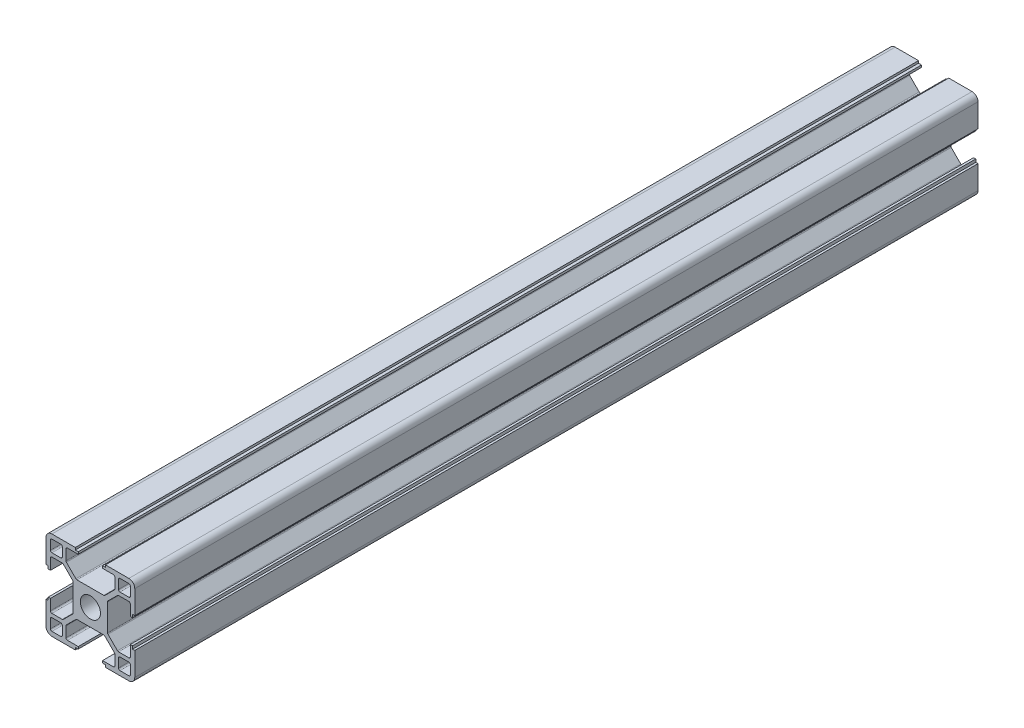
ISO-10303-21;
HEADER;
FILE_DESCRIPTION(('STEP AP214'),'2;1');
FILE_NAME('part.step','',(''),(''),'','','');
FILE_SCHEMA(('AUTOMOTIVE_DESIGN { 1 0 10303 214 1 1 1 1 }'));
ENDSEC;
DATA;
#1=APPLICATION_CONTEXT('core data for automotive mechanical design processes');
#2=APPLICATION_PROTOCOL_DEFINITION('international standard','automotive_design',2000,#1);
#3=PRODUCT_CONTEXT('',#1,'mechanical');
#4=PRODUCT('Part','Part','',(#3));
#5=PRODUCT_RELATED_PRODUCT_CATEGORY('part','',(#4));
#6=PRODUCT_DEFINITION_FORMATION('','',#4);
#7=PRODUCT_DEFINITION_CONTEXT('part definition',#1,'design');
#8=PRODUCT_DEFINITION('design','',#6,#7);
#9=PRODUCT_DEFINITION_SHAPE('','',#8);
#10=(LENGTH_UNIT() NAMED_UNIT(*) SI_UNIT(.MILLI.,.METRE.));
#11=(NAMED_UNIT(*) PLANE_ANGLE_UNIT() SI_UNIT($,.RADIAN.));
#12=(NAMED_UNIT(*) SI_UNIT($,.STERADIAN.) SOLID_ANGLE_UNIT());
#13=UNCERTAINTY_MEASURE_WITH_UNIT(LENGTH_MEASURE(1.E-05),#10,'distance_accuracy_value','');
#14=(GEOMETRIC_REPRESENTATION_CONTEXT(3) GLOBAL_UNCERTAINTY_ASSIGNED_CONTEXT((#13)) GLOBAL_UNIT_ASSIGNED_CONTEXT((#10,
#11,#12)) REPRESENTATION_CONTEXT('',''));
#15=CARTESIAN_POINT('',(0.,0.,0.));
#16=DIRECTION('',(0.,0.,1.));
#17=DIRECTION('',(1.,0.,0.));
#18=AXIS2_PLACEMENT_3D('',#15,#16,#17);
#19=CARTESIAN_POINT('',(19.0797659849,0.689378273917,0.));
#20=DIRECTION('',(0.,-1.,0.));
#21=DIRECTION('',(1.,0.,0.));
#22=AXIS2_PLACEMENT_3D('',#19,#20,#21);
#23=PLANE('',#22);
#24=DIRECTION('',(0.,0.,-1.));
#25=VECTOR('',#24,1.);
#26=CARTESIAN_POINT('',(10.8797659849,0.689378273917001,0.));
#27=LINE('',#26,#25);
#28=CARTESIAN_POINT('',(10.8797659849,0.689378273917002,115.));
#29=VERTEX_POINT('',#28);
#30=CARTESIAN_POINT('',(10.8797659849,0.689378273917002,-170.));
#31=VERTEX_POINT('',#30);
#32=EDGE_CURVE('E1319',#29,#31,#27,.T.);
#33=ORIENTED_EDGE('',*,*,#32,.F.);
#34=DIRECTION('',(1.,0.,0.));
#35=VECTOR('',#34,1.);
#36=CARTESIAN_POINT('',(9.87976598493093,0.689378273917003,115.));
#37=LINE('',#36,#35);
#38=CARTESIAN_POINT('',(9.87976598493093,0.689378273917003,115.));
#39=VERTEX_POINT('',#38);
#40=EDGE_CURVE('E1902',#39,#29,#37,.T.);
#41=ORIENTED_EDGE('',*,*,#40,.F.);
#42=DIRECTION('',(0.,0.,1.));
#43=VECTOR('',#42,1.);
#44=CARTESIAN_POINT('',(9.87976598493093,0.689378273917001,0.));
#45=LINE('',#44,#43);
#46=CARTESIAN_POINT('',(9.87976598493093,0.689378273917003,-170.));
#47=VERTEX_POINT('',#46);
#48=EDGE_CURVE('E1324',#47,#39,#45,.T.);
#49=ORIENTED_EDGE('',*,*,#48,.F.);
#50=DIRECTION('',(1.,0.,0.));
#51=VECTOR('',#50,1.);
#52=CARTESIAN_POINT('',(19.0797659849,0.689378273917,-170.));
#53=LINE('',#52,#51);
#54=EDGE_CURVE('E44',#47,#31,#53,.T.);
#55=ORIENTED_EDGE('',*,*,#54,.T.);
#56=EDGE_LOOP('',(#33,#41,#49,#55));
#57=FACE_BOUND('',#56,.T.);
#58=ADVANCED_FACE('F41',(#57),#23,.T.);
#59=CARTESIAN_POINT('',(19.0797659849,0.689378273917,0.));
#60=DIRECTION('',(0.,-1.,0.));
#61=DIRECTION('',(1.,0.,0.));
#62=AXIS2_PLACEMENT_3D('',#59,#60,#61);
#63=PLANE('',#62);
#64=DIRECTION('',(0.,0.,1.));
#65=VECTOR('',#64,1.);
#66=CARTESIAN_POINT('',(20.0797659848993,0.689378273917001,0.));
#67=LINE('',#66,#65);
#68=CARTESIAN_POINT('',(20.0797659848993,0.689378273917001,115.));
#69=VERTEX_POINT('',#68);
#70=CARTESIAN_POINT('',(20.0797659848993,0.689378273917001,-170.));
#71=VERTEX_POINT('',#70);
#72=EDGE_CURVE('E1310',#69,#71,#67,.F.);
#73=ORIENTED_EDGE('',*,*,#72,.F.);
#74=DIRECTION('',(1.,0.,0.));
#75=VECTOR('',#74,1.);
#76=CARTESIAN_POINT('',(19.0797659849,0.689378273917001,115.));
#77=LINE('',#76,#75);
#78=CARTESIAN_POINT('',(19.0797659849,0.689378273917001,115.));
#79=VERTEX_POINT('',#78);
#80=EDGE_CURVE('E1934',#79,#69,#77,.T.);
#81=ORIENTED_EDGE('',*,*,#80,.F.);
#82=DIRECTION('',(0.,0.,1.));
#83=VECTOR('',#82,1.);
#84=CARTESIAN_POINT('',(19.0797659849,0.689378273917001,0.));
#85=LINE('',#84,#83);
#86=CARTESIAN_POINT('',(19.0797659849,0.689378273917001,-170.));
#87=VERTEX_POINT('',#86);
#88=EDGE_CURVE('E1314',#87,#79,#85,.T.);
#89=ORIENTED_EDGE('',*,*,#88,.F.);
#90=DIRECTION('',(1.,0.,0.));
#91=VECTOR('',#90,1.);
#92=CARTESIAN_POINT('',(19.0797659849,0.689378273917,-170.));
#93=LINE('',#92,#91);
#94=EDGE_CURVE('E1751',#87,#71,#93,.T.);
#95=ORIENTED_EDGE('',*,*,#94,.T.);
#96=EDGE_LOOP('',(#73,#81,#89,#95));
#97=FACE_BOUND('',#96,.T.);
#98=ADVANCED_FACE('F2178',(#97),#63,.T.);
#99=CARTESIAN_POINT('',(29.2297659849,19.0393782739,0.));
#100=DIRECTION('',(1.,0.,0.));
#101=DIRECTION('',(0.,0.,-1.));
#102=AXIS2_PLACEMENT_3D('',#99,#100,#101);
#103=PLANE('',#102);
#104=DIRECTION('',(0.,0.,1.));
#105=VECTOR('',#104,1.);
#106=CARTESIAN_POINT('',(29.2297659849,10.8393782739,0.));
#107=LINE('',#106,#105);
#108=CARTESIAN_POINT('',(29.2297659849,10.8393782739,115.));
#109=VERTEX_POINT('',#108);
#110=CARTESIAN_POINT('',(29.2297659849,10.8393782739,-170.));
#111=VERTEX_POINT('',#110);
#112=EDGE_CURVE('E1300',#109,#111,#107,.F.);
#113=ORIENTED_EDGE('',*,*,#112,.F.);
#114=DIRECTION('',(0.,1.,0.));
#115=VECTOR('',#114,1.);
#116=CARTESIAN_POINT('',(29.2297659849,9.83937827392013,115.));
#117=LINE('',#116,#115);
#118=CARTESIAN_POINT('',(29.2297659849,9.83937827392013,115.));
#119=VERTEX_POINT('',#118);
#120=EDGE_CURVE('E1946',#119,#109,#117,.T.);
#121=ORIENTED_EDGE('',*,*,#120,.F.);
#122=DIRECTION('',(0.,0.,1.));
#123=VECTOR('',#122,1.);
#124=CARTESIAN_POINT('',(29.2297659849,9.83937827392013,0.));
#125=LINE('',#124,#123);
#126=CARTESIAN_POINT('',(29.2297659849,9.83937827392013,-170.));
#127=VERTEX_POINT('',#126);
#128=EDGE_CURVE('E1305',#127,#119,#125,.T.);
#129=ORIENTED_EDGE('',*,*,#128,.F.);
#130=DIRECTION('',(0.,1.,0.));
#131=VECTOR('',#130,1.);
#132=CARTESIAN_POINT('',(29.2297659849,19.0393782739,-170.));
#133=LINE('',#132,#131);
#134=EDGE_CURVE('E1748',#127,#111,#133,.T.);
#135=ORIENTED_EDGE('',*,*,#134,.T.);
#136=EDGE_LOOP('',(#113,#121,#129,#135));
#137=FACE_BOUND('',#136,.T.);
#138=ADVANCED_FACE('F2199',(#137),#103,.T.);
#139=CARTESIAN_POINT('',(29.2297659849,19.0393782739,0.));
#140=DIRECTION('',(1.,0.,0.));
#141=DIRECTION('',(0.,0.,-1.));
#142=AXIS2_PLACEMENT_3D('',#139,#140,#141);
#143=PLANE('',#142);
#144=DIRECTION('',(0.,0.,1.));
#145=VECTOR('',#144,1.);
#146=CARTESIAN_POINT('',(29.2297659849,20.0393782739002,0.));
#147=LINE('',#146,#145);
#148=CARTESIAN_POINT('',(29.2297659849,20.0393782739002,115.));
#149=VERTEX_POINT('',#148);
#150=CARTESIAN_POINT('',(29.2297659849,20.0393782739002,-170.));
#151=VERTEX_POINT('',#150);
#152=EDGE_CURVE('E1291',#149,#151,#147,.F.);
#153=ORIENTED_EDGE('',*,*,#152,.F.);
#154=DIRECTION('',(0.,1.,0.));
#155=VECTOR('',#154,1.);
#156=CARTESIAN_POINT('',(29.2297659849,19.0393782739,115.));
#157=LINE('',#156,#155);
#158=CARTESIAN_POINT('',(29.2297659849,19.0393782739,115.));
#159=VERTEX_POINT('',#158);
#160=EDGE_CURVE('E1978',#159,#149,#157,.T.);
#161=ORIENTED_EDGE('',*,*,#160,.F.);
#162=DIRECTION('',(0.,0.,-1.));
#163=VECTOR('',#162,1.);
#164=CARTESIAN_POINT('',(29.2297659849,19.0393782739,0.));
#165=LINE('',#164,#163);
#166=CARTESIAN_POINT('',(29.2297659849,19.0393782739,-170.));
#167=VERTEX_POINT('',#166);
#168=EDGE_CURVE('E1295',#167,#159,#165,.F.);
#169=ORIENTED_EDGE('',*,*,#168,.F.);
#170=DIRECTION('',(0.,1.,0.));
#171=VECTOR('',#170,1.);
#172=CARTESIAN_POINT('',(29.2297659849,19.0393782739,-170.));
#173=LINE('',#172,#171);
#174=EDGE_CURVE('E1744',#167,#151,#173,.T.);
#175=ORIENTED_EDGE('',*,*,#174,.T.);
#176=EDGE_LOOP('',(#153,#161,#169,#175));
#177=FACE_BOUND('',#176,.T.);
#178=ADVANCED_FACE('F2278',(#177),#143,.T.);
#179=CARTESIAN_POINT('',(10.8797659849,29.1893782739,0.));
#180=DIRECTION('',(0.,1.,0.));
#181=DIRECTION('',(0.,0.,1.));
#182=AXIS2_PLACEMENT_3D('',#179,#180,#181);
#183=PLANE('',#182);
#184=DIRECTION('',(0.,0.,1.));
#185=VECTOR('',#184,1.);
#186=CARTESIAN_POINT('',(19.0797659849,29.1893782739,0.));
#187=LINE('',#186,#185);
#188=CARTESIAN_POINT('',(19.0797659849,29.1893782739,115.));
#189=VERTEX_POINT('',#188);
#190=CARTESIAN_POINT('',(19.0797659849,29.1893782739,-170.));
#191=VERTEX_POINT('',#190);
#192=EDGE_CURVE('E1281',#189,#191,#187,.F.);
#193=ORIENTED_EDGE('',*,*,#192,.F.);
#194=DIRECTION('',(-1.,0.,0.));
#195=VECTOR('',#194,1.);
#196=CARTESIAN_POINT('',(20.0797659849,29.1893782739,115.));
#197=LINE('',#196,#195);
#198=CARTESIAN_POINT('',(20.0797659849,29.1893782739,115.));
#199=VERTEX_POINT('',#198);
#200=EDGE_CURVE('E1990',#199,#189,#197,.T.);
#201=ORIENTED_EDGE('',*,*,#200,.F.);
#202=DIRECTION('',(0.,0.,1.));
#203=VECTOR('',#202,1.);
#204=CARTESIAN_POINT('',(20.0797659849,29.1893782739,0.));
#205=LINE('',#204,#203);
#206=CARTESIAN_POINT('',(20.0797659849,29.1893782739,-170.));
#207=VERTEX_POINT('',#206);
#208=EDGE_CURVE('E1286',#207,#199,#205,.T.);
#209=ORIENTED_EDGE('',*,*,#208,.F.);
#210=DIRECTION('',(1.,0.,0.));
#211=VECTOR('',#210,1.);
#212=CARTESIAN_POINT('',(10.8797659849,29.1893782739,-170.));
#213=LINE('',#212,#211);
#214=EDGE_CURVE('E1740',#207,#191,#213,.F.);
#215=ORIENTED_EDGE('',*,*,#214,.T.);
#216=EDGE_LOOP('',(#193,#201,#209,#215));
#217=FACE_BOUND('',#216,.T.);
#218=ADVANCED_FACE('F2307',(#217),#183,.T.);
#219=CARTESIAN_POINT('',(10.8797659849,29.1893782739,0.));
#220=DIRECTION('',(0.,1.,0.));
#221=DIRECTION('',(0.,0.,1.));
#222=AXIS2_PLACEMENT_3D('',#219,#220,#221);
#223=PLANE('',#222);
#224=DIRECTION('',(0.,0.,1.));
#225=VECTOR('',#224,1.);
#226=CARTESIAN_POINT('',(9.87976598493,29.1893782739,0.));
#227=LINE('',#226,#225);
#228=CARTESIAN_POINT('',(9.87976598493,29.1893782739,115.));
#229=VERTEX_POINT('',#228);
#230=CARTESIAN_POINT('',(9.87976598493,29.1893782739,-170.));
#231=VERTEX_POINT('',#230);
#232=EDGE_CURVE('E1272',#229,#231,#227,.F.);
#233=ORIENTED_EDGE('',*,*,#232,.F.);
#234=DIRECTION('',(-1.,0.,0.));
#235=VECTOR('',#234,1.);
#236=CARTESIAN_POINT('',(10.8797659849,29.1893782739,115.));
#237=LINE('',#236,#235);
#238=CARTESIAN_POINT('',(10.8797659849,29.1893782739,115.));
#239=VERTEX_POINT('',#238);
#240=EDGE_CURVE('E2022',#239,#229,#237,.T.);
#241=ORIENTED_EDGE('',*,*,#240,.F.);
#242=DIRECTION('',(0.,0.,-1.));
#243=VECTOR('',#242,1.);
#244=CARTESIAN_POINT('',(10.8797659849,29.1893782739,0.));
#245=LINE('',#244,#243);
#246=CARTESIAN_POINT('',(10.8797659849,29.1893782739,-170.));
#247=VERTEX_POINT('',#246);
#248=EDGE_CURVE('E1276',#247,#239,#245,.F.);
#249=ORIENTED_EDGE('',*,*,#248,.F.);
#250=DIRECTION('',(1.,0.,0.));
#251=VECTOR('',#250,1.);
#252=CARTESIAN_POINT('',(10.8797659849,29.1893782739,-170.));
#253=LINE('',#252,#251);
#254=EDGE_CURVE('E1736',#247,#231,#253,.F.);
#255=ORIENTED_EDGE('',*,*,#254,.T.);
#256=EDGE_LOOP('',(#233,#241,#249,#255));
#257=FACE_BOUND('',#256,.T.);
#258=ADVANCED_FACE('F2384',(#257),#223,.T.);
#259=CARTESIAN_POINT('',(0.729765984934,10.8393782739,0.));
#260=DIRECTION('',(-1.,0.,0.));
#261=DIRECTION('',(0.,0.,1.));
#262=AXIS2_PLACEMENT_3D('',#259,#260,#261);
#263=PLANE('',#262);
#264=DIRECTION('',(0.,0.,-1.));
#265=VECTOR('',#264,1.);
#266=CARTESIAN_POINT('',(0.729765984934,19.0393782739,0.));
#267=LINE('',#266,#265);
#268=CARTESIAN_POINT('',(0.729765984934,19.0393782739,115.));
#269=VERTEX_POINT('',#268);
#270=CARTESIAN_POINT('',(0.729765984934,19.0393782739,-170.));
#271=VERTEX_POINT('',#270);
#272=EDGE_CURVE('E1262',#269,#271,#267,.T.);
#273=ORIENTED_EDGE('',*,*,#272,.F.);
#274=DIRECTION('',(0.,-1.,0.));
#275=VECTOR('',#274,1.);
#276=CARTESIAN_POINT('',(0.729765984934,20.0393782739,115.));
#277=LINE('',#276,#275);
#278=CARTESIAN_POINT('',(0.729765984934,20.0393782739,115.));
#279=VERTEX_POINT('',#278);
#280=EDGE_CURVE('E2034',#279,#269,#277,.T.);
#281=ORIENTED_EDGE('',*,*,#280,.F.);
#282=DIRECTION('',(0.,0.,1.));
#283=VECTOR('',#282,1.);
#284=CARTESIAN_POINT('',(0.729765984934,20.0393782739,0.));
#285=LINE('',#284,#283);
#286=CARTESIAN_POINT('',(0.729765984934,20.0393782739,-170.));
#287=VERTEX_POINT('',#286);
#288=EDGE_CURVE('E1267',#287,#279,#285,.T.);
#289=ORIENTED_EDGE('',*,*,#288,.F.);
#290=DIRECTION('',(0.,1.,0.));
#291=VECTOR('',#290,1.);
#292=CARTESIAN_POINT('',(0.729765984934,10.8393782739,-170.));
#293=LINE('',#292,#291);
#294=EDGE_CURVE('E1732',#287,#271,#293,.F.);
#295=ORIENTED_EDGE('',*,*,#294,.T.);
#296=EDGE_LOOP('',(#273,#281,#289,#295));
#297=FACE_BOUND('',#296,.T.);
#298=ADVANCED_FACE('F2413',(#297),#263,.T.);
#299=CARTESIAN_POINT('',(0.729765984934,10.8393782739,0.));
#300=DIRECTION('',(-1.,0.,0.));
#301=DIRECTION('',(0.,0.,1.));
#302=AXIS2_PLACEMENT_3D('',#299,#300,#301);
#303=PLANE('',#302);
#304=DIRECTION('',(0.,0.,1.));
#305=VECTOR('',#304,1.);
#306=CARTESIAN_POINT('',(0.729765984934,9.83937827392,0.));
#307=LINE('',#306,#305);
#308=CARTESIAN_POINT('',(0.729765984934,9.83937827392,115.));
#309=VERTEX_POINT('',#308);
#310=CARTESIAN_POINT('',(0.729765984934,9.83937827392,-170.));
#311=VERTEX_POINT('',#310);
#312=EDGE_CURVE('E1252',#309,#311,#307,.F.);
#313=ORIENTED_EDGE('',*,*,#312,.F.);
#314=DIRECTION('',(0.,-1.,0.));
#315=VECTOR('',#314,1.);
#316=CARTESIAN_POINT('',(0.729765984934,10.8393782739,115.));
#317=LINE('',#316,#315);
#318=CARTESIAN_POINT('',(0.729765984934,10.8393782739,115.));
#319=VERTEX_POINT('',#318);
#320=EDGE_CURVE('E1760',#319,#309,#317,.T.);
#321=ORIENTED_EDGE('',*,*,#320,.F.);
#322=DIRECTION('',(0.,0.,1.));
#323=VECTOR('',#322,1.);
#324=CARTESIAN_POINT('',(0.729765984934,10.8393782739,0.));
#325=LINE('',#324,#323);
#326=CARTESIAN_POINT('',(0.729765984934,10.8393782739,-170.));
#327=VERTEX_POINT('',#326);
#328=EDGE_CURVE('E1257',#327,#319,#325,.T.);
#329=ORIENTED_EDGE('',*,*,#328,.F.);
#330=DIRECTION('',(0.,1.,0.));
#331=VECTOR('',#330,1.);
#332=CARTESIAN_POINT('',(0.729765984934,10.8393782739,-170.));
#333=LINE('',#332,#331);
#334=EDGE_CURVE('E1327',#327,#311,#333,.F.);
#335=ORIENTED_EDGE('',*,*,#334,.T.);
#336=EDGE_LOOP('',(#313,#321,#329,#335));
#337=FACE_BOUND('',#336,.T.);
#338=ADVANCED_FACE('F2080',(#337),#303,.T.);
#339=CARTESIAN_POINT('',(9.87976598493,29.1893782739,0.));
#340=DIRECTION('',(1.,0.,0.));
#341=DIRECTION('',(0.,1.,0.));
#342=AXIS2_PLACEMENT_3D('',#339,#340,#341);
#343=PLANE('',#342);
#344=ORIENTED_EDGE('',*,*,#48,.T.);
#345=DIRECTION('',(-2.52733019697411E-10,1.,0.));
#346=VECTOR('',#345,1.);
#347=CARTESIAN_POINT('',(9.87976598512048,-0.0606217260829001,115.));
#348=LINE('',#347,#346);
#349=CARTESIAN_POINT('',(9.87976598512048,-0.0606217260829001,115.));
#350=VERTEX_POINT('',#349);
#351=EDGE_CURVE('E1900',#350,#39,#348,.T.);
#352=ORIENTED_EDGE('',*,*,#351,.F.);
#353=DIRECTION('',(0.,0.,-1.));
#354=VECTOR('',#353,1.);
#355=CARTESIAN_POINT('',(9.87976598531,-0.0606217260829,0.));
#356=LINE('',#355,#354);
#357=CARTESIAN_POINT('',(9.87976598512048,-0.0606217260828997,-170.));
#358=VERTEX_POINT('',#357);
#359=EDGE_CURVE('E1245',#358,#350,#356,.F.);
#360=ORIENTED_EDGE('',*,*,#359,.F.);
#361=DIRECTION('',(0.,1.,0.));
#362=VECTOR('',#361,1.);
#363=CARTESIAN_POINT('',(9.87976598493,29.1893782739,-170.));
#364=LINE('',#363,#362);
#365=EDGE_CURVE('E1323',#358,#47,#364,.T.);
#366=ORIENTED_EDGE('',*,*,#365,.T.);
#367=EDGE_LOOP('',(#344,#352,#360,#366));
#368=FACE_BOUND('',#367,.T.);
#369=ADVANCED_FACE('F2098',(#368),#343,.T.);
#370=CARTESIAN_POINT('',(10.8797659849,28.4393782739,0.));
#371=DIRECTION('',(1.,0.,0.));
#372=DIRECTION('',(0.,0.,-1.));
#373=AXIS2_PLACEMENT_3D('',#370,#371,#372);
#374=PLANE('',#373);
#375=DIRECTION('',(0.,0.,-1.));
#376=VECTOR('',#375,1.);
#377=CARTESIAN_POINT('',(10.8797659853,1.43937827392,0.));
#378=LINE('',#377,#376);
#379=CARTESIAN_POINT('',(10.8797659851,1.43937827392,-170.));
#380=VERTEX_POINT('',#379);
#381=CARTESIAN_POINT('',(10.8797659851,1.43937827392,115.));
#382=VERTEX_POINT('',#381);
#383=EDGE_CURVE('E1241',#380,#382,#378,.F.);
#384=ORIENTED_EDGE('',*,*,#383,.T.);
#385=DIRECTION('',(2.66666318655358E-10,1.,0.));
#386=VECTOR('',#385,1.);
#387=CARTESIAN_POINT('',(10.8797659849,0.689378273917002,115.));
#388=LINE('',#387,#386);
#389=EDGE_CURVE('E1904',#29,#382,#388,.T.);
#390=ORIENTED_EDGE('',*,*,#389,.F.);
#391=ORIENTED_EDGE('',*,*,#32,.T.);
#392=DIRECTION('',(0.,1.,0.));
#393=VECTOR('',#392,1.);
#394=CARTESIAN_POINT('',(10.8797659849,28.4393782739,-170.));
#395=LINE('',#394,#393);
#396=EDGE_CURVE('E1322',#31,#380,#395,.T.);
#397=ORIENTED_EDGE('',*,*,#396,.T.);
#398=EDGE_LOOP('',(#384,#390,#391,#397));
#399=FACE_BOUND('',#398,.T.);
#400=ADVANCED_FACE('F2102',(#399),#374,.T.);
#401=CARTESIAN_POINT('',(7.22976598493,1.93937827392,0.));
#402=DIRECTION('',(0.,0.,1.));
#403=DIRECTION('',(1.,0.,0.));
#404=AXIS2_PLACEMENT_3D('',#401,#402,#403);
#405=CYLINDRICAL_SURFACE('',#404,0.5);
#406=CARTESIAN_POINT('',(7.22976598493,1.93937827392,115.));
#407=DIRECTION('',(0.,0.,-1.));
#408=DIRECTION('',(1.,0.,0.));
#409=AXIS2_PLACEMENT_3D('',#406,#407,#408);
#410=CIRCLE('',#409,0.500000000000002);
#411=CARTESIAN_POINT('',(7.22976598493,1.43937827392,115.));
#412=VERTEX_POINT('',#411);
#413=CARTESIAN_POINT('',(6.72976598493,1.93937827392,115.));
#414=VERTEX_POINT('',#413);
#415=EDGE_CURVE('E1908',#412,#414,#410,.T.);
#416=ORIENTED_EDGE('',*,*,#415,.F.);
#417=DIRECTION('',(0.,0.,-1.));
#418=VECTOR('',#417,1.);
#419=CARTESIAN_POINT('',(7.22976598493,1.43937827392,0.));
#420=LINE('',#419,#418);
#421=CARTESIAN_POINT('',(7.22976598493,1.43937827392,-170.));
#422=VERTEX_POINT('',#421);
#423=EDGE_CURVE('E1238',#412,#422,#420,.T.);
#424=ORIENTED_EDGE('',*,*,#423,.T.);
#425=CARTESIAN_POINT('',(7.22976598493,1.93937827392,-170.));
#426=DIRECTION('',(0.,0.,1.));
#427=DIRECTION('',(1.,0.,0.));
#428=AXIS2_PLACEMENT_3D('',#425,#426,#427);
#429=CIRCLE('',#428,0.5);
#430=CARTESIAN_POINT('',(6.72976598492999,1.93937827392,-170.));
#431=VERTEX_POINT('',#430);
#432=EDGE_CURVE('E1720',#431,#422,#429,.T.);
#433=ORIENTED_EDGE('',*,*,#432,.F.);
#434=DIRECTION('',(0.,0.,1.));
#435=VECTOR('',#434,1.);
#436=CARTESIAN_POINT('',(6.72976598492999,1.93937827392,0.));
#437=LINE('',#436,#435);
#438=EDGE_CURVE('E1231',#414,#431,#437,.F.);
#439=ORIENTED_EDGE('',*,*,#438,.F.);
#440=EDGE_LOOP('',(#416,#424,#433,#439));
#441=FACE_BOUND('',#440,.T.);
#442=ADVANCED_FACE('F2113',(#441),#405,.F.);
#443=CARTESIAN_POINT('',(7.22976598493,5.42161132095,0.));
#444=DIRECTION('',(0.,0.,1.));
#445=DIRECTION('',(1.,0.,0.));
#446=AXIS2_PLACEMENT_3D('',#443,#444,#445);
#447=CYLINDRICAL_SURFACE('',#446,0.5);
#448=CARTESIAN_POINT('',(7.22976598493,5.42161132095,115.));
#449=DIRECTION('',(0.,0.,-1.));
#450=DIRECTION('',(1.,0.,0.));
#451=AXIS2_PLACEMENT_3D('',#448,#449,#450);
#452=CIRCLE('',#451,0.499999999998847);
#453=CARTESIAN_POINT('',(6.72976598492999,5.421611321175,115.));
#454=VERTEX_POINT('',#453);
#455=CARTESIAN_POINT('',(6.87621259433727,5.77516471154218,115.));
#456=VERTEX_POINT('',#455);
#457=EDGE_CURVE('E1912',#454,#456,#452,.T.);
#458=ORIENTED_EDGE('',*,*,#457,.F.);
#459=DIRECTION('',(0.,0.,1.));
#460=VECTOR('',#459,1.);
#461=CARTESIAN_POINT('',(6.72976598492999,5.4216113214,0.));
#462=LINE('',#461,#460);
#463=CARTESIAN_POINT('',(6.72976598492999,5.421611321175,-170.));
#464=VERTEX_POINT('',#463);
#465=EDGE_CURVE('E1234',#464,#454,#462,.T.);
#466=ORIENTED_EDGE('',*,*,#465,.F.);
#467=CARTESIAN_POINT('',(7.22976598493,5.42161132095,-170.));
#468=DIRECTION('',(0.,0.,1.));
#469=DIRECTION('',(1.,0.,0.));
#470=AXIS2_PLACEMENT_3D('',#467,#468,#469);
#471=CIRCLE('',#470,0.5);
#472=CARTESIAN_POINT('',(6.87621259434,5.77516471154,-170.));
#473=VERTEX_POINT('',#472);
#474=EDGE_CURVE('E1717',#473,#464,#471,.T.);
#475=ORIENTED_EDGE('',*,*,#474,.F.);
#476=DIRECTION('',(0.,0.,1.));
#477=VECTOR('',#476,1.);
#478=CARTESIAN_POINT('',(6.87621259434,5.77516471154,0.));
#479=LINE('',#478,#477);
#480=EDGE_CURVE('E1224',#456,#473,#479,.F.);
#481=ORIENTED_EDGE('',*,*,#480,.F.);
#482=EDGE_LOOP('',(#458,#466,#475,#481));
#483=FACE_BOUND('',#482,.T.);
#484=ADVANCED_FACE('F2121',(#483),#447,.F.);
#485=CARTESIAN_POINT('',(10.4475329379,8.63937827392,0.));
#486=DIRECTION('',(0.,0.,1.));
#487=DIRECTION('',(1.,0.,0.));
#488=AXIS2_PLACEMENT_3D('',#485,#486,#487);
#489=CYLINDRICAL_SURFACE('',#488,0.5);
#490=CARTESIAN_POINT('',(10.4475329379,8.63937827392,115.));
#491=DIRECTION('',(0.,0.,-1.));
#492=DIRECTION('',(1.,0.,0.));
#493=AXIS2_PLACEMENT_3D('',#490,#491,#492);
#494=CIRCLE('',#493,0.499999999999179);
#495=CARTESIAN_POINT('',(10.0939795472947,8.99293166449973,115.));
#496=VERTEX_POINT('',#495);
#497=CARTESIAN_POINT('',(10.4475329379,9.13937827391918,115.));
#498=VERTEX_POINT('',#497);
#499=EDGE_CURVE('E1916',#496,#498,#494,.T.);
#500=ORIENTED_EDGE('',*,*,#499,.F.);
#501=DIRECTION('',(0.,0.,1.));
#502=VECTOR('',#501,1.);
#503=CARTESIAN_POINT('',(10.093979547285,8.992931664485,0.));
#504=LINE('',#503,#502);
#505=CARTESIAN_POINT('',(10.0939795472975,8.9929316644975,-170.));
#506=VERTEX_POINT('',#505);
#507=EDGE_CURVE('E1227',#506,#496,#504,.T.);
#508=ORIENTED_EDGE('',*,*,#507,.F.);
#509=CARTESIAN_POINT('',(10.4475329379,8.63937827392,-170.));
#510=DIRECTION('',(0.,0.,1.));
#511=DIRECTION('',(1.,0.,0.));
#512=AXIS2_PLACEMENT_3D('',#509,#510,#511);
#513=CIRCLE('',#512,0.5);
#514=CARTESIAN_POINT('',(10.4475329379,9.13937827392,-170.));
#515=VERTEX_POINT('',#514);
#516=EDGE_CURVE('E1714',#515,#506,#513,.T.);
#517=ORIENTED_EDGE('',*,*,#516,.F.);
#518=DIRECTION('',(0.,0.,1.));
#519=VECTOR('',#518,1.);
#520=CARTESIAN_POINT('',(10.4475329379,9.13937827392,0.));
#521=LINE('',#520,#519);
#522=EDGE_CURVE('E1217',#498,#515,#521,.F.);
#523=ORIENTED_EDGE('',*,*,#522,.F.);
#524=EDGE_LOOP('',(#500,#508,#517,#523));
#525=FACE_BOUND('',#524,.T.);
#526=ADVANCED_FACE('F2131',(#525),#489,.F.);
#527=CARTESIAN_POINT('',(19.511999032,8.63937827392,0.));
#528=DIRECTION('',(0.,0.,1.));
#529=DIRECTION('',(1.,0.,0.));
#530=AXIS2_PLACEMENT_3D('',#527,#528,#529);
#531=CYLINDRICAL_SURFACE('',#530,0.5);
#532=CARTESIAN_POINT('',(19.511999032,8.63937827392,115.));
#533=DIRECTION('',(0.,0.,-1.));
#534=DIRECTION('',(1.,0.,0.));
#535=AXIS2_PLACEMENT_3D('',#532,#533,#534);
#536=CIRCLE('',#535,0.499999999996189);
#537=CARTESIAN_POINT('',(19.51199903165,9.13937827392,115.));
#538=VERTEX_POINT('',#537);
#539=CARTESIAN_POINT('',(19.865552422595,8.99293166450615,115.));
#540=VERTEX_POINT('',#539);
#541=EDGE_CURVE('E1920',#538,#540,#536,.T.);
#542=ORIENTED_EDGE('',*,*,#541,.F.);
#543=DIRECTION('',(0.,0.,1.));
#544=VECTOR('',#543,1.);
#545=CARTESIAN_POINT('',(19.5119990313,9.13937827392,0.));
#546=LINE('',#545,#544);
#547=CARTESIAN_POINT('',(19.51199903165,9.13937827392,-170.));
#548=VERTEX_POINT('',#547);
#549=EDGE_CURVE('E1220',#548,#538,#546,.T.);
#550=ORIENTED_EDGE('',*,*,#549,.F.);
#551=CARTESIAN_POINT('',(19.511999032,8.63937827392,-170.));
#552=DIRECTION('',(0.,0.,1.));
#553=DIRECTION('',(1.,0.,0.));
#554=AXIS2_PLACEMENT_3D('',#551,#552,#553);
#555=CIRCLE('',#554,0.5);
#556=CARTESIAN_POINT('',(19.8655524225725,8.9929316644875,-170.));
#557=VERTEX_POINT('',#556);
#558=EDGE_CURVE('E1711',#557,#548,#555,.T.);
#559=ORIENTED_EDGE('',*,*,#558,.F.);
#560=DIRECTION('',(0.,0.,1.));
#561=VECTOR('',#560,1.);
#562=CARTESIAN_POINT('',(19.865552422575,8.992931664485,0.));
#563=LINE('',#562,#561);
#564=EDGE_CURVE('E1210',#540,#557,#563,.F.);
#565=ORIENTED_EDGE('',*,*,#564,.F.);
#566=EDGE_LOOP('',(#542,#550,#559,#565));
#567=FACE_BOUND('',#566,.T.);
#568=ADVANCED_FACE('F2141',(#567),#531,.F.);
#569=CARTESIAN_POINT('',(22.7297659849,5.42161132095,0.));
#570=DIRECTION('',(0.,0.,1.));
#571=DIRECTION('',(1.,0.,0.));
#572=AXIS2_PLACEMENT_3D('',#569,#570,#571);
#573=CYLINDRICAL_SURFACE('',#572,0.5);
#574=CARTESIAN_POINT('',(22.7297659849,5.42161132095,115.));
#575=DIRECTION('',(0.,0.,-1.));
#576=DIRECTION('',(1.,0.,0.));
#577=AXIS2_PLACEMENT_3D('',#574,#575,#576);
#578=CIRCLE('',#577,0.500000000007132);
#579=CARTESIAN_POINT('',(23.0833193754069,5.77516471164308,115.));
#580=VERTEX_POINT('',#579);
#581=CARTESIAN_POINT('',(23.2297659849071,5.42161132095,115.));
#582=VERTEX_POINT('',#581);
#583=EDGE_CURVE('E1924',#580,#582,#578,.T.);
#584=ORIENTED_EDGE('',*,*,#583,.F.);
#585=DIRECTION('',(0.,0.,1.));
#586=VECTOR('',#585,1.);
#587=CARTESIAN_POINT('',(23.083319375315,5.775164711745,0.));
#588=LINE('',#587,#586);
#589=CARTESIAN_POINT('',(23.08331937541,5.77516471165,-170.));
#590=VERTEX_POINT('',#589);
#591=EDGE_CURVE('E1213',#590,#580,#588,.T.);
#592=ORIENTED_EDGE('',*,*,#591,.F.);
#593=CARTESIAN_POINT('',(22.7297659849,5.42161132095,-170.));
#594=DIRECTION('',(0.,0.,1.));
#595=DIRECTION('',(1.,0.,0.));
#596=AXIS2_PLACEMENT_3D('',#593,#594,#595);
#597=CIRCLE('',#596,0.5);
#598=CARTESIAN_POINT('',(23.2297659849,5.42161132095,-170.));
#599=VERTEX_POINT('',#598);
#600=EDGE_CURVE('E1708',#599,#590,#597,.T.);
#601=ORIENTED_EDGE('',*,*,#600,.F.);
#602=DIRECTION('',(0.,0.,1.));
#603=VECTOR('',#602,1.);
#604=CARTESIAN_POINT('',(23.2297659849,5.42161132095,0.));
#605=LINE('',#604,#603);
#606=EDGE_CURVE('E1203',#582,#599,#605,.F.);
#607=ORIENTED_EDGE('',*,*,#606,.F.);
#608=EDGE_LOOP('',(#584,#592,#601,#607));
#609=FACE_BOUND('',#608,.T.);
#610=ADVANCED_FACE('F2151',(#609),#573,.F.);
#611=CARTESIAN_POINT('',(22.7297659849,1.93937827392,0.));
#612=DIRECTION('',(0.,0.,1.));
#613=DIRECTION('',(1.,0.,0.));
#614=AXIS2_PLACEMENT_3D('',#611,#612,#613);
#615=CYLINDRICAL_SURFACE('',#614,0.5);
#616=CARTESIAN_POINT('',(22.7297659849,1.93937827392,115.));
#617=DIRECTION('',(0.,0.,-1.));
#618=DIRECTION('',(1.,0.,0.));
#619=AXIS2_PLACEMENT_3D('',#616,#617,#618);
#620=CIRCLE('',#619,0.499999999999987);
#621=CARTESIAN_POINT('',(23.2297659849,1.93937827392,115.));
#622=VERTEX_POINT('',#621);
#623=CARTESIAN_POINT('',(22.7297659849,1.43937827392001,115.));
#624=VERTEX_POINT('',#623);
#625=EDGE_CURVE('E1928',#622,#624,#620,.T.);
#626=ORIENTED_EDGE('',*,*,#625,.F.);
#627=DIRECTION('',(0.,0.,1.));
#628=VECTOR('',#627,1.);
#629=CARTESIAN_POINT('',(23.2297659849,1.93937827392,0.));
#630=LINE('',#629,#628);
#631=CARTESIAN_POINT('',(23.2297659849,1.93937827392,-170.));
#632=VERTEX_POINT('',#631);
#633=EDGE_CURVE('E1206',#632,#622,#630,.T.);
#634=ORIENTED_EDGE('',*,*,#633,.F.);
#635=CARTESIAN_POINT('',(22.7297659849,1.93937827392,-170.));
#636=DIRECTION('',(0.,0.,1.));
#637=DIRECTION('',(1.,0.,0.));
#638=AXIS2_PLACEMENT_3D('',#635,#636,#637);
#639=CIRCLE('',#638,0.5);
#640=CARTESIAN_POINT('',(22.7297659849,1.43937827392,-170.));
#641=VERTEX_POINT('',#640);
#642=EDGE_CURVE('E1318',#641,#632,#639,.T.);
#643=ORIENTED_EDGE('',*,*,#642,.F.);
#644=DIRECTION('',(0.,0.,-1.));
#645=VECTOR('',#644,1.);
#646=CARTESIAN_POINT('',(22.7297659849,1.43937827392,0.));
#647=LINE('',#646,#645);
#648=EDGE_CURVE('E1199',#641,#624,#647,.F.);
#649=ORIENTED_EDGE('',*,*,#648,.T.);
#650=EDGE_LOOP('',(#626,#634,#643,#649));
#651=FACE_BOUND('',#650,.T.);
#652=ADVANCED_FACE('F2160',(#651),#615,.F.);
#653=CARTESIAN_POINT('',(19.0797659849,29.1893782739,0.));
#654=DIRECTION('',(-1.,0.,0.));
#655=DIRECTION('',(0.,0.,1.));
#656=AXIS2_PLACEMENT_3D('',#653,#654,#655);
#657=PLANE('',#656);
#658=ORIENTED_EDGE('',*,*,#88,.T.);
#659=DIRECTION('',(0.,-1.,0.));
#660=VECTOR('',#659,1.);
#661=CARTESIAN_POINT('',(19.0797659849,1.43937827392,115.));
#662=LINE('',#661,#660);
#663=CARTESIAN_POINT('',(19.0797659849,1.43937827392,115.));
#664=VERTEX_POINT('',#663);
#665=EDGE_CURVE('E1932',#664,#79,#662,.T.);
#666=ORIENTED_EDGE('',*,*,#665,.F.);
#667=DIRECTION('',(0.,0.,-1.));
#668=VECTOR('',#667,1.);
#669=CARTESIAN_POINT('',(19.0797659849,1.43937827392,0.));
#670=LINE('',#669,#668);
#671=CARTESIAN_POINT('',(19.0797659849,1.43937827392,-170.));
#672=VERTEX_POINT('',#671);
#673=EDGE_CURVE('E1198',#664,#672,#670,.T.);
#674=ORIENTED_EDGE('',*,*,#673,.T.);
#675=DIRECTION('',(0.,1.,0.));
#676=VECTOR('',#675,1.);
#677=CARTESIAN_POINT('',(19.0797659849,29.1893782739,-170.));
#678=LINE('',#677,#676);
#679=EDGE_CURVE('E1313',#672,#87,#678,.F.);
#680=ORIENTED_EDGE('',*,*,#679,.T.);
#681=EDGE_LOOP('',(#658,#666,#674,#680));
#682=FACE_BOUND('',#681,.T.);
#683=ADVANCED_FACE('F2170',(#682),#657,.T.);
#684=CARTESIAN_POINT('',(20.0797659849,29.9393782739,0.));
#685=DIRECTION('',(-1.,0.,0.));
#686=DIRECTION('',(0.,-1.,0.));
#687=AXIS2_PLACEMENT_3D('',#684,#685,#686);
#688=PLANE('',#687);
#689=DIRECTION('',(0.,0.,-1.));
#690=VECTOR('',#689,1.);
#691=CARTESIAN_POINT('',(20.0797659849,-0.0606217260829,0.));
#692=LINE('',#691,#690);
#693=CARTESIAN_POINT('',(20.0797659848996,-0.0606217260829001,115.));
#694=VERTEX_POINT('',#693);
#695=CARTESIAN_POINT('',(20.0797659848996,-0.0606217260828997,-170.));
#696=VERTEX_POINT('',#695);
#697=EDGE_CURVE('E1195',#694,#696,#692,.T.);
#698=ORIENTED_EDGE('',*,*,#697,.F.);
#699=DIRECTION('',(4.53341068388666E-13,-1.,0.));
#700=VECTOR('',#699,1.);
#701=CARTESIAN_POINT('',(20.0797659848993,0.689378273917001,115.));
#702=LINE('',#701,#700);
#703=EDGE_CURVE('E1936',#69,#694,#702,.T.);
#704=ORIENTED_EDGE('',*,*,#703,.F.);
#705=ORIENTED_EDGE('',*,*,#72,.T.);
#706=DIRECTION('',(0.,-1.,0.));
#707=VECTOR('',#706,1.);
#708=CARTESIAN_POINT('',(20.0797659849,29.9393782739,-170.));
#709=LINE('',#708,#707);
#710=EDGE_CURVE('E1309',#71,#696,#709,.T.);
#711=ORIENTED_EDGE('',*,*,#710,.T.);
#712=EDGE_LOOP('',(#698,#704,#705,#711));
#713=FACE_BOUND('',#712,.T.);
#714=ADVANCED_FACE('F2175',(#713),#688,.T.);
#715=CARTESIAN_POINT('',(0.729765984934,9.83937827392,0.));
#716=DIRECTION('',(0.,1.,0.));
#717=DIRECTION('',(-1.,0.,0.));
#718=AXIS2_PLACEMENT_3D('',#715,#716,#717);
#719=PLANE('',#718);
#720=ORIENTED_EDGE('',*,*,#128,.T.);
#721=DIRECTION('',(-1.,-2.46585159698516E-10,0.));
#722=VECTOR('',#721,1.);
#723=CARTESIAN_POINT('',(29.9797659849,9.83937827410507,115.));
#724=LINE('',#723,#722);
#725=CARTESIAN_POINT('',(29.9797659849,9.83937827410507,115.));
#726=VERTEX_POINT('',#725);
#727=EDGE_CURVE('E1944',#726,#119,#724,.T.);
#728=ORIENTED_EDGE('',*,*,#727,.F.);
#729=DIRECTION('',(0.,0.,-1.));
#730=VECTOR('',#729,1.);
#731=CARTESIAN_POINT('',(29.9797659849,9.83937827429,0.));
#732=LINE('',#731,#730);
#733=CARTESIAN_POINT('',(29.9797659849,9.83937827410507,-170.));
#734=VERTEX_POINT('',#733);
#735=EDGE_CURVE('E1186',#734,#726,#732,.F.);
#736=ORIENTED_EDGE('',*,*,#735,.F.);
#737=DIRECTION('',(-1.,0.,0.));
#738=VECTOR('',#737,1.);
#739=CARTESIAN_POINT('',(0.729765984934,9.83937827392,-170.));
#740=LINE('',#739,#738);
#741=EDGE_CURVE('E1304',#734,#127,#740,.T.);
#742=ORIENTED_EDGE('',*,*,#741,.T.);
#743=EDGE_LOOP('',(#720,#728,#736,#742));
#744=FACE_BOUND('',#743,.T.);
#745=ADVANCED_FACE('F2195',(#744),#719,.T.);
#746=CARTESIAN_POINT('',(1.47976598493,10.8393782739,0.));
#747=DIRECTION('',(0.,1.,0.));
#748=DIRECTION('',(0.,0.,1.));
#749=AXIS2_PLACEMENT_3D('',#746,#747,#748);
#750=PLANE('',#749);
#751=DIRECTION('',(0.,0.,-1.));
#752=VECTOR('',#751,1.);
#753=CARTESIAN_POINT('',(28.4797659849,10.8393782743,0.));
#754=LINE('',#753,#752);
#755=CARTESIAN_POINT('',(28.4797659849,10.8393782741,-170.));
#756=VERTEX_POINT('',#755);
#757=CARTESIAN_POINT('',(28.4797659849,10.8393782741,115.));
#758=VERTEX_POINT('',#757);
#759=EDGE_CURVE('E1179',#756,#758,#754,.F.);
#760=ORIENTED_EDGE('',*,*,#759,.T.);
#761=DIRECTION('',(-1.,2.66666318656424E-10,0.));
#762=VECTOR('',#761,1.);
#763=CARTESIAN_POINT('',(29.2297659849,10.8393782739,115.));
#764=LINE('',#763,#762);
#765=EDGE_CURVE('E1948',#109,#758,#764,.T.);
#766=ORIENTED_EDGE('',*,*,#765,.F.);
#767=ORIENTED_EDGE('',*,*,#112,.T.);
#768=DIRECTION('',(1.,0.,0.));
#769=VECTOR('',#768,1.);
#770=CARTESIAN_POINT('',(1.47976598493,10.8393782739,-170.));
#771=LINE('',#770,#769);
#772=EDGE_CURVE('E1303',#111,#756,#771,.F.);
#773=ORIENTED_EDGE('',*,*,#772,.T.);
#774=EDGE_LOOP('',(#760,#766,#767,#773));
#775=FACE_BOUND('',#774,.T.);
#776=ADVANCED_FACE('F2204',(#775),#750,.T.);
#777=CARTESIAN_POINT('',(27.9797659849,7.18937827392,0.));
#778=DIRECTION('',(0.,0.,1.));
#779=DIRECTION('',(1.,0.,0.));
#780=AXIS2_PLACEMENT_3D('',#777,#778,#779);
#781=CYLINDRICAL_SURFACE('',#780,0.5);
#782=CARTESIAN_POINT('',(27.9797659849,7.18937827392,115.));
#783=DIRECTION('',(0.,0.,-1.));
#784=DIRECTION('',(1.,0.,0.));
#785=AXIS2_PLACEMENT_3D('',#782,#783,#784);
#786=CIRCLE('',#785,0.499999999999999);
#787=CARTESIAN_POINT('',(28.4797659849,7.18937827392,115.));
#788=VERTEX_POINT('',#787);
#789=CARTESIAN_POINT('',(27.9797659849,6.68937827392,115.));
#790=VERTEX_POINT('',#789);
#791=EDGE_CURVE('E1952',#788,#790,#786,.T.);
#792=ORIENTED_EDGE('',*,*,#791,.F.);
#793=DIRECTION('',(0.,0.,-1.));
#794=VECTOR('',#793,1.);
#795=CARTESIAN_POINT('',(28.4797659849,7.18937827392,0.));
#796=LINE('',#795,#794);
#797=CARTESIAN_POINT('',(28.4797659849,7.18937827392,-170.));
#798=VERTEX_POINT('',#797);
#799=EDGE_CURVE('E1176',#788,#798,#796,.T.);
#800=ORIENTED_EDGE('',*,*,#799,.T.);
#801=CARTESIAN_POINT('',(27.9797659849,7.18937827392,-170.));
#802=DIRECTION('',(0.,0.,1.));
#803=DIRECTION('',(1.,0.,0.));
#804=AXIS2_PLACEMENT_3D('',#801,#802,#803);
#805=CIRCLE('',#804,0.5);
#806=CARTESIAN_POINT('',(27.9797659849,6.68937827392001,-170.));
#807=VERTEX_POINT('',#806);
#808=EDGE_CURVE('E1691',#807,#798,#805,.T.);
#809=ORIENTED_EDGE('',*,*,#808,.F.);
#810=DIRECTION('',(0.,0.,1.));
#811=VECTOR('',#810,1.);
#812=CARTESIAN_POINT('',(27.9797659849,6.68937827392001,0.));
#813=LINE('',#812,#811);
#814=EDGE_CURVE('E1169',#790,#807,#813,.F.);
#815=ORIENTED_EDGE('',*,*,#814,.F.);
#816=EDGE_LOOP('',(#792,#800,#809,#815));
#817=FACE_BOUND('',#816,.T.);
#818=ADVANCED_FACE('F2215',(#817),#781,.F.);
#819=CARTESIAN_POINT('',(24.4975329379,7.18937827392,0.));
#820=DIRECTION('',(0.,0.,1.));
#821=DIRECTION('',(1.,0.,0.));
#822=AXIS2_PLACEMENT_3D('',#819,#820,#821);
#823=CYLINDRICAL_SURFACE('',#822,0.5);
#824=CARTESIAN_POINT('',(24.4975329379,7.18937827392,115.));
#825=DIRECTION('',(0.,0.,-1.));
#826=DIRECTION('',(1.,0.,0.));
#827=AXIS2_PLACEMENT_3D('',#824,#825,#826);
#828=CIRCLE('',#827,0.500000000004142);
#829=CARTESIAN_POINT('',(24.49753293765,6.68937827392,115.));
#830=VERTEX_POINT('',#829);
#831=CARTESIAN_POINT('',(24.1439795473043,6.83582488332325,115.));
#832=VERTEX_POINT('',#831);
#833=EDGE_CURVE('E1956',#830,#832,#828,.T.);
#834=ORIENTED_EDGE('',*,*,#833,.F.);
#835=DIRECTION('',(0.,0.,1.));
#836=VECTOR('',#835,1.);
#837=CARTESIAN_POINT('',(24.4975329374,6.68937827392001,0.));
#838=LINE('',#837,#836);
#839=CARTESIAN_POINT('',(24.49753293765,6.68937827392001,-170.));
#840=VERTEX_POINT('',#839);
#841=EDGE_CURVE('E1172',#840,#830,#838,.T.);
#842=ORIENTED_EDGE('',*,*,#841,.F.);
#843=CARTESIAN_POINT('',(24.4975329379,7.18937827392,-170.));
#844=DIRECTION('',(0.,0.,1.));
#845=DIRECTION('',(1.,0.,0.));
#846=AXIS2_PLACEMENT_3D('',#843,#844,#845);
#847=CIRCLE('',#846,0.5);
#848=CARTESIAN_POINT('',(24.14397954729,6.83582488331,-170.));
#849=VERTEX_POINT('',#848);
#850=EDGE_CURVE('E1688',#849,#840,#847,.T.);
#851=ORIENTED_EDGE('',*,*,#850,.F.);
#852=DIRECTION('',(0.,0.,1.));
#853=VECTOR('',#852,1.);
#854=CARTESIAN_POINT('',(24.14397954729,6.83582488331,0.));
#855=LINE('',#854,#853);
#856=EDGE_CURVE('E1162',#832,#849,#855,.F.);
#857=ORIENTED_EDGE('',*,*,#856,.F.);
#858=EDGE_LOOP('',(#834,#842,#851,#857));
#859=FACE_BOUND('',#858,.T.);
#860=ADVANCED_FACE('F2223',(#859),#823,.F.);
#861=CARTESIAN_POINT('',(21.2797659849,10.4071452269,0.));
#862=DIRECTION('',(0.,0.,1.));
#863=DIRECTION('',(1.,0.,0.));
#864=AXIS2_PLACEMENT_3D('',#861,#862,#863);
#865=CYLINDRICAL_SURFACE('',#864,0.5);
#866=CARTESIAN_POINT('',(21.2797659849,10.4071452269,115.));
#867=DIRECTION('',(0.,0.,-1.));
#868=DIRECTION('',(1.,0.,0.));
#869=AXIS2_PLACEMENT_3D('',#866,#867,#868);
#870=CIRCLE('',#869,0.500000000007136);
#871=CARTESIAN_POINT('',(20.9262125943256,10.0535918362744,115.));
#872=VERTEX_POINT('',#871);
#873=CARTESIAN_POINT('',(20.7797659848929,10.4071452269,115.));
#874=VERTEX_POINT('',#873);
#875=EDGE_CURVE('E1960',#872,#874,#870,.T.);
#876=ORIENTED_EDGE('',*,*,#875,.F.);
#877=DIRECTION('',(0.,0.,1.));
#878=VECTOR('',#877,1.);
#879=CARTESIAN_POINT('',(20.92621259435,10.05359183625,0.));
#880=LINE('',#879,#878);
#881=CARTESIAN_POINT('',(20.926212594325,10.053591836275,-170.));
#882=VERTEX_POINT('',#881);
#883=EDGE_CURVE('E1165',#882,#872,#880,.T.);
#884=ORIENTED_EDGE('',*,*,#883,.F.);
#885=CARTESIAN_POINT('',(21.2797659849,10.4071452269,-170.));
#886=DIRECTION('',(0.,0.,1.));
#887=DIRECTION('',(1.,0.,0.));
#888=AXIS2_PLACEMENT_3D('',#885,#886,#887);
#889=CIRCLE('',#888,0.5);
#890=CARTESIAN_POINT('',(20.7797659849,10.4071452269,-170.));
#891=VERTEX_POINT('',#890);
#892=EDGE_CURVE('E1685',#891,#882,#889,.T.);
#893=ORIENTED_EDGE('',*,*,#892,.F.);
#894=DIRECTION('',(0.,0.,-1.));
#895=VECTOR('',#894,1.);
#896=CARTESIAN_POINT('',(20.7797659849,10.4071452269,0.));
#897=LINE('',#896,#895);
#898=EDGE_CURVE('E1155',#874,#891,#897,.T.);
#899=ORIENTED_EDGE('',*,*,#898,.F.);
#900=EDGE_LOOP('',(#876,#884,#893,#899));
#901=FACE_BOUND('',#900,.T.);
#902=ADVANCED_FACE('F2233',(#901),#865,.F.);
#903=CARTESIAN_POINT('',(21.2797659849,19.471611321,0.));
#904=DIRECTION('',(0.,0.,1.));
#905=DIRECTION('',(1.,0.,0.));
#906=AXIS2_PLACEMENT_3D('',#903,#904,#905);
#907=CYLINDRICAL_SURFACE('',#906,0.5);
#908=CARTESIAN_POINT('',(21.2797659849,19.471611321,115.));
#909=DIRECTION('',(0.,0.,-1.));
#910=DIRECTION('',(1.,0.,0.));
#911=AXIS2_PLACEMENT_3D('',#908,#909,#910);
#912=CIRCLE('',#911,0.499999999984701);
#913=CARTESIAN_POINT('',(20.7797659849,19.47161132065,115.));
#914=VERTEX_POINT('',#913);
#915=CARTESIAN_POINT('',(20.9262125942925,19.8251647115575,115.));
#916=VERTEX_POINT('',#915);
#917=EDGE_CURVE('E1964',#914,#916,#912,.T.);
#918=ORIENTED_EDGE('',*,*,#917,.F.);
#919=DIRECTION('',(0.,0.,-1.));
#920=VECTOR('',#919,1.);
#921=CARTESIAN_POINT('',(20.7797659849,19.4716113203,0.));
#922=LINE('',#921,#920);
#923=CARTESIAN_POINT('',(20.7797659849,19.47161132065,-170.));
#924=VERTEX_POINT('',#923);
#925=EDGE_CURVE('E1158',#924,#914,#922,.F.);
#926=ORIENTED_EDGE('',*,*,#925,.F.);
#927=CARTESIAN_POINT('',(21.2797659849,19.471611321,-170.));
#928=DIRECTION('',(0.,0.,1.));
#929=DIRECTION('',(1.,0.,0.));
#930=AXIS2_PLACEMENT_3D('',#927,#928,#929);
#931=CIRCLE('',#930,0.5);
#932=CARTESIAN_POINT('',(20.926212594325,19.825164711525,-170.));
#933=VERTEX_POINT('',#932);
#934=EDGE_CURVE('E1682',#933,#924,#931,.T.);
#935=ORIENTED_EDGE('',*,*,#934,.F.);
#936=DIRECTION('',(0.,0.,1.));
#937=VECTOR('',#936,1.);
#938=CARTESIAN_POINT('',(20.9262125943,19.8251647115,0.));
#939=LINE('',#938,#937);
#940=EDGE_CURVE('E1148',#916,#933,#939,.F.);
#941=ORIENTED_EDGE('',*,*,#940,.F.);
#942=EDGE_LOOP('',(#918,#926,#935,#941));
#943=FACE_BOUND('',#942,.T.);
#944=ADVANCED_FACE('F2243',(#943),#907,.F.);
#945=CARTESIAN_POINT('',(24.4975329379,22.6893782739,0.));
#946=DIRECTION('',(0.,0.,1.));
#947=DIRECTION('',(1.,0.,0.));
#948=AXIS2_PLACEMENT_3D('',#945,#946,#947);
#949=CYLINDRICAL_SURFACE('',#948,0.5);
#950=CARTESIAN_POINT('',(24.4975329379,22.6893782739,115.));
#951=DIRECTION('',(0.,0.,-1.));
#952=DIRECTION('',(1.,0.,0.));
#953=AXIS2_PLACEMENT_3D('',#950,#951,#952);
#954=CIRCLE('',#953,0.500000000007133);
#955=CARTESIAN_POINT('',(24.143979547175,23.042931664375,115.));
#956=VERTEX_POINT('',#955);
#957=CARTESIAN_POINT('',(24.4975329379,23.1893782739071,115.));
#958=VERTEX_POINT('',#957);
#959=EDGE_CURVE('E1968',#956,#958,#954,.T.);
#960=ORIENTED_EDGE('',*,*,#959,.F.);
#961=DIRECTION('',(0.,0.,1.));
#962=VECTOR('',#961,1.);
#963=CARTESIAN_POINT('',(24.14397954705,23.04293166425,0.));
#964=LINE('',#963,#962);
#965=CARTESIAN_POINT('',(24.143979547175,23.042931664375,-170.));
#966=VERTEX_POINT('',#965);
#967=EDGE_CURVE('E1151',#966,#956,#964,.T.);
#968=ORIENTED_EDGE('',*,*,#967,.F.);
#969=CARTESIAN_POINT('',(24.4975329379,22.6893782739,-170.));
#970=DIRECTION('',(0.,0.,1.));
#971=DIRECTION('',(1.,0.,0.));
#972=AXIS2_PLACEMENT_3D('',#969,#970,#971);
#973=CIRCLE('',#972,0.5);
#974=CARTESIAN_POINT('',(24.4975329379,23.1893782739,-170.));
#975=VERTEX_POINT('',#974);
#976=EDGE_CURVE('E1679',#975,#966,#973,.T.);
#977=ORIENTED_EDGE('',*,*,#976,.F.);
#978=DIRECTION('',(0.,0.,-1.));
#979=VECTOR('',#978,1.);
#980=CARTESIAN_POINT('',(24.4975329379,23.1893782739,0.));
#981=LINE('',#980,#979);
#982=EDGE_CURVE('E1141',#958,#975,#981,.T.);
#983=ORIENTED_EDGE('',*,*,#982,.F.);
#984=EDGE_LOOP('',(#960,#968,#977,#983));
#985=FACE_BOUND('',#984,.T.);
#986=ADVANCED_FACE('F2253',(#985),#949,.F.);
#987=CARTESIAN_POINT('',(27.9797659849,22.6893782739,0.));
#988=DIRECTION('',(0.,0.,1.));
#989=DIRECTION('',(1.,0.,0.));
#990=AXIS2_PLACEMENT_3D('',#987,#988,#989);
#991=CYLINDRICAL_SURFACE('',#990,0.5);
#992=CARTESIAN_POINT('',(27.9797659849,22.6893782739,115.));
#993=DIRECTION('',(0.,0.,-1.));
#994=DIRECTION('',(1.,0.,0.));
#995=AXIS2_PLACEMENT_3D('',#992,#993,#994);
#996=CIRCLE('',#995,0.499999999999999);
#997=CARTESIAN_POINT('',(27.9797659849,23.1893782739,115.));
#998=VERTEX_POINT('',#997);
#999=CARTESIAN_POINT('',(28.4797659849,22.6893782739,115.));
#1000=VERTEX_POINT('',#999);
#1001=EDGE_CURVE('E1972',#998,#1000,#996,.T.);
#1002=ORIENTED_EDGE('',*,*,#1001,.F.);
#1003=DIRECTION('',(0.,0.,-1.));
#1004=VECTOR('',#1003,1.);
#1005=CARTESIAN_POINT('',(27.9797659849,23.1893782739,0.));
#1006=LINE('',#1005,#1004);
#1007=CARTESIAN_POINT('',(27.9797659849,23.1893782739,-170.));
#1008=VERTEX_POINT('',#1007);
#1009=EDGE_CURVE('E1144',#1008,#998,#1006,.F.);
#1010=ORIENTED_EDGE('',*,*,#1009,.F.);
#1011=CARTESIAN_POINT('',(27.9797659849,22.6893782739,-170.));
#1012=DIRECTION('',(0.,0.,1.));
#1013=DIRECTION('',(1.,0.,0.));
#1014=AXIS2_PLACEMENT_3D('',#1011,#1012,#1013);
#1015=CIRCLE('',#1014,0.5);
#1016=CARTESIAN_POINT('',(28.4797659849,22.6893782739,-170.));
#1017=VERTEX_POINT('',#1016);
#1018=EDGE_CURVE('E1299',#1017,#1008,#1015,.T.);
#1019=ORIENTED_EDGE('',*,*,#1018,.F.);
#1020=DIRECTION('',(0.,0.,-1.));
#1021=VECTOR('',#1020,1.);
#1022=CARTESIAN_POINT('',(28.4797659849,22.6893782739,0.));
#1023=LINE('',#1022,#1021);
#1024=EDGE_CURVE('E1137',#1017,#1000,#1023,.F.);
#1025=ORIENTED_EDGE('',*,*,#1024,.T.);
#1026=EDGE_LOOP('',(#1002,#1010,#1019,#1025));
#1027=FACE_BOUND('',#1026,.T.);
#1028=ADVANCED_FACE('F2262',(#1027),#991,.F.);
#1029=CARTESIAN_POINT('',(0.729765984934,19.0393782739,0.));
#1030=DIRECTION('',(0.,-1.,0.));
#1031=DIRECTION('',(0.,0.,-1.));
#1032=AXIS2_PLACEMENT_3D('',#1029,#1030,#1031);
#1033=PLANE('',#1032);
#1034=ORIENTED_EDGE('',*,*,#168,.T.);
#1035=DIRECTION('',(1.,0.,0.));
#1036=VECTOR('',#1035,1.);
#1037=CARTESIAN_POINT('',(28.4797659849,19.0393782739,115.));
#1038=LINE('',#1037,#1036);
#1039=CARTESIAN_POINT('',(28.4797659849,19.0393782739,115.));
#1040=VERTEX_POINT('',#1039);
#1041=EDGE_CURVE('E1976',#1040,#159,#1038,.T.);
#1042=ORIENTED_EDGE('',*,*,#1041,.F.);
#1043=DIRECTION('',(0.,0.,-1.));
#1044=VECTOR('',#1043,1.);
#1045=CARTESIAN_POINT('',(28.4797659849,19.0393782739,0.));
#1046=LINE('',#1045,#1044);
#1047=CARTESIAN_POINT('',(28.4797659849,19.0393782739,-170.));
#1048=VERTEX_POINT('',#1047);
#1049=EDGE_CURVE('E1136',#1040,#1048,#1046,.T.);
#1050=ORIENTED_EDGE('',*,*,#1049,.T.);
#1051=DIRECTION('',(1.,0.,0.));
#1052=VECTOR('',#1051,1.);
#1053=CARTESIAN_POINT('',(0.729765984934,19.0393782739,-170.));
#1054=LINE('',#1053,#1052);
#1055=EDGE_CURVE('E1294',#1048,#167,#1054,.T.);
#1056=ORIENTED_EDGE('',*,*,#1055,.T.);
#1057=EDGE_LOOP('',(#1034,#1042,#1050,#1056));
#1058=FACE_BOUND('',#1057,.T.);
#1059=ADVANCED_FACE('F2272',(#1058),#1033,.T.);
#1060=CARTESIAN_POINT('',(-0.0202340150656,20.0393782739,0.));
#1061=DIRECTION('',(0.,-1.,0.));
#1062=DIRECTION('',(1.,0.,0.));
#1063=AXIS2_PLACEMENT_3D('',#1060,#1061,#1062);
#1064=PLANE('',#1063);
#1065=DIRECTION('',(0.,0.,-1.));
#1066=VECTOR('',#1065,1.);
#1067=CARTESIAN_POINT('',(29.9797659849,20.0393782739,0.));
#1068=LINE('',#1067,#1066);
#1069=CARTESIAN_POINT('',(29.9797659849,20.0393782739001,115.));
#1070=VERTEX_POINT('',#1069);
#1071=CARTESIAN_POINT('',(29.9797659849,20.0393782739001,-170.));
#1072=VERTEX_POINT('',#1071);
#1073=EDGE_CURVE('E1133',#1070,#1072,#1068,.T.);
#1074=ORIENTED_EDGE('',*,*,#1073,.F.);
#1075=DIRECTION('',(1.,-1.15648231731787E-13,0.));
#1076=VECTOR('',#1075,1.);
#1077=CARTESIAN_POINT('',(29.2297659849,20.0393782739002,115.));
#1078=LINE('',#1077,#1076);
#1079=EDGE_CURVE('E1980',#149,#1070,#1078,.T.);
#1080=ORIENTED_EDGE('',*,*,#1079,.F.);
#1081=ORIENTED_EDGE('',*,*,#152,.T.);
#1082=DIRECTION('',(1.,0.,0.));
#1083=VECTOR('',#1082,1.);
#1084=CARTESIAN_POINT('',(-0.0202340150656,20.0393782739,-170.));
#1085=LINE('',#1084,#1083);
#1086=EDGE_CURVE('E1290',#151,#1072,#1085,.T.);
#1087=ORIENTED_EDGE('',*,*,#1086,.T.);
#1088=EDGE_LOOP('',(#1074,#1080,#1081,#1087));
#1089=FACE_BOUND('',#1088,.T.);
#1090=ADVANCED_FACE('F2284',(#1089),#1064,.T.);
#1091=CARTESIAN_POINT('',(20.0797659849,29.9393782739,0.));
#1092=DIRECTION('',(-1.,0.,0.));
#1093=DIRECTION('',(0.,-1.,0.));
#1094=AXIS2_PLACEMENT_3D('',#1091,#1092,#1093);
#1095=PLANE('',#1094);
#1096=ORIENTED_EDGE('',*,*,#208,.T.);
#1097=DIRECTION('',(1.99974296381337E-10,-1.,0.));
#1098=VECTOR('',#1097,1.);
#1099=CARTESIAN_POINT('',(20.07976598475,29.9393782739,115.));
#1100=LINE('',#1099,#1098);
#1101=CARTESIAN_POINT('',(20.07976598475,29.9393782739,115.));
#1102=VERTEX_POINT('',#1101);
#1103=EDGE_CURVE('E1988',#1102,#199,#1100,.T.);
#1104=ORIENTED_EDGE('',*,*,#1103,.F.);
#1105=DIRECTION('',(0.,0.,1.));
#1106=VECTOR('',#1105,1.);
#1107=CARTESIAN_POINT('',(20.0797659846,29.9393782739,0.));
#1108=LINE('',#1107,#1106);
#1109=CARTESIAN_POINT('',(20.07976598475,29.9393782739,-170.));
#1110=VERTEX_POINT('',#1109);
#1111=EDGE_CURVE('E1124',#1110,#1102,#1108,.T.);
#1112=ORIENTED_EDGE('',*,*,#1111,.F.);
#1113=DIRECTION('',(0.,-1.,0.));
#1114=VECTOR('',#1113,1.);
#1115=CARTESIAN_POINT('',(20.0797659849,29.9393782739,-170.));
#1116=LINE('',#1115,#1114);
#1117=EDGE_CURVE('E1285',#1110,#207,#1116,.T.);
#1118=ORIENTED_EDGE('',*,*,#1117,.T.);
#1119=EDGE_LOOP('',(#1096,#1104,#1112,#1118));
#1120=FACE_BOUND('',#1119,.T.);
#1121=ADVANCED_FACE('F2302',(#1120),#1095,.T.);
#1122=CARTESIAN_POINT('',(19.0797659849,29.1893782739,0.));
#1123=DIRECTION('',(-1.,0.,0.));
#1124=DIRECTION('',(0.,0.,1.));
#1125=AXIS2_PLACEMENT_3D('',#1122,#1123,#1124);
#1126=PLANE('',#1125);
#1127=DIRECTION('',(0.,0.,1.));
#1128=VECTOR('',#1127,1.);
#1129=CARTESIAN_POINT('',(19.0797659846,28.4393782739,0.));
#1130=LINE('',#1129,#1128);
#1131=CARTESIAN_POINT('',(19.07976598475,28.4393782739,-170.));
#1132=VERTEX_POINT('',#1131);
#1133=CARTESIAN_POINT('',(19.07976598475,28.4393782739,115.));
#1134=VERTEX_POINT('',#1133);
#1135=EDGE_CURVE('E1117',#1132,#1134,#1130,.T.);
#1136=ORIENTED_EDGE('',*,*,#1135,.T.);
#1137=DIRECTION('',(-1.99997426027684E-10,-1.,0.));
#1138=VECTOR('',#1137,1.);
#1139=CARTESIAN_POINT('',(19.0797659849,29.1893782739,115.));
#1140=LINE('',#1139,#1138);
#1141=EDGE_CURVE('E1992',#189,#1134,#1140,.T.);
#1142=ORIENTED_EDGE('',*,*,#1141,.F.);
#1143=ORIENTED_EDGE('',*,*,#192,.T.);
#1144=DIRECTION('',(0.,1.,0.));
#1145=VECTOR('',#1144,1.);
#1146=CARTESIAN_POINT('',(19.0797659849,29.1893782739,-170.));
#1147=LINE('',#1146,#1145);
#1148=EDGE_CURVE('E1284',#191,#1132,#1147,.F.);
#1149=ORIENTED_EDGE('',*,*,#1148,.T.);
#1150=EDGE_LOOP('',(#1136,#1142,#1143,#1149));
#1151=FACE_BOUND('',#1150,.T.);
#1152=ADVANCED_FACE('F2309',(#1151),#1126,.T.);
#1153=CARTESIAN_POINT('',(22.7297659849,27.9393782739,0.));
#1154=DIRECTION('',(0.,0.,1.));
#1155=DIRECTION('',(1.,0.,0.));
#1156=AXIS2_PLACEMENT_3D('',#1153,#1154,#1155);
#1157=CYLINDRICAL_SURFACE('',#1156,0.5);
#1158=CARTESIAN_POINT('',(22.7297659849,27.9393782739,115.));
#1159=DIRECTION('',(0.,0.,-1.));
#1160=DIRECTION('',(1.,0.,0.));
#1161=AXIS2_PLACEMENT_3D('',#1158,#1159,#1160);
#1162=CIRCLE('',#1161,0.500000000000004);
#1163=CARTESIAN_POINT('',(22.7297659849,28.4393782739,115.));
#1164=VERTEX_POINT('',#1163);
#1165=CARTESIAN_POINT('',(23.2297659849,27.9393782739,115.));
#1166=VERTEX_POINT('',#1165);
#1167=EDGE_CURVE('E1996',#1164,#1166,#1162,.T.);
#1168=ORIENTED_EDGE('',*,*,#1167,.F.);
#1169=DIRECTION('',(0.,0.,1.));
#1170=VECTOR('',#1169,1.);
#1171=CARTESIAN_POINT('',(22.7297659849,28.4393782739,0.));
#1172=LINE('',#1171,#1170);
#1173=CARTESIAN_POINT('',(22.7297659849,28.4393782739,-170.));
#1174=VERTEX_POINT('',#1173);
#1175=EDGE_CURVE('E1115',#1164,#1174,#1172,.F.);
#1176=ORIENTED_EDGE('',*,*,#1175,.T.);
#1177=CARTESIAN_POINT('',(22.7297659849,27.9393782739,-170.));
#1178=DIRECTION('',(0.,0.,1.));
#1179=DIRECTION('',(1.,0.,0.));
#1180=AXIS2_PLACEMENT_3D('',#1177,#1178,#1179);
#1181=CIRCLE('',#1180,0.5);
#1182=CARTESIAN_POINT('',(23.2297659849,27.9393782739,-170.));
#1183=VERTEX_POINT('',#1182);
#1184=EDGE_CURVE('E1662',#1183,#1174,#1181,.T.);
#1185=ORIENTED_EDGE('',*,*,#1184,.F.);
#1186=DIRECTION('',(0.,0.,1.));
#1187=VECTOR('',#1186,1.);
#1188=CARTESIAN_POINT('',(23.2297659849,27.9393782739,0.));
#1189=LINE('',#1188,#1187);
#1190=EDGE_CURVE('E1108',#1166,#1183,#1189,.F.);
#1191=ORIENTED_EDGE('',*,*,#1190,.F.);
#1192=EDGE_LOOP('',(#1168,#1176,#1185,#1191));
#1193=FACE_BOUND('',#1192,.T.);
#1194=ADVANCED_FACE('F2319',(#1193),#1157,.F.);
#1195=CARTESIAN_POINT('',(22.7297659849,24.4571452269,0.));
#1196=DIRECTION('',(0.,0.,1.));
#1197=DIRECTION('',(1.,0.,0.));
#1198=AXIS2_PLACEMENT_3D('',#1195,#1196,#1197);
#1199=CYLINDRICAL_SURFACE('',#1198,0.5);
#1200=CARTESIAN_POINT('',(22.7297659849,24.4571452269,115.));
#1201=DIRECTION('',(0.,0.,-1.));
#1202=DIRECTION('',(1.,0.,0.));
#1203=AXIS2_PLACEMENT_3D('',#1200,#1201,#1202);
#1204=CIRCLE('',#1203,0.500000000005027);
#1205=CARTESIAN_POINT('',(23.2297659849,24.45714522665,115.));
#1206=VERTEX_POINT('',#1205);
#1207=CARTESIAN_POINT('',(23.0833193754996,24.1035918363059,115.));
#1208=VERTEX_POINT('',#1207);
#1209=EDGE_CURVE('E2000',#1206,#1208,#1204,.T.);
#1210=ORIENTED_EDGE('',*,*,#1209,.F.);
#1211=DIRECTION('',(0.,0.,1.));
#1212=VECTOR('',#1211,1.);
#1213=CARTESIAN_POINT('',(23.2297659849,24.4571452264,0.));
#1214=LINE('',#1213,#1212);
#1215=CARTESIAN_POINT('',(23.2297659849,24.45714522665,-170.));
#1216=VERTEX_POINT('',#1215);
#1217=EDGE_CURVE('E1111',#1216,#1206,#1214,.T.);
#1218=ORIENTED_EDGE('',*,*,#1217,.F.);
#1219=CARTESIAN_POINT('',(22.7297659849,24.4571452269,-170.));
#1220=DIRECTION('',(0.,0.,1.));
#1221=DIRECTION('',(1.,0.,0.));
#1222=AXIS2_PLACEMENT_3D('',#1219,#1220,#1221);
#1223=CIRCLE('',#1222,0.5);
#1224=CARTESIAN_POINT('',(23.083319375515,24.103591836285,-170.));
#1225=VERTEX_POINT('',#1224);
#1226=EDGE_CURVE('E1659',#1225,#1216,#1223,.T.);
#1227=ORIENTED_EDGE('',*,*,#1226,.F.);
#1228=DIRECTION('',(0.,0.,1.));
#1229=VECTOR('',#1228,1.);
#1230=CARTESIAN_POINT('',(23.083319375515,24.103591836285,0.));
#1231=LINE('',#1230,#1229);
#1232=EDGE_CURVE('E1101',#1208,#1225,#1231,.F.);
#1233=ORIENTED_EDGE('',*,*,#1232,.F.);
#1234=EDGE_LOOP('',(#1210,#1218,#1227,#1233));
#1235=FACE_BOUND('',#1234,.T.);
#1236=ADVANCED_FACE('F2332',(#1235),#1199,.F.);
#1237=CARTESIAN_POINT('',(19.511999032,21.2393782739,0.));
#1238=DIRECTION('',(0.,0.,1.));
#1239=DIRECTION('',(1.,0.,0.));
#1240=AXIS2_PLACEMENT_3D('',#1237,#1238,#1239);
#1241=CYLINDRICAL_SURFACE('',#1240,0.5);
#1242=CARTESIAN_POINT('',(19.511999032,21.2393782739,115.));
#1243=DIRECTION('',(0.,0.,-1.));
#1244=DIRECTION('',(1.,0.,0.));
#1245=AXIS2_PLACEMENT_3D('',#1242,#1243,#1244);
#1246=CIRCLE('',#1245,0.499999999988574);
#1247=CARTESIAN_POINT('',(19.8655524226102,20.8858248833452,115.));
#1248=VERTEX_POINT('',#1247);
#1249=CARTESIAN_POINT('',(19.511999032,20.7393782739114,115.));
#1250=VERTEX_POINT('',#1249);
#1251=EDGE_CURVE('E2004',#1248,#1250,#1246,.T.);
#1252=ORIENTED_EDGE('',*,*,#1251,.F.);
#1253=DIRECTION('',(0.,0.,1.));
#1254=VECTOR('',#1253,1.);
#1255=CARTESIAN_POINT('',(19.865552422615,20.885824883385,0.));
#1256=LINE('',#1255,#1254);
#1257=CARTESIAN_POINT('',(19.86555242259,20.88582488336,-170.));
#1258=VERTEX_POINT('',#1257);
#1259=EDGE_CURVE('E1104',#1258,#1248,#1256,.T.);
#1260=ORIENTED_EDGE('',*,*,#1259,.F.);
#1261=CARTESIAN_POINT('',(19.511999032,21.2393782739,-170.));
#1262=DIRECTION('',(0.,0.,1.));
#1263=DIRECTION('',(1.,0.,0.));
#1264=AXIS2_PLACEMENT_3D('',#1261,#1262,#1263);
#1265=CIRCLE('',#1264,0.5);
#1266=CARTESIAN_POINT('',(19.511999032,20.7393782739,-170.));
#1267=VERTEX_POINT('',#1266);
#1268=EDGE_CURVE('E1656',#1267,#1258,#1265,.T.);
#1269=ORIENTED_EDGE('',*,*,#1268,.F.);
#1270=DIRECTION('',(0.,0.,1.));
#1271=VECTOR('',#1270,1.);
#1272=CARTESIAN_POINT('',(19.511999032,20.7393782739,0.));
#1273=LINE('',#1272,#1271);
#1274=EDGE_CURVE('E1094',#1250,#1267,#1273,.F.);
#1275=ORIENTED_EDGE('',*,*,#1274,.F.);
#1276=EDGE_LOOP('',(#1252,#1260,#1269,#1275));
#1277=FACE_BOUND('',#1276,.T.);
#1278=ADVANCED_FACE('F2340',(#1277),#1241,.F.);
#1279=CARTESIAN_POINT('',(10.4475329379,21.2393782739,0.));
#1280=DIRECTION('',(0.,0.,1.));
#1281=DIRECTION('',(1.,0.,0.));
#1282=AXIS2_PLACEMENT_3D('',#1279,#1280,#1281);
#1283=CYLINDRICAL_SURFACE('',#1282,0.5);
#1284=CARTESIAN_POINT('',(10.4475329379,21.2393782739,115.));
#1285=DIRECTION('',(0.,0.,-1.));
#1286=DIRECTION('',(1.,0.,0.));
#1287=AXIS2_PLACEMENT_3D('',#1284,#1285,#1286);
#1288=CIRCLE('',#1287,0.500000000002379);
#1289=CARTESIAN_POINT('',(10.44753293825,20.7393782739,115.));
#1290=VERTEX_POINT('',#1289);
#1291=CARTESIAN_POINT('',(10.0939795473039,20.8858248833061,115.));
#1292=VERTEX_POINT('',#1291);
#1293=EDGE_CURVE('E2008',#1290,#1292,#1288,.T.);
#1294=ORIENTED_EDGE('',*,*,#1293,.F.);
#1295=DIRECTION('',(0.,0.,1.));
#1296=VECTOR('',#1295,1.);
#1297=CARTESIAN_POINT('',(10.4475329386,20.7393782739,0.));
#1298=LINE('',#1297,#1296);
#1299=CARTESIAN_POINT('',(10.44753293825,20.7393782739,-170.));
#1300=VERTEX_POINT('',#1299);
#1301=EDGE_CURVE('E1097',#1300,#1290,#1298,.T.);
#1302=ORIENTED_EDGE('',*,*,#1301,.F.);
#1303=CARTESIAN_POINT('',(10.4475329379,21.2393782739,-170.));
#1304=DIRECTION('',(0.,0.,1.));
#1305=DIRECTION('',(1.,0.,0.));
#1306=AXIS2_PLACEMENT_3D('',#1303,#1304,#1305);
#1307=CIRCLE('',#1306,0.5);
#1308=CARTESIAN_POINT('',(10.0939795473,20.8858248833,-170.));
#1309=VERTEX_POINT('',#1308);
#1310=EDGE_CURVE('E1653',#1309,#1300,#1307,.T.);
#1311=ORIENTED_EDGE('',*,*,#1310,.F.);
#1312=DIRECTION('',(0.,0.,1.));
#1313=VECTOR('',#1312,1.);
#1314=CARTESIAN_POINT('',(10.0939795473,20.8858248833,0.));
#1315=LINE('',#1314,#1313);
#1316=EDGE_CURVE('E1087',#1292,#1309,#1315,.F.);
#1317=ORIENTED_EDGE('',*,*,#1316,.F.);
#1318=EDGE_LOOP('',(#1294,#1302,#1311,#1317));
#1319=FACE_BOUND('',#1318,.T.);
#1320=ADVANCED_FACE('F2350',(#1319),#1283,.F.);
#1321=CARTESIAN_POINT('',(7.22976598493,24.4571452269,0.));
#1322=DIRECTION('',(0.,0.,1.));
#1323=DIRECTION('',(1.,0.,0.));
#1324=AXIS2_PLACEMENT_3D('',#1321,#1322,#1323);
#1325=CYLINDRICAL_SURFACE('',#1324,0.5);
#1326=CARTESIAN_POINT('',(7.22976598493,24.4571452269,115.));
#1327=DIRECTION('',(0.,0.,-1.));
#1328=DIRECTION('',(1.,0.,0.));
#1329=AXIS2_PLACEMENT_3D('',#1326,#1327,#1328);
#1330=CIRCLE('',#1329,0.500000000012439);
#1331=CARTESIAN_POINT('',(6.8762125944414,24.1035918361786,115.));
#1332=VERTEX_POINT('',#1331);
#1333=CARTESIAN_POINT('',(6.72976598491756,24.4571452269,115.));
#1334=VERTEX_POINT('',#1333);
#1335=EDGE_CURVE('E2012',#1332,#1334,#1330,.T.);
#1336=ORIENTED_EDGE('',*,*,#1335,.F.);
#1337=DIRECTION('',(0.,0.,1.));
#1338=VECTOR('',#1337,1.);
#1339=CARTESIAN_POINT('',(6.87621259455,24.10359183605,0.));
#1340=LINE('',#1339,#1338);
#1341=CARTESIAN_POINT('',(6.8762125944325,24.1035918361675,-170.));
#1342=VERTEX_POINT('',#1341);
#1343=EDGE_CURVE('E1090',#1342,#1332,#1340,.T.);
#1344=ORIENTED_EDGE('',*,*,#1343,.F.);
#1345=CARTESIAN_POINT('',(7.22976598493,24.4571452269,-170.));
#1346=DIRECTION('',(0.,0.,1.));
#1347=DIRECTION('',(1.,0.,0.));
#1348=AXIS2_PLACEMENT_3D('',#1345,#1346,#1347);
#1349=CIRCLE('',#1348,0.5);
#1350=CARTESIAN_POINT('',(6.72976598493,24.4571452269,-170.));
#1351=VERTEX_POINT('',#1350);
#1352=EDGE_CURVE('E1650',#1351,#1342,#1349,.T.);
#1353=ORIENTED_EDGE('',*,*,#1352,.F.);
#1354=DIRECTION('',(0.,0.,1.));
#1355=VECTOR('',#1354,1.);
#1356=CARTESIAN_POINT('',(6.72976598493,24.4571452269,0.));
#1357=LINE('',#1356,#1355);
#1358=EDGE_CURVE('E1080',#1334,#1351,#1357,.F.);
#1359=ORIENTED_EDGE('',*,*,#1358,.F.);
#1360=EDGE_LOOP('',(#1336,#1344,#1353,#1359));
#1361=FACE_BOUND('',#1360,.T.);
#1362=ADVANCED_FACE('F2360',(#1361),#1325,.F.);
#1363=CARTESIAN_POINT('',(7.22976598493,27.9393782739,0.));
#1364=DIRECTION('',(0.,0.,1.));
#1365=DIRECTION('',(1.,0.,0.));
#1366=AXIS2_PLACEMENT_3D('',#1363,#1364,#1365);
#1367=CYLINDRICAL_SURFACE('',#1366,0.5);
#1368=CARTESIAN_POINT('',(7.22976598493,27.9393782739,115.));
#1369=DIRECTION('',(0.,0.,-1.));
#1370=DIRECTION('',(1.,0.,0.));
#1371=AXIS2_PLACEMENT_3D('',#1368,#1369,#1370);
#1372=CIRCLE('',#1371,0.500000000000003);
#1373=CARTESIAN_POINT('',(6.72976598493,27.9393782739,115.));
#1374=VERTEX_POINT('',#1373);
#1375=CARTESIAN_POINT('',(7.22976598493,28.4393782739,115.));
#1376=VERTEX_POINT('',#1375);
#1377=EDGE_CURVE('E2016',#1374,#1376,#1372,.T.);
#1378=ORIENTED_EDGE('',*,*,#1377,.F.);
#1379=DIRECTION('',(0.,0.,1.));
#1380=VECTOR('',#1379,1.);
#1381=CARTESIAN_POINT('',(6.72976598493,27.9393782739,0.));
#1382=LINE('',#1381,#1380);
#1383=CARTESIAN_POINT('',(6.72976598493,27.9393782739,-170.));
#1384=VERTEX_POINT('',#1383);
#1385=EDGE_CURVE('E1083',#1384,#1374,#1382,.T.);
#1386=ORIENTED_EDGE('',*,*,#1385,.F.);
#1387=CARTESIAN_POINT('',(7.22976598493,27.9393782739,-170.));
#1388=DIRECTION('',(0.,0.,1.));
#1389=DIRECTION('',(1.,0.,0.));
#1390=AXIS2_PLACEMENT_3D('',#1387,#1388,#1389);
#1391=CIRCLE('',#1390,0.5);
#1392=CARTESIAN_POINT('',(7.22976598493,28.4393782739,-170.));
#1393=VERTEX_POINT('',#1392);
#1394=EDGE_CURVE('E1280',#1393,#1384,#1391,.T.);
#1395=ORIENTED_EDGE('',*,*,#1394,.F.);
#1396=DIRECTION('',(0.,0.,1.));
#1397=VECTOR('',#1396,1.);
#1398=CARTESIAN_POINT('',(7.22976598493,28.4393782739,0.));
#1399=LINE('',#1398,#1397);
#1400=EDGE_CURVE('E1076',#1393,#1376,#1399,.T.);
#1401=ORIENTED_EDGE('',*,*,#1400,.T.);
#1402=EDGE_LOOP('',(#1378,#1386,#1395,#1401));
#1403=FACE_BOUND('',#1402,.T.);
#1404=ADVANCED_FACE('F2369',(#1403),#1367,.F.);
#1405=CARTESIAN_POINT('',(10.8797659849,28.4393782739,0.));
#1406=DIRECTION('',(1.,0.,0.));
#1407=DIRECTION('',(0.,0.,-1.));
#1408=AXIS2_PLACEMENT_3D('',#1405,#1406,#1407);
#1409=PLANE('',#1408);
#1410=ORIENTED_EDGE('',*,*,#248,.T.);
#1411=DIRECTION('',(0.,1.,0.));
#1412=VECTOR('',#1411,1.);
#1413=CARTESIAN_POINT('',(10.8797659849,28.4393782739,115.));
#1414=LINE('',#1413,#1412);
#1415=CARTESIAN_POINT('',(10.8797659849,28.4393782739,115.));
#1416=VERTEX_POINT('',#1415);
#1417=EDGE_CURVE('E2020',#1416,#239,#1414,.T.);
#1418=ORIENTED_EDGE('',*,*,#1417,.F.);
#1419=DIRECTION('',(0.,0.,1.));
#1420=VECTOR('',#1419,1.);
#1421=CARTESIAN_POINT('',(10.8797659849,28.4393782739,0.));
#1422=LINE('',#1421,#1420);
#1423=CARTESIAN_POINT('',(10.8797659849,28.4393782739,-170.));
#1424=VERTEX_POINT('',#1423);
#1425=EDGE_CURVE('E1075',#1416,#1424,#1422,.F.);
#1426=ORIENTED_EDGE('',*,*,#1425,.T.);
#1427=DIRECTION('',(0.,1.,0.));
#1428=VECTOR('',#1427,1.);
#1429=CARTESIAN_POINT('',(10.8797659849,28.4393782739,-170.));
#1430=LINE('',#1429,#1428);
#1431=EDGE_CURVE('E1275',#1424,#247,#1430,.T.);
#1432=ORIENTED_EDGE('',*,*,#1431,.T.);
#1433=EDGE_LOOP('',(#1410,#1418,#1426,#1432));
#1434=FACE_BOUND('',#1433,.T.);
#1435=ADVANCED_FACE('F2379',(#1434),#1409,.T.);
#1436=CARTESIAN_POINT('',(9.87976598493,29.1893782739,0.));
#1437=DIRECTION('',(1.,0.,0.));
#1438=DIRECTION('',(0.,1.,0.));
#1439=AXIS2_PLACEMENT_3D('',#1436,#1437,#1438);
#1440=PLANE('',#1439);
#1441=DIRECTION('',(0.,0.,1.));
#1442=VECTOR('',#1441,1.);
#1443=CARTESIAN_POINT('',(9.87976598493,29.9393782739,0.));
#1444=LINE('',#1443,#1442);
#1445=CARTESIAN_POINT('',(9.87976598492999,29.9393782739,115.));
#1446=VERTEX_POINT('',#1445);
#1447=CARTESIAN_POINT('',(9.87976598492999,29.9393782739,-170.));
#1448=VERTEX_POINT('',#1447);
#1449=EDGE_CURVE('E1072',#1446,#1448,#1444,.F.);
#1450=ORIENTED_EDGE('',*,*,#1449,.F.);
#1451=DIRECTION('',(0.,1.,0.));
#1452=VECTOR('',#1451,1.);
#1453=CARTESIAN_POINT('',(9.87976598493,29.1893782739,115.));
#1454=LINE('',#1453,#1452);
#1455=EDGE_CURVE('E2024',#229,#1446,#1454,.T.);
#1456=ORIENTED_EDGE('',*,*,#1455,.F.);
#1457=ORIENTED_EDGE('',*,*,#232,.T.);
#1458=DIRECTION('',(0.,1.,0.));
#1459=VECTOR('',#1458,1.);
#1460=CARTESIAN_POINT('',(9.87976598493,29.1893782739,-170.));
#1461=LINE('',#1460,#1459);
#1462=EDGE_CURVE('E1271',#231,#1448,#1461,.T.);
#1463=ORIENTED_EDGE('',*,*,#1462,.T.);
#1464=EDGE_LOOP('',(#1450,#1456,#1457,#1463));
#1465=FACE_BOUND('',#1464,.T.);
#1466=ADVANCED_FACE('F2389',(#1465),#1440,.T.);
#1467=CARTESIAN_POINT('',(-0.0202340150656,20.0393782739,0.));
#1468=DIRECTION('',(0.,-1.,0.));
#1469=DIRECTION('',(1.,0.,0.));
#1470=AXIS2_PLACEMENT_3D('',#1467,#1468,#1469);
#1471=PLANE('',#1470);
#1472=ORIENTED_EDGE('',*,*,#288,.T.);
#1473=DIRECTION('',(1.,2.66670944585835E-10,0.));
#1474=VECTOR('',#1473,1.);
#1475=CARTESIAN_POINT('',(-0.0202340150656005,20.0393782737,115.));
#1476=LINE('',#1475,#1474);
#1477=CARTESIAN_POINT('',(-0.0202340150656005,20.0393782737,115.));
#1478=VERTEX_POINT('',#1477);
#1479=EDGE_CURVE('E2032',#1478,#279,#1476,.T.);
#1480=ORIENTED_EDGE('',*,*,#1479,.F.);
#1481=DIRECTION('',(0.,0.,1.));
#1482=VECTOR('',#1481,1.);
#1483=CARTESIAN_POINT('',(-0.0202340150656,20.0393782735,0.));
#1484=LINE('',#1483,#1482);
#1485=CARTESIAN_POINT('',(-0.0202340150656,20.0393782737,-170.));
#1486=VERTEX_POINT('',#1485);
#1487=EDGE_CURVE('E1063',#1486,#1478,#1484,.T.);
#1488=ORIENTED_EDGE('',*,*,#1487,.F.);
#1489=DIRECTION('',(1.,0.,0.));
#1490=VECTOR('',#1489,1.);
#1491=CARTESIAN_POINT('',(-0.0202340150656,20.0393782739,-170.));
#1492=LINE('',#1491,#1490);
#1493=EDGE_CURVE('E1266',#1486,#287,#1492,.T.);
#1494=ORIENTED_EDGE('',*,*,#1493,.T.);
#1495=EDGE_LOOP('',(#1472,#1480,#1488,#1494));
#1496=FACE_BOUND('',#1495,.T.);
#1497=ADVANCED_FACE('F2408',(#1496),#1471,.T.);
#1498=CARTESIAN_POINT('',(0.729765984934,19.0393782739,0.));
#1499=DIRECTION('',(0.,-1.,0.));
#1500=DIRECTION('',(0.,0.,-1.));
#1501=AXIS2_PLACEMENT_3D('',#1498,#1499,#1500);
#1502=PLANE('',#1501);
#1503=DIRECTION('',(0.,0.,1.));
#1504=VECTOR('',#1503,1.);
#1505=CARTESIAN_POINT('',(1.47976598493,19.0393782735,0.));
#1506=LINE('',#1505,#1504);
#1507=CARTESIAN_POINT('',(1.47976598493,19.0393782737,-170.));
#1508=VERTEX_POINT('',#1507);
#1509=CARTESIAN_POINT('',(1.47976598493,19.0393782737,115.));
#1510=VERTEX_POINT('',#1509);
#1511=EDGE_CURVE('E1056',#1508,#1510,#1506,.T.);
#1512=ORIENTED_EDGE('',*,*,#1511,.T.);
#1513=DIRECTION('',(1.,-2.66666318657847E-10,0.));
#1514=VECTOR('',#1513,1.);
#1515=CARTESIAN_POINT('',(0.729765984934,19.0393782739,115.));
#1516=LINE('',#1515,#1514);
#1517=EDGE_CURVE('E2036',#269,#1510,#1516,.T.);
#1518=ORIENTED_EDGE('',*,*,#1517,.F.);
#1519=ORIENTED_EDGE('',*,*,#272,.T.);
#1520=DIRECTION('',(1.,0.,0.));
#1521=VECTOR('',#1520,1.);
#1522=CARTESIAN_POINT('',(0.729765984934,19.0393782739,-170.));
#1523=LINE('',#1522,#1521);
#1524=EDGE_CURVE('E1265',#271,#1508,#1523,.T.);
#1525=ORIENTED_EDGE('',*,*,#1524,.T.);
#1526=EDGE_LOOP('',(#1512,#1518,#1519,#1525));
#1527=FACE_BOUND('',#1526,.T.);
#1528=ADVANCED_FACE('F2415',(#1527),#1502,.T.);
#1529=CARTESIAN_POINT('',(1.97976598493,22.6893782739,0.));
#1530=DIRECTION('',(0.,0.,1.));
#1531=DIRECTION('',(1.,0.,0.));
#1532=AXIS2_PLACEMENT_3D('',#1529,#1530,#1531);
#1533=CYLINDRICAL_SURFACE('',#1532,0.5);
#1534=CARTESIAN_POINT('',(1.97976598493,22.6893782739,115.));
#1535=DIRECTION('',(0.,0.,-1.));
#1536=DIRECTION('',(1.,0.,0.));
#1537=AXIS2_PLACEMENT_3D('',#1534,#1535,#1536);
#1538=CIRCLE('',#1537,0.500000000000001);
#1539=CARTESIAN_POINT('',(1.47976598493,22.6893782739,115.));
#1540=VERTEX_POINT('',#1539);
#1541=CARTESIAN_POINT('',(1.97976598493,23.1893782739,115.));
#1542=VERTEX_POINT('',#1541);
#1543=EDGE_CURVE('E2040',#1540,#1542,#1538,.T.);
#1544=ORIENTED_EDGE('',*,*,#1543,.F.);
#1545=DIRECTION('',(0.,0.,1.));
#1546=VECTOR('',#1545,1.);
#1547=CARTESIAN_POINT('',(1.47976598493,22.6893782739,0.));
#1548=LINE('',#1547,#1546);
#1549=CARTESIAN_POINT('',(1.47976598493,22.6893782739,-170.));
#1550=VERTEX_POINT('',#1549);
#1551=EDGE_CURVE('E1053',#1540,#1550,#1548,.F.);
#1552=ORIENTED_EDGE('',*,*,#1551,.T.);
#1553=CARTESIAN_POINT('',(1.97976598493,22.6893782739,-170.));
#1554=DIRECTION('',(0.,0.,1.));
#1555=DIRECTION('',(1.,0.,0.));
#1556=AXIS2_PLACEMENT_3D('',#1553,#1554,#1555);
#1557=CIRCLE('',#1556,0.5);
#1558=CARTESIAN_POINT('',(1.97976598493,23.1893782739,-170.));
#1559=VERTEX_POINT('',#1558);
#1560=EDGE_CURVE('E1633',#1559,#1550,#1557,.T.);
#1561=ORIENTED_EDGE('',*,*,#1560,.F.);
#1562=DIRECTION('',(0.,0.,-1.));
#1563=VECTOR('',#1562,1.);
#1564=CARTESIAN_POINT('',(1.97976598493,23.1893782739,0.));
#1565=LINE('',#1564,#1563);
#1566=EDGE_CURVE('E1046',#1542,#1559,#1565,.T.);
#1567=ORIENTED_EDGE('',*,*,#1566,.F.);
#1568=EDGE_LOOP('',(#1544,#1552,#1561,#1567));
#1569=FACE_BOUND('',#1568,.T.);
#1570=ADVANCED_FACE('F2425',(#1569),#1533,.F.);
#1571=CARTESIAN_POINT('',(5.46199903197,22.6893782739,0.));
#1572=DIRECTION('',(0.,0.,1.));
#1573=DIRECTION('',(1.,0.,0.));
#1574=AXIS2_PLACEMENT_3D('',#1571,#1572,#1573);
#1575=CYLINDRICAL_SURFACE('',#1574,0.5);
#1576=CARTESIAN_POINT('',(5.46199903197,22.6893782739,115.));
#1577=DIRECTION('',(0.,0.,-1.));
#1578=DIRECTION('',(1.,0.,0.));
#1579=AXIS2_PLACEMENT_3D('',#1576,#1577,#1578);
#1580=CIRCLE('',#1579,0.500000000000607);
#1581=CARTESIAN_POINT('',(5.461999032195,23.1893782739,115.));
#1582=VERTEX_POINT('',#1581);
#1583=CARTESIAN_POINT('',(5.81555242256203,23.0429316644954,115.));
#1584=VERTEX_POINT('',#1583);
#1585=EDGE_CURVE('E2044',#1582,#1584,#1580,.T.);
#1586=ORIENTED_EDGE('',*,*,#1585,.F.);
#1587=DIRECTION('',(0.,0.,-1.));
#1588=VECTOR('',#1587,1.);
#1589=CARTESIAN_POINT('',(5.46199903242,23.1893782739,0.));
#1590=LINE('',#1589,#1588);
#1591=CARTESIAN_POINT('',(5.461999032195,23.1893782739,-170.));
#1592=VERTEX_POINT('',#1591);
#1593=EDGE_CURVE('E1049',#1592,#1582,#1590,.F.);
#1594=ORIENTED_EDGE('',*,*,#1593,.F.);
#1595=CARTESIAN_POINT('',(5.46199903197,22.6893782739,-170.));
#1596=DIRECTION('',(0.,0.,1.));
#1597=DIRECTION('',(1.,0.,0.));
#1598=AXIS2_PLACEMENT_3D('',#1595,#1596,#1597);
#1599=CIRCLE('',#1598,0.5);
#1600=CARTESIAN_POINT('',(5.8155524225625,23.0429316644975,-170.));
#1601=VERTEX_POINT('',#1600);
#1602=EDGE_CURVE('E1630',#1601,#1592,#1599,.T.);
#1603=ORIENTED_EDGE('',*,*,#1602,.F.);
#1604=DIRECTION('',(0.,0.,1.));
#1605=VECTOR('',#1604,1.);
#1606=CARTESIAN_POINT('',(5.81555242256,23.0429316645,0.));
#1607=LINE('',#1606,#1605);
#1608=EDGE_CURVE('E1039',#1584,#1601,#1607,.F.);
#1609=ORIENTED_EDGE('',*,*,#1608,.F.);
#1610=EDGE_LOOP('',(#1586,#1594,#1603,#1609));
#1611=FACE_BOUND('',#1610,.T.);
#1612=ADVANCED_FACE('F2438',(#1611),#1575,.F.);
#1613=CARTESIAN_POINT('',(8.67976598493,19.471611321,0.));
#1614=DIRECTION('',(0.,0.,1.));
#1615=DIRECTION('',(1.,0.,0.));
#1616=AXIS2_PLACEMENT_3D('',#1613,#1614,#1615);
#1617=CYLINDRICAL_SURFACE('',#1616,0.5);
#1618=CARTESIAN_POINT('',(8.67976598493,19.471611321,115.));
#1619=DIRECTION('',(0.,0.,-1.));
#1620=DIRECTION('',(1.,0.,0.));
#1621=AXIS2_PLACEMENT_3D('',#1618,#1619,#1620);
#1622=CIRCLE('',#1621,0.499999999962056);
#1623=CARTESIAN_POINT('',(9.03331937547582,19.8251647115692,115.));
#1624=VERTEX_POINT('',#1623);
#1625=CARTESIAN_POINT('',(9.17976598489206,19.471611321,115.));
#1626=VERTEX_POINT('',#1625);
#1627=EDGE_CURVE('E2048',#1624,#1626,#1622,.T.);
#1628=ORIENTED_EDGE('',*,*,#1627,.F.);
#1629=DIRECTION('',(0.,0.,1.));
#1630=VECTOR('',#1629,1.);
#1631=CARTESIAN_POINT('',(9.03331937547,19.82516471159,0.));
#1632=LINE('',#1631,#1630);
#1633=CARTESIAN_POINT('',(9.0333193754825,19.8251647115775,-170.));
#1634=VERTEX_POINT('',#1633);
#1635=EDGE_CURVE('E1042',#1634,#1624,#1632,.T.);
#1636=ORIENTED_EDGE('',*,*,#1635,.F.);
#1637=CARTESIAN_POINT('',(8.67976598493,19.471611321,-170.));
#1638=DIRECTION('',(0.,0.,1.));
#1639=DIRECTION('',(1.,0.,0.));
#1640=AXIS2_PLACEMENT_3D('',#1637,#1638,#1639);
#1641=CIRCLE('',#1640,0.5);
#1642=CARTESIAN_POINT('',(9.17976598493,19.471611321,-170.));
#1643=VERTEX_POINT('',#1642);
#1644=EDGE_CURVE('E1627',#1643,#1634,#1641,.T.);
#1645=ORIENTED_EDGE('',*,*,#1644,.F.);
#1646=DIRECTION('',(0.,0.,1.));
#1647=VECTOR('',#1646,1.);
#1648=CARTESIAN_POINT('',(9.17976598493,19.471611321,0.));
#1649=LINE('',#1648,#1647);
#1650=EDGE_CURVE('E1032',#1626,#1643,#1649,.F.);
#1651=ORIENTED_EDGE('',*,*,#1650,.F.);
#1652=EDGE_LOOP('',(#1628,#1636,#1645,#1651));
#1653=FACE_BOUND('',#1652,.T.);
#1654=ADVANCED_FACE('F2446',(#1653),#1617,.F.);
#1655=CARTESIAN_POINT('',(8.67976598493,10.4071452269,0.));
#1656=DIRECTION('',(0.,0.,1.));
#1657=DIRECTION('',(1.,0.,0.));
#1658=AXIS2_PLACEMENT_3D('',#1655,#1656,#1657);
#1659=CYLINDRICAL_SURFACE('',#1658,0.5);
#1660=CARTESIAN_POINT('',(8.67976598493,10.4071452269,115.));
#1661=DIRECTION('',(0.,0.,-1.));
#1662=DIRECTION('',(1.,0.,0.));
#1663=AXIS2_PLACEMENT_3D('',#1660,#1661,#1662);
#1664=CIRCLE('',#1663,0.500000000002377);
#1665=CARTESIAN_POINT('',(9.17976598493,10.4071452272,115.));
#1666=VERTEX_POINT('',#1665);
#1667=CARTESIAN_POINT('',(9.03331937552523,10.0535918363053,115.));
#1668=VERTEX_POINT('',#1667);
#1669=EDGE_CURVE('E2052',#1666,#1668,#1664,.T.);
#1670=ORIENTED_EDGE('',*,*,#1669,.F.);
#1671=DIRECTION('',(0.,0.,1.));
#1672=VECTOR('',#1671,1.);
#1673=CARTESIAN_POINT('',(9.17976598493,10.4071452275,0.));
#1674=LINE('',#1673,#1672);
#1675=CARTESIAN_POINT('',(9.17976598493,10.4071452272,-170.));
#1676=VERTEX_POINT('',#1675);
#1677=EDGE_CURVE('E1035',#1676,#1666,#1674,.T.);
#1678=ORIENTED_EDGE('',*,*,#1677,.F.);
#1679=CARTESIAN_POINT('',(8.67976598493,10.4071452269,-170.));
#1680=DIRECTION('',(0.,0.,1.));
#1681=DIRECTION('',(1.,0.,0.));
#1682=AXIS2_PLACEMENT_3D('',#1679,#1680,#1681);
#1683=CIRCLE('',#1682,0.5);
#1684=CARTESIAN_POINT('',(9.03331937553,10.0535918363,-170.));
#1685=VERTEX_POINT('',#1684);
#1686=EDGE_CURVE('E1624',#1685,#1676,#1683,.T.);
#1687=ORIENTED_EDGE('',*,*,#1686,.F.);
#1688=DIRECTION('',(0.,0.,1.));
#1689=VECTOR('',#1688,1.);
#1690=CARTESIAN_POINT('',(9.03331937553,10.0535918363,0.));
#1691=LINE('',#1690,#1689);
#1692=EDGE_CURVE('E1025',#1668,#1685,#1691,.F.);
#1693=ORIENTED_EDGE('',*,*,#1692,.F.);
#1694=EDGE_LOOP('',(#1670,#1678,#1687,#1693));
#1695=FACE_BOUND('',#1694,.T.);
#1696=ADVANCED_FACE('F2456',(#1695),#1659,.F.);
#1697=CARTESIAN_POINT('',(5.46199903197,7.18937827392,0.));
#1698=DIRECTION('',(0.,0.,1.));
#1699=DIRECTION('',(1.,0.,0.));
#1700=AXIS2_PLACEMENT_3D('',#1697,#1698,#1699);
#1701=CYLINDRICAL_SURFACE('',#1700,0.5);
#1702=CARTESIAN_POINT('',(5.46199903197,7.18937827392,115.));
#1703=DIRECTION('',(0.,0.,-1.));
#1704=DIRECTION('',(1.,0.,0.));
#1705=AXIS2_PLACEMENT_3D('',#1702,#1703,#1704);
#1706=CIRCLE('',#1705,0.499999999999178);
#1707=CARTESIAN_POINT('',(5.81555242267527,6.83582488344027,115.));
#1708=VERTEX_POINT('',#1707);
#1709=CARTESIAN_POINT('',(5.46199903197,6.68937827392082,115.));
#1710=VERTEX_POINT('',#1709);
#1711=EDGE_CURVE('E2056',#1708,#1710,#1706,.T.);
#1712=ORIENTED_EDGE('',*,*,#1711,.F.);
#1713=DIRECTION('',(0.,0.,1.));
#1714=VECTOR('',#1713,1.);
#1715=CARTESIAN_POINT('',(5.815552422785,6.835824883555,0.));
#1716=LINE('',#1715,#1714);
#1717=CARTESIAN_POINT('',(5.8155524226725,6.8358248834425,-170.));
#1718=VERTEX_POINT('',#1717);
#1719=EDGE_CURVE('E1028',#1718,#1708,#1716,.T.);
#1720=ORIENTED_EDGE('',*,*,#1719,.F.);
#1721=CARTESIAN_POINT('',(5.46199903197,7.18937827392,-170.));
#1722=DIRECTION('',(0.,0.,1.));
#1723=DIRECTION('',(1.,0.,0.));
#1724=AXIS2_PLACEMENT_3D('',#1721,#1722,#1723);
#1725=CIRCLE('',#1724,0.5);
#1726=CARTESIAN_POINT('',(5.46199903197,6.68937827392,-170.));
#1727=VERTEX_POINT('',#1726);
#1728=EDGE_CURVE('E1621',#1727,#1718,#1725,.T.);
#1729=ORIENTED_EDGE('',*,*,#1728,.F.);
#1730=DIRECTION('',(0.,0.,1.));
#1731=VECTOR('',#1730,1.);
#1732=CARTESIAN_POINT('',(5.46199903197,6.68937827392,0.));
#1733=LINE('',#1732,#1731);
#1734=EDGE_CURVE('E1018',#1710,#1727,#1733,.F.);
#1735=ORIENTED_EDGE('',*,*,#1734,.F.);
#1736=EDGE_LOOP('',(#1712,#1720,#1729,#1735));
#1737=FACE_BOUND('',#1736,.T.);
#1738=ADVANCED_FACE('F2466',(#1737),#1701,.F.);
#1739=CARTESIAN_POINT('',(1.97976598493,7.18937827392,0.));
#1740=DIRECTION('',(0.,0.,1.));
#1741=DIRECTION('',(1.,0.,0.));
#1742=AXIS2_PLACEMENT_3D('',#1739,#1740,#1741);
#1743=CYLINDRICAL_SURFACE('',#1742,0.5);
#1744=CARTESIAN_POINT('',(1.97976598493,7.18937827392,115.));
#1745=DIRECTION('',(0.,0.,-1.));
#1746=DIRECTION('',(1.,0.,0.));
#1747=AXIS2_PLACEMENT_3D('',#1744,#1745,#1746);
#1748=CIRCLE('',#1747,0.500000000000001);
#1749=CARTESIAN_POINT('',(1.97976598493,6.68937827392,115.));
#1750=VERTEX_POINT('',#1749);
#1751=CARTESIAN_POINT('',(1.47976598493,7.18937827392,115.));
#1752=VERTEX_POINT('',#1751);
#1753=EDGE_CURVE('E2060',#1750,#1752,#1748,.T.);
#1754=ORIENTED_EDGE('',*,*,#1753,.F.);
#1755=DIRECTION('',(0.,0.,1.));
#1756=VECTOR('',#1755,1.);
#1757=CARTESIAN_POINT('',(1.97976598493,6.68937827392,0.));
#1758=LINE('',#1757,#1756);
#1759=CARTESIAN_POINT('',(1.97976598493,6.68937827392,-170.));
#1760=VERTEX_POINT('',#1759);
#1761=EDGE_CURVE('E1021',#1760,#1750,#1758,.T.);
#1762=ORIENTED_EDGE('',*,*,#1761,.F.);
#1763=CARTESIAN_POINT('',(1.97976598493,7.18937827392,-170.));
#1764=DIRECTION('',(0.,0.,1.));
#1765=DIRECTION('',(1.,0.,0.));
#1766=AXIS2_PLACEMENT_3D('',#1763,#1764,#1765);
#1767=CIRCLE('',#1766,0.5);
#1768=CARTESIAN_POINT('',(1.47976598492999,7.18937827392,-170.));
#1769=VERTEX_POINT('',#1768);
#1770=EDGE_CURVE('E1261',#1769,#1760,#1767,.T.);
#1771=ORIENTED_EDGE('',*,*,#1770,.F.);
#1772=DIRECTION('',(0.,0.,1.));
#1773=VECTOR('',#1772,1.);
#1774=CARTESIAN_POINT('',(1.47976598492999,7.18937827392,0.));
#1775=LINE('',#1774,#1773);
#1776=EDGE_CURVE('E1014',#1769,#1752,#1775,.T.);
#1777=ORIENTED_EDGE('',*,*,#1776,.T.);
#1778=EDGE_LOOP('',(#1754,#1762,#1771,#1777));
#1779=FACE_BOUND('',#1778,.T.);
#1780=ADVANCED_FACE('F2471',(#1779),#1743,.F.);
#1781=CARTESIAN_POINT('',(1.47976598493,10.8393782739,0.));
#1782=DIRECTION('',(0.,1.,0.));
#1783=DIRECTION('',(0.,0.,1.));
#1784=AXIS2_PLACEMENT_3D('',#1781,#1782,#1783);
#1785=PLANE('',#1784);
#1786=ORIENTED_EDGE('',*,*,#328,.T.);
#1787=DIRECTION('',(-1.,0.,0.));
#1788=VECTOR('',#1787,1.);
#1789=CARTESIAN_POINT('',(1.47976598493,10.8393782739,115.));
#1790=LINE('',#1789,#1788);
#1791=CARTESIAN_POINT('',(1.47976598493,10.8393782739,115.));
#1792=VERTEX_POINT('',#1791);
#1793=EDGE_CURVE('E1765',#1792,#319,#1790,.T.);
#1794=ORIENTED_EDGE('',*,*,#1793,.F.);
#1795=DIRECTION('',(0.,0.,1.));
#1796=VECTOR('',#1795,1.);
#1797=CARTESIAN_POINT('',(1.47976598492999,10.8393782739,0.));
#1798=LINE('',#1797,#1796);
#1799=CARTESIAN_POINT('',(1.47976598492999,10.8393782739,-170.));
#1800=VERTEX_POINT('',#1799);
#1801=EDGE_CURVE('E1013',#1792,#1800,#1798,.F.);
#1802=ORIENTED_EDGE('',*,*,#1801,.T.);
#1803=DIRECTION('',(1.,0.,0.));
#1804=VECTOR('',#1803,1.);
#1805=CARTESIAN_POINT('',(1.47976598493,10.8393782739,-170.));
#1806=LINE('',#1805,#1804);
#1807=EDGE_CURVE('E1256',#1800,#327,#1806,.F.);
#1808=ORIENTED_EDGE('',*,*,#1807,.T.);
#1809=EDGE_LOOP('',(#1786,#1794,#1802,#1808));
#1810=FACE_BOUND('',#1809,.T.);
#1811=ADVANCED_FACE('F2068',(#1810),#1785,.T.);
#1812=CARTESIAN_POINT('',(0.729765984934,9.83937827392,0.));
#1813=DIRECTION('',(0.,1.,0.));
#1814=DIRECTION('',(-1.,0.,0.));
#1815=AXIS2_PLACEMENT_3D('',#1812,#1813,#1814);
#1816=PLANE('',#1815);
#1817=DIRECTION('',(0.,0.,1.));
#1818=VECTOR('',#1817,1.);
#1819=CARTESIAN_POINT('',(-0.0202340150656,9.83937827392,0.));
#1820=LINE('',#1819,#1818);
#1821=CARTESIAN_POINT('',(-0.0202340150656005,9.83937827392,115.));
#1822=VERTEX_POINT('',#1821);
#1823=CARTESIAN_POINT('',(-0.0202340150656,9.83937827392,-170.));
#1824=VERTEX_POINT('',#1823);
#1825=EDGE_CURVE('E1008',#1822,#1824,#1820,.F.);
#1826=ORIENTED_EDGE('',*,*,#1825,.F.);
#1827=DIRECTION('',(-1.,0.,0.));
#1828=VECTOR('',#1827,1.);
#1829=CARTESIAN_POINT('',(0.729765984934,9.83937827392,115.));
#1830=LINE('',#1829,#1828);
#1831=EDGE_CURVE('E1893',#309,#1822,#1830,.T.);
#1832=ORIENTED_EDGE('',*,*,#1831,.F.);
#1833=ORIENTED_EDGE('',*,*,#312,.T.);
#1834=DIRECTION('',(-1.,0.,0.));
#1835=VECTOR('',#1834,1.);
#1836=CARTESIAN_POINT('',(0.729765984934,9.83937827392,-170.));
#1837=LINE('',#1836,#1835);
#1838=EDGE_CURVE('E1255',#311,#1824,#1837,.T.);
#1839=ORIENTED_EDGE('',*,*,#1838,.T.);
#1840=EDGE_LOOP('',(#1826,#1832,#1833,#1839));
#1841=FACE_BOUND('',#1840,.T.);
#1842=ADVANCED_FACE('F2083',(#1841),#1816,.T.);
#1843=CARTESIAN_POINT('',(4.97976598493,4.93937827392,0.));
#1844=DIRECTION('',(0.,0.,1.));
#1845=DIRECTION('',(1.,0.,0.));
#1846=AXIS2_PLACEMENT_3D('',#1843,#1844,#1845);
#1847=CYLINDRICAL_SURFACE('',#1846,0.5);
#1848=CARTESIAN_POINT('',(4.97976598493,4.93937827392,115.));
#1849=DIRECTION('',(0.,0.,1.));
#1850=DIRECTION('',(1.,0.,0.));
#1851=AXIS2_PLACEMENT_3D('',#1848,#1849,#1850);
#1852=CIRCLE('',#1851,0.500000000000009);
#1853=CARTESIAN_POINT('',(5.47976598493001,4.93937827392,115.));
#1854=VERTEX_POINT('',#1853);
#1855=CARTESIAN_POINT('',(4.97976598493,5.43937827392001,115.));
#1856=VERTEX_POINT('',#1855);
#1857=EDGE_CURVE('E1858',#1854,#1856,#1852,.T.);
#1858=ORIENTED_EDGE('',*,*,#1857,.T.);
#1859=DIRECTION('',(0.,0.,1.));
#1860=VECTOR('',#1859,1.);
#1861=CARTESIAN_POINT('',(4.97976598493,5.43937827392,0.));
#1862=LINE('',#1861,#1860);
#1863=CARTESIAN_POINT('',(4.97976598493,5.43937827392,-170.));
#1864=VERTEX_POINT('',#1863);
#1865=EDGE_CURVE('E1000',#1856,#1864,#1862,.F.);
#1866=ORIENTED_EDGE('',*,*,#1865,.T.);
#1867=CARTESIAN_POINT('',(4.97976598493,4.93937827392,-170.));
#1868=DIRECTION('',(0.,0.,1.));
#1869=DIRECTION('',(1.,0.,0.));
#1870=AXIS2_PLACEMENT_3D('',#1867,#1868,#1869);
#1871=CIRCLE('',#1870,0.5);
#1872=CARTESIAN_POINT('',(5.47976598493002,4.93937827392,-170.));
#1873=VERTEX_POINT('',#1872);
#1874=EDGE_CURVE('E1609',#1873,#1864,#1871,.T.);
#1875=ORIENTED_EDGE('',*,*,#1874,.F.);
#1876=DIRECTION('',(0.,0.,1.));
#1877=VECTOR('',#1876,1.);
#1878=CARTESIAN_POINT('',(5.47976598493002,4.93937827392,0.));
#1879=LINE('',#1878,#1877);
#1880=EDGE_CURVE('E989',#1873,#1854,#1879,.T.);
#1881=ORIENTED_EDGE('',*,*,#1880,.T.);
#1882=EDGE_LOOP('',(#1858,#1866,#1875,#1881));
#1883=FACE_BOUND('',#1882,.T.);
#1884=ADVANCED_FACE('F2597',(#1883),#1847,.F.);
#1885=CARTESIAN_POINT('',(4.97976598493,1.93937827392,0.));
#1886=DIRECTION('',(0.,0.,1.));
#1887=DIRECTION('',(1.,0.,0.));
#1888=AXIS2_PLACEMENT_3D('',#1885,#1886,#1887);
#1889=CYLINDRICAL_SURFACE('',#1888,0.5);
#1890=CARTESIAN_POINT('',(4.97976598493,1.93937827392,115.));
#1891=DIRECTION('',(0.,0.,1.));
#1892=DIRECTION('',(1.,0.,0.));
#1893=AXIS2_PLACEMENT_3D('',#1890,#1891,#1892);
#1894=CIRCLE('',#1893,0.500000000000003);
#1895=CARTESIAN_POINT('',(4.97976598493,1.43937827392,115.));
#1896=VERTEX_POINT('',#1895);
#1897=CARTESIAN_POINT('',(5.47976598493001,1.93937827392,115.));
#1898=VERTEX_POINT('',#1897);
#1899=EDGE_CURVE('E1852',#1896,#1898,#1894,.T.);
#1900=ORIENTED_EDGE('',*,*,#1899,.T.);
#1901=DIRECTION('',(0.,0.,1.));
#1902=VECTOR('',#1901,1.);
#1903=CARTESIAN_POINT('',(5.47976598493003,1.93937827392,0.));
#1904=LINE('',#1903,#1902);
#1905=CARTESIAN_POINT('',(5.47976598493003,1.93937827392,-170.));
#1906=VERTEX_POINT('',#1905);
#1907=EDGE_CURVE('E993',#1898,#1906,#1904,.F.);
#1908=ORIENTED_EDGE('',*,*,#1907,.T.);
#1909=CARTESIAN_POINT('',(4.97976598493,1.93937827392,-170.));
#1910=DIRECTION('',(0.,0.,1.));
#1911=DIRECTION('',(1.,0.,0.));
#1912=AXIS2_PLACEMENT_3D('',#1909,#1910,#1911);
#1913=CIRCLE('',#1912,0.5);
#1914=CARTESIAN_POINT('',(4.97976598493,1.43937827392,-170.));
#1915=VERTEX_POINT('',#1914);
#1916=EDGE_CURVE('E1605',#1915,#1906,#1913,.T.);
#1917=ORIENTED_EDGE('',*,*,#1916,.F.);
#1918=DIRECTION('',(0.,0.,-1.));
#1919=VECTOR('',#1918,1.);
#1920=CARTESIAN_POINT('',(4.97976598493,1.43937827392,0.));
#1921=LINE('',#1920,#1919);
#1922=EDGE_CURVE('E982',#1915,#1896,#1921,.F.);
#1923=ORIENTED_EDGE('',*,*,#1922,.T.);
#1924=EDGE_LOOP('',(#1900,#1908,#1917,#1923));
#1925=FACE_BOUND('',#1924,.T.);
#1926=ADVANCED_FACE('F2606',(#1925),#1889,.F.);
#1927=CARTESIAN_POINT('',(1.97976598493,4.93937827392,0.));
#1928=DIRECTION('',(0.,0.,1.));
#1929=DIRECTION('',(1.,0.,0.));
#1930=AXIS2_PLACEMENT_3D('',#1927,#1928,#1929);
#1931=CYLINDRICAL_SURFACE('',#1930,0.5);
#1932=CARTESIAN_POINT('',(1.97976598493,4.93937827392,115.));
#1933=DIRECTION('',(0.,0.,1.));
#1934=DIRECTION('',(1.,0.,0.));
#1935=AXIS2_PLACEMENT_3D('',#1932,#1933,#1934);
#1936=CIRCLE('',#1935,0.500000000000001);
#1937=CARTESIAN_POINT('',(1.97976598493,5.43937827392,115.));
#1938=VERTEX_POINT('',#1937);
#1939=CARTESIAN_POINT('',(1.47976598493,4.93937827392,115.));
#1940=VERTEX_POINT('',#1939);
#1941=EDGE_CURVE('E1864',#1938,#1940,#1936,.T.);
#1942=ORIENTED_EDGE('',*,*,#1941,.T.);
#1943=DIRECTION('',(0.,0.,1.));
#1944=VECTOR('',#1943,1.);
#1945=CARTESIAN_POINT('',(1.47976598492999,4.93937827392,0.));
#1946=LINE('',#1945,#1944);
#1947=CARTESIAN_POINT('',(1.47976598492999,4.93937827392,-170.));
#1948=VERTEX_POINT('',#1947);
#1949=EDGE_CURVE('E979',#1940,#1948,#1946,.F.);
#1950=ORIENTED_EDGE('',*,*,#1949,.T.);
#1951=CARTESIAN_POINT('',(1.97976598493,4.93937827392,-170.));
#1952=DIRECTION('',(0.,0.,1.));
#1953=DIRECTION('',(1.,0.,0.));
#1954=AXIS2_PLACEMENT_3D('',#1951,#1952,#1953);
#1955=CIRCLE('',#1954,0.5);
#1956=CARTESIAN_POINT('',(1.97976598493,5.43937827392,-170.));
#1957=VERTEX_POINT('',#1956);
#1958=EDGE_CURVE('E1601',#1957,#1948,#1955,.T.);
#1959=ORIENTED_EDGE('',*,*,#1958,.F.);
#1960=DIRECTION('',(0.,0.,1.));
#1961=VECTOR('',#1960,1.);
#1962=CARTESIAN_POINT('',(1.97976598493,5.43937827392,0.));
#1963=LINE('',#1962,#1961);
#1964=EDGE_CURVE('E996',#1957,#1938,#1963,.T.);
#1965=ORIENTED_EDGE('',*,*,#1964,.T.);
#1966=EDGE_LOOP('',(#1942,#1950,#1959,#1965));
#1967=FACE_BOUND('',#1966,.T.);
#1968=ADVANCED_FACE('F2617',(#1967),#1931,.F.);
#1969=CARTESIAN_POINT('',(1.97976598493,1.93937827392,0.));
#1970=DIRECTION('',(0.,0.,1.));
#1971=DIRECTION('',(1.,0.,0.));
#1972=AXIS2_PLACEMENT_3D('',#1969,#1970,#1971);
#1973=CYLINDRICAL_SURFACE('',#1972,0.5);
#1974=CARTESIAN_POINT('',(1.97976598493,1.93937827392,115.));
#1975=DIRECTION('',(0.,0.,1.));
#1976=DIRECTION('',(1.,0.,0.));
#1977=AXIS2_PLACEMENT_3D('',#1974,#1975,#1976);
#1978=CIRCLE('',#1977,0.500000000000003);
#1979=CARTESIAN_POINT('',(1.47976598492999,1.93937827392,115.));
#1980=VERTEX_POINT('',#1979);
#1981=CARTESIAN_POINT('',(1.97976598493,1.43937827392,115.));
#1982=VERTEX_POINT('',#1981);
#1983=EDGE_CURVE('E66',#1980,#1982,#1978,.T.);
#1984=ORIENTED_EDGE('',*,*,#1983,.T.);
#1985=DIRECTION('',(0.,0.,-1.));
#1986=VECTOR('',#1985,1.);
#1987=CARTESIAN_POINT('',(1.97976598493,1.43937827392,0.));
#1988=LINE('',#1987,#1986);
#1989=CARTESIAN_POINT('',(1.97976598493,1.43937827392,-170.));
#1990=VERTEX_POINT('',#1989);
#1991=EDGE_CURVE('E986',#1982,#1990,#1988,.T.);
#1992=ORIENTED_EDGE('',*,*,#1991,.T.);
#1993=CARTESIAN_POINT('',(1.97976598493,1.93937827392,-170.));
#1994=DIRECTION('',(0.,0.,1.));
#1995=DIRECTION('',(1.,0.,0.));
#1996=AXIS2_PLACEMENT_3D('',#1993,#1994,#1995);
#1997=CIRCLE('',#1996,0.5);
#1998=CARTESIAN_POINT('',(1.47976598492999,1.93937827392,-170.));
#1999=VERTEX_POINT('',#1998);
#2000=EDGE_CURVE('E1597',#1999,#1990,#1997,.T.);
#2001=ORIENTED_EDGE('',*,*,#2000,.F.);
#2002=DIRECTION('',(0.,0.,1.));
#2003=VECTOR('',#2002,1.);
#2004=CARTESIAN_POINT('',(1.47976598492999,1.93937827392,0.));
#2005=LINE('',#2004,#2003);
#2006=EDGE_CURVE('E975',#1999,#1980,#2005,.T.);
#2007=ORIENTED_EDGE('',*,*,#2006,.T.);
#2008=EDGE_LOOP('',(#1984,#1992,#2001,#2007));
#2009=FACE_BOUND('',#2008,.T.);
#2010=ADVANCED_FACE('F2627',(#2009),#1973,.F.);
#2011=CARTESIAN_POINT('',(4.97976598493,24.9393782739,0.));
#2012=DIRECTION('',(0.,0.,1.));
#2013=DIRECTION('',(1.,0.,0.));
#2014=AXIS2_PLACEMENT_3D('',#2011,#2012,#2013);
#2015=CYLINDRICAL_SURFACE('',#2014,0.5);
#2016=CARTESIAN_POINT('',(4.97976598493,24.9393782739,115.));
#2017=DIRECTION('',(0.,0.,1.));
#2018=DIRECTION('',(1.,0.,0.));
#2019=AXIS2_PLACEMENT_3D('',#2016,#2017,#2018);
#2020=CIRCLE('',#2019,0.5);
#2021=CARTESIAN_POINT('',(4.97976598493,24.4393782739,115.));
#2022=VERTEX_POINT('',#2021);
#2023=CARTESIAN_POINT('',(5.47976598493,24.9393782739,115.));
#2024=VERTEX_POINT('',#2023);
#2025=EDGE_CURVE('E1836',#2022,#2024,#2020,.T.);
#2026=ORIENTED_EDGE('',*,*,#2025,.T.);
#2027=DIRECTION('',(0.,0.,1.));
#2028=VECTOR('',#2027,1.);
#2029=CARTESIAN_POINT('',(5.47976598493,24.9393782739,0.));
#2030=LINE('',#2029,#2028);
#2031=CARTESIAN_POINT('',(5.47976598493,24.9393782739,-170.));
#2032=VERTEX_POINT('',#2031);
#2033=EDGE_CURVE('E972',#2024,#2032,#2030,.F.);
#2034=ORIENTED_EDGE('',*,*,#2033,.T.);
#2035=CARTESIAN_POINT('',(4.97976598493,24.9393782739,-170.));
#2036=DIRECTION('',(0.,0.,1.));
#2037=DIRECTION('',(1.,0.,0.));
#2038=AXIS2_PLACEMENT_3D('',#2035,#2036,#2037);
#2039=CIRCLE('',#2038,0.5);
#2040=CARTESIAN_POINT('',(4.97976598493,24.4393782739,-170.));
#2041=VERTEX_POINT('',#2040);
#2042=EDGE_CURVE('E1593',#2041,#2032,#2039,.T.);
#2043=ORIENTED_EDGE('',*,*,#2042,.F.);
#2044=DIRECTION('',(0.,0.,-1.));
#2045=VECTOR('',#2044,1.);
#2046=CARTESIAN_POINT('',(4.97976598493,24.4393782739,0.));
#2047=LINE('',#2046,#2045);
#2048=EDGE_CURVE('E961',#2041,#2022,#2047,.F.);
#2049=ORIENTED_EDGE('',*,*,#2048,.T.);
#2050=EDGE_LOOP('',(#2026,#2034,#2043,#2049));
#2051=FACE_BOUND('',#2050,.T.);
#2052=ADVANCED_FACE('F2637',(#2051),#2015,.F.);
#2053=CARTESIAN_POINT('',(1.97976598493,24.9393782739,0.));
#2054=DIRECTION('',(0.,0.,1.));
#2055=DIRECTION('',(1.,0.,0.));
#2056=AXIS2_PLACEMENT_3D('',#2053,#2054,#2055);
#2057=CYLINDRICAL_SURFACE('',#2056,0.5);
#2058=CARTESIAN_POINT('',(1.97976598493,24.9393782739,115.));
#2059=DIRECTION('',(0.,0.,1.));
#2060=DIRECTION('',(1.,0.,0.));
#2061=AXIS2_PLACEMENT_3D('',#2058,#2059,#2060);
#2062=CIRCLE('',#2061,0.500000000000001);
#2063=CARTESIAN_POINT('',(1.47976598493,24.9393782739,115.));
#2064=VERTEX_POINT('',#2063);
#2065=CARTESIAN_POINT('',(1.97976598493,24.4393782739,115.));
#2066=VERTEX_POINT('',#2065);
#2067=EDGE_CURVE('E1830',#2064,#2066,#2062,.T.);
#2068=ORIENTED_EDGE('',*,*,#2067,.T.);
#2069=DIRECTION('',(0.,0.,-1.));
#2070=VECTOR('',#2069,1.);
#2071=CARTESIAN_POINT('',(1.97976598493,24.4393782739,0.));
#2072=LINE('',#2071,#2070);
#2073=CARTESIAN_POINT('',(1.97976598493,24.4393782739,-170.));
#2074=VERTEX_POINT('',#2073);
#2075=EDGE_CURVE('E965',#2066,#2074,#2072,.T.);
#2076=ORIENTED_EDGE('',*,*,#2075,.T.);
#2077=CARTESIAN_POINT('',(1.97976598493,24.9393782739,-170.));
#2078=DIRECTION('',(0.,0.,1.));
#2079=DIRECTION('',(1.,0.,0.));
#2080=AXIS2_PLACEMENT_3D('',#2077,#2078,#2079);
#2081=CIRCLE('',#2080,0.5);
#2082=CARTESIAN_POINT('',(1.47976598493,24.9393782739,-170.));
#2083=VERTEX_POINT('',#2082);
#2084=EDGE_CURVE('E1589',#2083,#2074,#2081,.T.);
#2085=ORIENTED_EDGE('',*,*,#2084,.F.);
#2086=DIRECTION('',(0.,0.,1.));
#2087=VECTOR('',#2086,1.);
#2088=CARTESIAN_POINT('',(1.47976598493,24.9393782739,0.));
#2089=LINE('',#2088,#2087);
#2090=EDGE_CURVE('E954',#2083,#2064,#2089,.T.);
#2091=ORIENTED_EDGE('',*,*,#2090,.T.);
#2092=EDGE_LOOP('',(#2068,#2076,#2085,#2091));
#2093=FACE_BOUND('',#2092,.T.);
#2094=ADVANCED_FACE('F2647',(#2093),#2057,.F.);
#2095=CARTESIAN_POINT('',(4.97976598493,27.9393782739,0.));
#2096=DIRECTION('',(0.,0.,1.));
#2097=DIRECTION('',(1.,0.,0.));
#2098=AXIS2_PLACEMENT_3D('',#2095,#2096,#2097);
#2099=CYLINDRICAL_SURFACE('',#2098,0.5);
#2100=CARTESIAN_POINT('',(4.97976598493,27.9393782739,115.));
#2101=DIRECTION('',(0.,0.,1.));
#2102=DIRECTION('',(1.,0.,0.));
#2103=AXIS2_PLACEMENT_3D('',#2100,#2101,#2102);
#2104=CIRCLE('',#2103,0.500000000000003);
#2105=CARTESIAN_POINT('',(5.47976598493,27.9393782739,115.));
#2106=VERTEX_POINT('',#2105);
#2107=CARTESIAN_POINT('',(4.97976598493,28.4393782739,115.));
#2108=VERTEX_POINT('',#2107);
#2109=EDGE_CURVE('E1842',#2106,#2108,#2104,.T.);
#2110=ORIENTED_EDGE('',*,*,#2109,.T.);
#2111=DIRECTION('',(0.,0.,1.));
#2112=VECTOR('',#2111,1.);
#2113=CARTESIAN_POINT('',(4.97976598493,28.4393782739,0.));
#2114=LINE('',#2113,#2112);
#2115=CARTESIAN_POINT('',(4.97976598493,28.4393782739,-170.));
#2116=VERTEX_POINT('',#2115);
#2117=EDGE_CURVE('E951',#2108,#2116,#2114,.F.);
#2118=ORIENTED_EDGE('',*,*,#2117,.T.);
#2119=CARTESIAN_POINT('',(4.97976598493,27.9393782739,-170.));
#2120=DIRECTION('',(0.,0.,1.));
#2121=DIRECTION('',(1.,0.,0.));
#2122=AXIS2_PLACEMENT_3D('',#2119,#2120,#2121);
#2123=CIRCLE('',#2122,0.5);
#2124=CARTESIAN_POINT('',(5.47976598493,27.9393782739,-170.));
#2125=VERTEX_POINT('',#2124);
#2126=EDGE_CURVE('E1585',#2125,#2116,#2123,.T.);
#2127=ORIENTED_EDGE('',*,*,#2126,.F.);
#2128=DIRECTION('',(0.,0.,1.));
#2129=VECTOR('',#2128,1.);
#2130=CARTESIAN_POINT('',(5.47976598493,27.9393782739,0.));
#2131=LINE('',#2130,#2129);
#2132=EDGE_CURVE('E968',#2125,#2106,#2131,.T.);
#2133=ORIENTED_EDGE('',*,*,#2132,.T.);
#2134=EDGE_LOOP('',(#2110,#2118,#2127,#2133));
#2135=FACE_BOUND('',#2134,.T.);
#2136=ADVANCED_FACE('F2658',(#2135),#2099,.F.);
#2137=CARTESIAN_POINT('',(1.97976598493,27.9393782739,0.));
#2138=DIRECTION('',(0.,0.,1.));
#2139=DIRECTION('',(1.,0.,0.));
#2140=AXIS2_PLACEMENT_3D('',#2137,#2138,#2139);
#2141=CYLINDRICAL_SURFACE('',#2140,0.5);
#2142=CARTESIAN_POINT('',(1.97976598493,27.9393782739,115.));
#2143=DIRECTION('',(0.,0.,1.));
#2144=DIRECTION('',(1.,0.,0.));
#2145=AXIS2_PLACEMENT_3D('',#2142,#2143,#2144);
#2146=CIRCLE('',#2145,0.500000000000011);
#2147=CARTESIAN_POINT('',(1.97976598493,28.4393782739,115.));
#2148=VERTEX_POINT('',#2147);
#2149=CARTESIAN_POINT('',(1.47976598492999,27.9393782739,115.));
#2150=VERTEX_POINT('',#2149);
#2151=EDGE_CURVE('E1819',#2148,#2150,#2146,.T.);
#2152=ORIENTED_EDGE('',*,*,#2151,.T.);
#2153=DIRECTION('',(0.,0.,1.));
#2154=VECTOR('',#2153,1.);
#2155=CARTESIAN_POINT('',(1.47976598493,27.9393782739,0.));
#2156=LINE('',#2155,#2154);
#2157=CARTESIAN_POINT('',(1.47976598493,27.9393782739,-170.));
#2158=VERTEX_POINT('',#2157);
#2159=EDGE_CURVE('E958',#2150,#2158,#2156,.F.);
#2160=ORIENTED_EDGE('',*,*,#2159,.T.);
#2161=CARTESIAN_POINT('',(1.97976598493,27.9393782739,-170.));
#2162=DIRECTION('',(0.,0.,1.));
#2163=DIRECTION('',(1.,0.,0.));
#2164=AXIS2_PLACEMENT_3D('',#2161,#2162,#2163);
#2165=CIRCLE('',#2164,0.5);
#2166=CARTESIAN_POINT('',(1.97976598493,28.4393782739,-170.));
#2167=VERTEX_POINT('',#2166);
#2168=EDGE_CURVE('E1581',#2167,#2158,#2165,.T.);
#2169=ORIENTED_EDGE('',*,*,#2168,.F.);
#2170=DIRECTION('',(0.,0.,1.));
#2171=VECTOR('',#2170,1.);
#2172=CARTESIAN_POINT('',(1.97976598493,28.4393782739,0.));
#2173=LINE('',#2172,#2171);
#2174=EDGE_CURVE('E947',#2167,#2148,#2173,.T.);
#2175=ORIENTED_EDGE('',*,*,#2174,.T.);
#2176=EDGE_LOOP('',(#2152,#2160,#2169,#2175));
#2177=FACE_BOUND('',#2176,.T.);
#2178=ADVANCED_FACE('F2669',(#2177),#2141,.F.);
#2179=CARTESIAN_POINT('',(24.9797659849,24.9393782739,0.));
#2180=DIRECTION('',(0.,0.,1.));
#2181=DIRECTION('',(1.,0.,0.));
#2182=AXIS2_PLACEMENT_3D('',#2179,#2180,#2181);
#2183=CYLINDRICAL_SURFACE('',#2182,0.5);
#2184=CARTESIAN_POINT('',(24.9797659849,24.9393782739,115.));
#2185=DIRECTION('',(0.,0.,1.));
#2186=DIRECTION('',(1.,0.,0.));
#2187=AXIS2_PLACEMENT_3D('',#2184,#2185,#2186);
#2188=CIRCLE('',#2187,0.5);
#2189=CARTESIAN_POINT('',(24.4797659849,24.9393782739,115.));
#2190=VERTEX_POINT('',#2189);
#2191=CARTESIAN_POINT('',(24.9797659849,24.4393782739,115.));
#2192=VERTEX_POINT('',#2191);
#2193=EDGE_CURVE('E3571',#2190,#2192,#2188,.T.);
#2194=ORIENTED_EDGE('',*,*,#2193,.T.);
#2195=DIRECTION('',(0.,0.,-1.));
#2196=VECTOR('',#2195,1.);
#2197=CARTESIAN_POINT('',(24.9797659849,24.4393782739,0.));
#2198=LINE('',#2197,#2196);
#2199=CARTESIAN_POINT('',(24.9797659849,24.4393782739,-170.));
#2200=VERTEX_POINT('',#2199);
#2201=EDGE_CURVE('E944',#2192,#2200,#2198,.T.);
#2202=ORIENTED_EDGE('',*,*,#2201,.T.);
#2203=CARTESIAN_POINT('',(24.9797659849,24.9393782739,-170.));
#2204=DIRECTION('',(0.,0.,1.));
#2205=DIRECTION('',(1.,0.,0.));
#2206=AXIS2_PLACEMENT_3D('',#2203,#2204,#2205);
#2207=CIRCLE('',#2206,0.5);
#2208=CARTESIAN_POINT('',(24.4797659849,24.9393782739,-170.));
#2209=VERTEX_POINT('',#2208);
#2210=EDGE_CURVE('E1577',#2209,#2200,#2207,.T.);
#2211=ORIENTED_EDGE('',*,*,#2210,.F.);
#2212=DIRECTION('',(0.,0.,1.));
#2213=VECTOR('',#2212,1.);
#2214=CARTESIAN_POINT('',(24.4797659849,24.9393782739,0.));
#2215=LINE('',#2214,#2213);
#2216=EDGE_CURVE('E926',#2209,#2190,#2215,.T.);
#2217=ORIENTED_EDGE('',*,*,#2216,.T.);
#2218=EDGE_LOOP('',(#2194,#2202,#2211,#2217));
#2219=FACE_BOUND('',#2218,.T.);
#2220=ADVANCED_FACE('F2679',(#2219),#2183,.F.);
#2221=CARTESIAN_POINT('',(24.9797659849,27.9393782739,0.));
#2222=DIRECTION('',(0.,0.,1.));
#2223=DIRECTION('',(1.,0.,0.));
#2224=AXIS2_PLACEMENT_3D('',#2221,#2222,#2223);
#2225=CYLINDRICAL_SURFACE('',#2224,0.5);
#2226=CARTESIAN_POINT('',(24.9797659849,27.9393782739,115.));
#2227=DIRECTION('',(0.,0.,1.));
#2228=DIRECTION('',(1.,0.,0.));
#2229=AXIS2_PLACEMENT_3D('',#2226,#2227,#2228);
#2230=CIRCLE('',#2229,0.5);
#2231=CARTESIAN_POINT('',(24.9797659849,28.4393782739,115.));
#2232=VERTEX_POINT('',#2231);
#2233=CARTESIAN_POINT('',(24.4797659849,27.9393782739,115.));
#2234=VERTEX_POINT('',#2233);
#2235=EDGE_CURVE('E906',#2232,#2234,#2230,.T.);
#2236=ORIENTED_EDGE('',*,*,#2235,.T.);
#2237=DIRECTION('',(0.,0.,1.));
#2238=VECTOR('',#2237,1.);
#2239=CARTESIAN_POINT('',(24.4797659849,27.9393782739,0.));
#2240=LINE('',#2239,#2238);
#2241=CARTESIAN_POINT('',(24.4797659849,27.9393782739,-170.));
#2242=VERTEX_POINT('',#2241);
#2243=EDGE_CURVE('E934',#2234,#2242,#2240,.F.);
#2244=ORIENTED_EDGE('',*,*,#2243,.T.);
#2245=CARTESIAN_POINT('',(24.9797659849,27.9393782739,-170.));
#2246=DIRECTION('',(0.,0.,1.));
#2247=DIRECTION('',(1.,0.,0.));
#2248=AXIS2_PLACEMENT_3D('',#2245,#2246,#2247);
#2249=CIRCLE('',#2248,0.5);
#2250=CARTESIAN_POINT('',(24.9797659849,28.4393782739,-170.));
#2251=VERTEX_POINT('',#2250);
#2252=EDGE_CURVE('E1573',#2251,#2242,#2249,.T.);
#2253=ORIENTED_EDGE('',*,*,#2252,.F.);
#2254=DIRECTION('',(0.,0.,1.));
#2255=VECTOR('',#2254,1.);
#2256=CARTESIAN_POINT('',(24.9797659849,28.4393782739,0.));
#2257=LINE('',#2256,#2255);
#2258=EDGE_CURVE('E925',#2251,#2232,#2257,.T.);
#2259=ORIENTED_EDGE('',*,*,#2258,.T.);
#2260=EDGE_LOOP('',(#2236,#2244,#2253,#2259));
#2261=FACE_BOUND('',#2260,.T.);
#2262=ADVANCED_FACE('F2689',(#2261),#2225,.F.);
#2263=CARTESIAN_POINT('',(27.9797659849,24.9393782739,0.));
#2264=DIRECTION('',(0.,0.,1.));
#2265=DIRECTION('',(1.,0.,0.));
#2266=AXIS2_PLACEMENT_3D('',#2263,#2264,#2265);
#2267=CYLINDRICAL_SURFACE('',#2266,0.5);
#2268=CARTESIAN_POINT('',(27.9797659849,24.9393782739,115.));
#2269=DIRECTION('',(0.,0.,1.));
#2270=DIRECTION('',(1.,0.,0.));
#2271=AXIS2_PLACEMENT_3D('',#2268,#2269,#2270);
#2272=CIRCLE('',#2271,0.5);
#2273=CARTESIAN_POINT('',(27.9797659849,24.4393782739,115.));
#2274=VERTEX_POINT('',#2273);
#2275=CARTESIAN_POINT('',(28.4797659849,24.9393782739,115.));
#2276=VERTEX_POINT('',#2275);
#2277=EDGE_CURVE('E1807',#2274,#2276,#2272,.T.);
#2278=ORIENTED_EDGE('',*,*,#2277,.T.);
#2279=DIRECTION('',(0.,0.,-1.));
#2280=VECTOR('',#2279,1.);
#2281=CARTESIAN_POINT('',(28.4797659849,24.9393782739,0.));
#2282=LINE('',#2281,#2280);
#2283=CARTESIAN_POINT('',(28.4797659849,24.9393782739,-170.));
#2284=VERTEX_POINT('',#2283);
#2285=EDGE_CURVE('E930',#2276,#2284,#2282,.T.);
#2286=ORIENTED_EDGE('',*,*,#2285,.T.);
#2287=CARTESIAN_POINT('',(27.9797659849,24.9393782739,-170.));
#2288=DIRECTION('',(0.,0.,1.));
#2289=DIRECTION('',(1.,0.,0.));
#2290=AXIS2_PLACEMENT_3D('',#2287,#2288,#2289);
#2291=CIRCLE('',#2290,0.5);
#2292=CARTESIAN_POINT('',(27.9797659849,24.4393782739,-170.));
#2293=VERTEX_POINT('',#2292);
#2294=EDGE_CURVE('E1569',#2293,#2284,#2291,.T.);
#2295=ORIENTED_EDGE('',*,*,#2294,.F.);
#2296=DIRECTION('',(0.,0.,-1.));
#2297=VECTOR('',#2296,1.);
#2298=CARTESIAN_POINT('',(27.9797659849,24.4393782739,0.));
#2299=LINE('',#2298,#2297);
#2300=EDGE_CURVE('E940',#2293,#2274,#2299,.F.);
#2301=ORIENTED_EDGE('',*,*,#2300,.T.);
#2302=EDGE_LOOP('',(#2278,#2286,#2295,#2301));
#2303=FACE_BOUND('',#2302,.T.);
#2304=ADVANCED_FACE('F1805',(#2303),#2267,.F.);
#2305=CARTESIAN_POINT('',(27.9797659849,27.9393782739,0.));
#2306=DIRECTION('',(0.,0.,1.));
#2307=DIRECTION('',(1.,0.,0.));
#2308=AXIS2_PLACEMENT_3D('',#2305,#2306,#2307);
#2309=CYLINDRICAL_SURFACE('',#2308,0.5);
#2310=CARTESIAN_POINT('',(27.9797659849,27.9393782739,115.));
#2311=DIRECTION('',(0.,0.,1.));
#2312=DIRECTION('',(1.,0.,0.));
#2313=AXIS2_PLACEMENT_3D('',#2310,#2311,#2312);
#2314=CIRCLE('',#2313,0.5);
#2315=CARTESIAN_POINT('',(28.4797659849,27.9393782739,115.));
#2316=VERTEX_POINT('',#2315);
#2317=CARTESIAN_POINT('',(27.9797659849,28.4393782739,115.));
#2318=VERTEX_POINT('',#2317);
#2319=EDGE_CURVE('E903',#2316,#2318,#2314,.T.);
#2320=ORIENTED_EDGE('',*,*,#2319,.T.);
#2321=DIRECTION('',(0.,0.,1.));
#2322=VECTOR('',#2321,1.);
#2323=CARTESIAN_POINT('',(27.9797659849,28.4393782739,0.));
#2324=LINE('',#2323,#2322);
#2325=CARTESIAN_POINT('',(27.9797659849,28.4393782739,-170.));
#2326=VERTEX_POINT('',#2325);
#2327=EDGE_CURVE('E915',#2318,#2326,#2324,.F.);
#2328=ORIENTED_EDGE('',*,*,#2327,.T.);
#2329=CARTESIAN_POINT('',(27.9797659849,27.9393782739,-170.));
#2330=DIRECTION('',(0.,0.,1.));
#2331=DIRECTION('',(1.,0.,0.));
#2332=AXIS2_PLACEMENT_3D('',#2329,#2330,#2331);
#2333=CIRCLE('',#2332,0.5);
#2334=CARTESIAN_POINT('',(28.4797659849,27.9393782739,-170.));
#2335=VERTEX_POINT('',#2334);
#2336=EDGE_CURVE('E1566',#2335,#2326,#2333,.T.);
#2337=ORIENTED_EDGE('',*,*,#2336,.F.);
#2338=DIRECTION('',(0.,0.,-1.));
#2339=VECTOR('',#2338,1.);
#2340=CARTESIAN_POINT('',(28.4797659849,27.9393782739,0.));
#2341=LINE('',#2340,#2339);
#2342=EDGE_CURVE('E918',#2335,#2316,#2341,.F.);
#2343=ORIENTED_EDGE('',*,*,#2342,.T.);
#2344=EDGE_LOOP('',(#2320,#2328,#2337,#2343));
#2345=FACE_BOUND('',#2344,.T.);
#2346=ADVANCED_FACE('F914',(#2345),#2309,.F.);
#2347=CARTESIAN_POINT('',(24.9797659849,4.93937827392,0.));
#2348=DIRECTION('',(0.,0.,1.));
#2349=DIRECTION('',(1.,0.,0.));
#2350=AXIS2_PLACEMENT_3D('',#2347,#2348,#2349);
#2351=CYLINDRICAL_SURFACE('',#2350,0.5);
#2352=CARTESIAN_POINT('',(24.9797659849,4.93937827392,115.));
#2353=DIRECTION('',(0.,0.,1.));
#2354=DIRECTION('',(1.,0.,0.));
#2355=AXIS2_PLACEMENT_3D('',#2352,#2353,#2354);
#2356=CIRCLE('',#2355,0.5);
#2357=CARTESIAN_POINT('',(24.9797659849,5.43937827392,115.));
#2358=VERTEX_POINT('',#2357);
#2359=CARTESIAN_POINT('',(24.4797659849,4.93937827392,115.));
#2360=VERTEX_POINT('',#2359);
#2361=EDGE_CURVE('E1881',#2358,#2360,#2356,.T.);
#2362=ORIENTED_EDGE('',*,*,#2361,.T.);
#2363=DIRECTION('',(0.,0.,1.));
#2364=VECTOR('',#2363,1.);
#2365=CARTESIAN_POINT('',(24.4797659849,4.93937827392,0.));
#2366=LINE('',#2365,#2364);
#2367=CARTESIAN_POINT('',(24.4797659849,4.93937827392,-170.));
#2368=VERTEX_POINT('',#2367);
#2369=EDGE_CURVE('E1797',#2360,#2368,#2366,.F.);
#2370=ORIENTED_EDGE('',*,*,#2369,.T.);
#2371=CARTESIAN_POINT('',(24.9797659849,4.93937827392,-170.));
#2372=DIRECTION('',(0.,0.,1.));
#2373=DIRECTION('',(1.,0.,0.));
#2374=AXIS2_PLACEMENT_3D('',#2371,#2372,#2373);
#2375=CIRCLE('',#2374,0.5);
#2376=CARTESIAN_POINT('',(24.9797659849,5.43937827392,-170.));
#2377=VERTEX_POINT('',#2376);
#2378=EDGE_CURVE('E1562',#2377,#2368,#2375,.T.);
#2379=ORIENTED_EDGE('',*,*,#2378,.F.);
#2380=DIRECTION('',(0.,0.,1.));
#2381=VECTOR('',#2380,1.);
#2382=CARTESIAN_POINT('',(24.9797659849,5.43937827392,0.));
#2383=LINE('',#2382,#2381);
#2384=EDGE_CURVE('E1786',#2377,#2358,#2383,.T.);
#2385=ORIENTED_EDGE('',*,*,#2384,.T.);
#2386=EDGE_LOOP('',(#2362,#2370,#2379,#2385));
#2387=FACE_BOUND('',#2386,.T.);
#2388=ADVANCED_FACE('F2716',(#2387),#2351,.F.);
#2389=CARTESIAN_POINT('',(27.9797659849,4.93937827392,0.));
#2390=DIRECTION('',(0.,0.,1.));
#2391=DIRECTION('',(1.,0.,0.));
#2392=AXIS2_PLACEMENT_3D('',#2389,#2390,#2391);
#2393=CYLINDRICAL_SURFACE('',#2392,0.5);
#2394=CARTESIAN_POINT('',(27.9797659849,4.93937827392,115.));
#2395=DIRECTION('',(0.,0.,1.));
#2396=DIRECTION('',(1.,0.,0.));
#2397=AXIS2_PLACEMENT_3D('',#2394,#2395,#2396);
#2398=CIRCLE('',#2397,0.5);
#2399=CARTESIAN_POINT('',(28.4797659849,4.93937827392,115.));
#2400=VERTEX_POINT('',#2399);
#2401=CARTESIAN_POINT('',(27.9797659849,5.43937827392,115.));
#2402=VERTEX_POINT('',#2401);
#2403=EDGE_CURVE('E1875',#2400,#2402,#2398,.T.);
#2404=ORIENTED_EDGE('',*,*,#2403,.T.);
#2405=DIRECTION('',(0.,0.,1.));
#2406=VECTOR('',#2405,1.);
#2407=CARTESIAN_POINT('',(27.9797659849,5.43937827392,0.));
#2408=LINE('',#2407,#2406);
#2409=CARTESIAN_POINT('',(27.9797659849,5.43937827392,-170.));
#2410=VERTEX_POINT('',#2409);
#2411=EDGE_CURVE('E1790',#2402,#2410,#2408,.F.);
#2412=ORIENTED_EDGE('',*,*,#2411,.T.);
#2413=CARTESIAN_POINT('',(27.9797659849,4.93937827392,-170.));
#2414=DIRECTION('',(0.,0.,1.));
#2415=DIRECTION('',(1.,0.,0.));
#2416=AXIS2_PLACEMENT_3D('',#2413,#2414,#2415);
#2417=CIRCLE('',#2416,0.5);
#2418=CARTESIAN_POINT('',(28.4797659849,4.93937827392,-170.));
#2419=VERTEX_POINT('',#2418);
#2420=EDGE_CURVE('E1558',#2419,#2410,#2417,.T.);
#2421=ORIENTED_EDGE('',*,*,#2420,.F.);
#2422=DIRECTION('',(0.,0.,-1.));
#2423=VECTOR('',#2422,1.);
#2424=CARTESIAN_POINT('',(28.4797659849,4.93937827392,0.));
#2425=LINE('',#2424,#2423);
#2426=EDGE_CURVE('E1779',#2419,#2400,#2425,.F.);
#2427=ORIENTED_EDGE('',*,*,#2426,.T.);
#2428=EDGE_LOOP('',(#2404,#2412,#2421,#2427));
#2429=FACE_BOUND('',#2428,.T.);
#2430=ADVANCED_FACE('F2725',(#2429),#2393,.F.);
#2431=CARTESIAN_POINT('',(24.9797659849,1.93937827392,0.));
#2432=DIRECTION('',(0.,0.,1.));
#2433=DIRECTION('',(1.,0.,0.));
#2434=AXIS2_PLACEMENT_3D('',#2431,#2432,#2433);
#2435=CYLINDRICAL_SURFACE('',#2434,0.5);
#2436=CARTESIAN_POINT('',(24.9797659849,1.93937827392,115.));
#2437=DIRECTION('',(0.,0.,1.));
#2438=DIRECTION('',(1.,0.,0.));
#2439=AXIS2_PLACEMENT_3D('',#2436,#2437,#2438);
#2440=CIRCLE('',#2439,0.5);
#2441=CARTESIAN_POINT('',(24.4797659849,1.93937827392,115.));
#2442=VERTEX_POINT('',#2441);
#2443=CARTESIAN_POINT('',(24.9797659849,1.43937827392,115.));
#2444=VERTEX_POINT('',#2443);
#2445=EDGE_CURVE('E1887',#2442,#2444,#2440,.T.);
#2446=ORIENTED_EDGE('',*,*,#2445,.T.);
#2447=DIRECTION('',(0.,0.,-1.));
#2448=VECTOR('',#2447,1.);
#2449=CARTESIAN_POINT('',(24.9797659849,1.43937827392,0.));
#2450=LINE('',#2449,#2448);
#2451=CARTESIAN_POINT('',(24.9797659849,1.43937827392,-170.));
#2452=VERTEX_POINT('',#2451);
#2453=EDGE_CURVE('E1776',#2444,#2452,#2450,.T.);
#2454=ORIENTED_EDGE('',*,*,#2453,.T.);
#2455=CARTESIAN_POINT('',(24.9797659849,1.93937827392,-170.));
#2456=DIRECTION('',(0.,0.,1.));
#2457=DIRECTION('',(1.,0.,0.));
#2458=AXIS2_PLACEMENT_3D('',#2455,#2456,#2457);
#2459=CIRCLE('',#2458,0.5);
#2460=CARTESIAN_POINT('',(24.4797659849,1.93937827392,-170.));
#2461=VERTEX_POINT('',#2460);
#2462=EDGE_CURVE('E1554',#2461,#2452,#2459,.T.);
#2463=ORIENTED_EDGE('',*,*,#2462,.F.);
#2464=DIRECTION('',(0.,0.,1.));
#2465=VECTOR('',#2464,1.);
#2466=CARTESIAN_POINT('',(24.4797659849,1.93937827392,0.));
#2467=LINE('',#2466,#2465);
#2468=EDGE_CURVE('E1793',#2461,#2442,#2467,.T.);
#2469=ORIENTED_EDGE('',*,*,#2468,.T.);
#2470=EDGE_LOOP('',(#2446,#2454,#2463,#2469));
#2471=FACE_BOUND('',#2470,.T.);
#2472=ADVANCED_FACE('F2735',(#2471),#2435,.F.);
#2473=CARTESIAN_POINT('',(27.9797659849,1.93937827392,0.));
#2474=DIRECTION('',(0.,0.,1.));
#2475=DIRECTION('',(1.,0.,0.));
#2476=AXIS2_PLACEMENT_3D('',#2473,#2474,#2475);
#2477=CYLINDRICAL_SURFACE('',#2476,0.5);
#2478=CARTESIAN_POINT('',(27.9797659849,1.93937827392,115.));
#2479=DIRECTION('',(0.,0.,1.));
#2480=DIRECTION('',(1.,0.,0.));
#2481=AXIS2_PLACEMENT_3D('',#2478,#2479,#2480);
#2482=CIRCLE('',#2481,0.5);
#2483=CARTESIAN_POINT('',(27.9797659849,1.43937827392,115.));
#2484=VERTEX_POINT('',#2483);
#2485=CARTESIAN_POINT('',(28.4797659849,1.93937827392,115.));
#2486=VERTEX_POINT('',#2485);
#2487=EDGE_CURVE('E1869',#2484,#2486,#2482,.T.);
#2488=ORIENTED_EDGE('',*,*,#2487,.T.);
#2489=DIRECTION('',(0.,0.,-1.));
#2490=VECTOR('',#2489,1.);
#2491=CARTESIAN_POINT('',(28.4797659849,1.93937827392,0.));
#2492=LINE('',#2491,#2490);
#2493=CARTESIAN_POINT('',(28.4797659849,1.93937827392,-170.));
#2494=VERTEX_POINT('',#2493);
#2495=EDGE_CURVE('E1783',#2486,#2494,#2492,.T.);
#2496=ORIENTED_EDGE('',*,*,#2495,.T.);
#2497=CARTESIAN_POINT('',(27.9797659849,1.93937827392,-170.));
#2498=DIRECTION('',(0.,0.,1.));
#2499=DIRECTION('',(1.,0.,0.));
#2500=AXIS2_PLACEMENT_3D('',#2497,#2498,#2499);
#2501=CIRCLE('',#2500,0.5);
#2502=CARTESIAN_POINT('',(27.9797659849,1.43937827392,-170.));
#2503=VERTEX_POINT('',#2502);
#2504=EDGE_CURVE('E1251',#2503,#2494,#2501,.T.);
#2505=ORIENTED_EDGE('',*,*,#2504,.F.);
#2506=DIRECTION('',(0.,0.,-1.));
#2507=VECTOR('',#2506,1.);
#2508=CARTESIAN_POINT('',(27.9797659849,1.43937827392,0.));
#2509=LINE('',#2508,#2507);
#2510=EDGE_CURVE('E1550',#2503,#2484,#2509,.F.);
#2511=ORIENTED_EDGE('',*,*,#2510,.T.);
#2512=EDGE_LOOP('',(#2488,#2496,#2505,#2511));
#2513=FACE_BOUND('',#2512,.T.);
#2514=ADVANCED_FACE('F2745',(#2513),#2477,.F.);
#2515=CARTESIAN_POINT('',(20.0797659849,-0.0606217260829,0.));
#2516=DIRECTION('',(0.,-1.,0.));
#2517=DIRECTION('',(0.,0.,-1.));
#2518=AXIS2_PLACEMENT_3D('',#2515,#2516,#2517);
#2519=PLANE('',#2518);
#2520=ORIENTED_EDGE('',*,*,#359,.T.);
#2521=DIRECTION('',(1.,-4.14528060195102E-13,0.));
#2522=VECTOR('',#2521,1.);
#2523=CARTESIAN_POINT('',(1.97976598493,-0.0606217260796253,115.));
#2524=LINE('',#2523,#2522);
#2525=CARTESIAN_POINT('',(1.97976598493,-0.0606217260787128,115.));
#2526=VERTEX_POINT('',#2525);
#2527=EDGE_CURVE('E1898',#2526,#350,#2524,.T.);
#2528=ORIENTED_EDGE('',*,*,#2527,.F.);
#2529=DIRECTION('',(0.,0.,1.));
#2530=VECTOR('',#2529,1.);
#2531=CARTESIAN_POINT('',(1.97976598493,-0.06062172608,0.));
#2532=LINE('',#2531,#2530);
#2533=CARTESIAN_POINT('',(1.97976598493,-0.06062172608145,-170.));
#2534=VERTEX_POINT('',#2533);
#2535=EDGE_CURVE('E1004',#2534,#2526,#2532,.T.);
#2536=ORIENTED_EDGE('',*,*,#2535,.F.);
#2537=DIRECTION('',(1.,0.,0.));
#2538=VECTOR('',#2537,1.);
#2539=CARTESIAN_POINT('',(20.0797659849,-0.0606217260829,-170.));
#2540=LINE('',#2539,#2538);
#2541=EDGE_CURVE('E1390',#2534,#358,#2540,.T.);
#2542=ORIENTED_EDGE('',*,*,#2541,.T.);
#2543=EDGE_LOOP('',(#2520,#2528,#2536,#2542));
#2544=FACE_BOUND('',#2543,.T.);
#2545=ADVANCED_FACE('F2093',(#2544),#2519,.T.);
#2546=CARTESIAN_POINT('',(24.9797659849,1.43937827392,0.));
#2547=DIRECTION('',(0.,-1.,0.));
#2548=DIRECTION('',(0.,0.,-1.));
#2549=AXIS2_PLACEMENT_3D('',#2546,#2547,#2548);
#2550=PLANE('',#2549);
#2551=DIRECTION('',(-1.,0.,0.));
#2552=VECTOR('',#2551,1.);
#2553=CARTESIAN_POINT('',(10.8797659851,1.43937827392,115.));
#2554=LINE('',#2553,#2552);
#2555=EDGE_CURVE('E1906',#382,#412,#2554,.T.);
#2556=ORIENTED_EDGE('',*,*,#2555,.F.);
#2557=ORIENTED_EDGE('',*,*,#383,.F.);
#2558=DIRECTION('',(1.,0.,0.));
#2559=VECTOR('',#2558,1.);
#2560=CARTESIAN_POINT('',(24.9797659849,1.43937827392,-170.));
#2561=LINE('',#2560,#2559);
#2562=EDGE_CURVE('E1546',#380,#422,#2561,.F.);
#2563=ORIENTED_EDGE('',*,*,#2562,.T.);
#2564=ORIENTED_EDGE('',*,*,#423,.F.);
#2565=EDGE_LOOP('',(#2556,#2557,#2563,#2564));
#2566=FACE_BOUND('',#2565,.T.);
#2567=ADVANCED_FACE('F2106',(#2566),#2550,.F.);
#2568=CARTESIAN_POINT('',(6.72976598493,24.4571452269,0.));
#2569=DIRECTION('',(1.,0.,0.));
#2570=DIRECTION('',(0.,1.,0.));
#2571=AXIS2_PLACEMENT_3D('',#2568,#2569,#2570);
#2572=PLANE('',#2571);
#2573=ORIENTED_EDGE('',*,*,#465,.T.);
#2574=DIRECTION('',(0.,1.,0.));
#2575=VECTOR('',#2574,1.);
#2576=CARTESIAN_POINT('',(6.72976598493,1.93937827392,115.));
#2577=LINE('',#2576,#2575);
#2578=EDGE_CURVE('E1910',#414,#454,#2577,.T.);
#2579=ORIENTED_EDGE('',*,*,#2578,.F.);
#2580=ORIENTED_EDGE('',*,*,#438,.T.);
#2581=DIRECTION('',(0.,1.,0.));
#2582=VECTOR('',#2581,1.);
#2583=CARTESIAN_POINT('',(6.72976598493,24.4571452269,-170.));
#2584=LINE('',#2583,#2582);
#2585=EDGE_CURVE('E1542',#431,#464,#2584,.T.);
#2586=ORIENTED_EDGE('',*,*,#2585,.T.);
#2587=EDGE_LOOP('',(#2573,#2579,#2580,#2586));
#2588=FACE_BOUND('',#2587,.T.);
#2589=ADVANCED_FACE('F2117',(#2588),#2572,.T.);
#2590=CARTESIAN_POINT('',(20.9262125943,19.8251647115,0.));
#2591=DIRECTION('',(0.707106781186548,-0.707106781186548,0.));
#2592=DIRECTION('',(0.707106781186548,0.707106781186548,0.));
#2593=AXIS2_PLACEMENT_3D('',#2590,#2591,#2592);
#2594=PLANE('',#2593);
#2595=ORIENTED_EDGE('',*,*,#507,.T.);
#2596=DIRECTION('',(0.707106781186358,0.707106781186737,0.));
#2597=VECTOR('',#2596,1.);
#2598=CARTESIAN_POINT('',(6.87621259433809,5.77516471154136,115.));
#2599=LINE('',#2598,#2597);
#2600=EDGE_CURVE('E1914',#456,#496,#2599,.T.);
#2601=ORIENTED_EDGE('',*,*,#2600,.F.);
#2602=ORIENTED_EDGE('',*,*,#480,.T.);
#2603=DIRECTION('',(0.707106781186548,0.707106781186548,0.));
#2604=VECTOR('',#2603,1.);
#2605=CARTESIAN_POINT('',(20.9262125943,19.8251647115,-170.));
#2606=LINE('',#2605,#2604);
#2607=EDGE_CURVE('E1538',#473,#506,#2606,.T.);
#2608=ORIENTED_EDGE('',*,*,#2607,.T.);
#2609=EDGE_LOOP('',(#2595,#2601,#2602,#2608));
#2610=FACE_BOUND('',#2609,.T.);
#2611=ADVANCED_FACE('F2127',(#2610),#2594,.T.);
#2612=CARTESIAN_POINT('',(10.4475329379,9.13937827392,0.));
#2613=DIRECTION('',(0.,-1.,0.));
#2614=DIRECTION('',(1.,0.,0.));
#2615=AXIS2_PLACEMENT_3D('',#2612,#2613,#2614);
#2616=PLANE('',#2615);
#2617=ORIENTED_EDGE('',*,*,#549,.T.);
#2618=DIRECTION('',(1.,0.,0.));
#2619=VECTOR('',#2618,1.);
#2620=CARTESIAN_POINT('',(10.4475329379,9.13937827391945,115.));
#2621=LINE('',#2620,#2619);
#2622=EDGE_CURVE('E1918',#498,#538,#2621,.T.);
#2623=ORIENTED_EDGE('',*,*,#2622,.F.);
#2624=ORIENTED_EDGE('',*,*,#522,.T.);
#2625=DIRECTION('',(1.,0.,0.));
#2626=VECTOR('',#2625,1.);
#2627=CARTESIAN_POINT('',(10.4475329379,9.13937827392,-170.));
#2628=LINE('',#2627,#2626);
#2629=EDGE_CURVE('E1534',#515,#548,#2628,.T.);
#2630=ORIENTED_EDGE('',*,*,#2629,.T.);
#2631=EDGE_LOOP('',(#2617,#2623,#2624,#2630));
#2632=FACE_BOUND('',#2631,.T.);
#2633=ADVANCED_FACE('F2137',(#2632),#2616,.T.);
#2634=CARTESIAN_POINT('',(5.81555242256,23.0429316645,0.));
#2635=DIRECTION('',(-0.707106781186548,-0.707106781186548,0.));
#2636=DIRECTION('',(0.707106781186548,-0.707106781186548,0.));
#2637=AXIS2_PLACEMENT_3D('',#2634,#2635,#2636);
#2638=PLANE('',#2637);
#2639=ORIENTED_EDGE('',*,*,#591,.T.);
#2640=DIRECTION('',(0.707106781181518,-0.707106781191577,0.));
#2641=VECTOR('',#2640,1.);
#2642=CARTESIAN_POINT('',(19.8655524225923,8.99293166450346,115.));
#2643=LINE('',#2642,#2641);
#2644=EDGE_CURVE('E1922',#540,#580,#2643,.T.);
#2645=ORIENTED_EDGE('',*,*,#2644,.F.);
#2646=ORIENTED_EDGE('',*,*,#564,.T.);
#2647=DIRECTION('',(0.707106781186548,-0.707106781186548,0.));
#2648=VECTOR('',#2647,1.);
#2649=CARTESIAN_POINT('',(5.81555242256,23.0429316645,-170.));
#2650=LINE('',#2649,#2648);
#2651=EDGE_CURVE('E1530',#557,#590,#2650,.T.);
#2652=ORIENTED_EDGE('',*,*,#2651,.T.);
#2653=EDGE_LOOP('',(#2639,#2645,#2646,#2652));
#2654=FACE_BOUND('',#2653,.T.);
#2655=ADVANCED_FACE('F2147',(#2654),#2638,.T.);
#2656=CARTESIAN_POINT('',(23.2297659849,27.9393782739,0.));
#2657=DIRECTION('',(-1.,0.,0.));
#2658=DIRECTION('',(0.,-1.,0.));
#2659=AXIS2_PLACEMENT_3D('',#2656,#2657,#2658);
#2660=PLANE('',#2659);
#2661=ORIENTED_EDGE('',*,*,#633,.T.);
#2662=DIRECTION('',(-1.36895493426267E-12,-1.,0.));
#2663=VECTOR('',#2662,1.);
#2664=CARTESIAN_POINT('',(23.2297659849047,5.42161132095,115.));
#2665=LINE('',#2664,#2663);
#2666=EDGE_CURVE('E1926',#582,#622,#2665,.T.);
#2667=ORIENTED_EDGE('',*,*,#2666,.F.);
#2668=ORIENTED_EDGE('',*,*,#606,.T.);
#2669=DIRECTION('',(0.,-1.,0.));
#2670=VECTOR('',#2669,1.);
#2671=CARTESIAN_POINT('',(23.2297659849,27.9393782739,-170.));
#2672=LINE('',#2671,#2670);
#2673=EDGE_CURVE('E1526',#599,#632,#2672,.T.);
#2674=ORIENTED_EDGE('',*,*,#2673,.T.);
#2675=EDGE_LOOP('',(#2661,#2667,#2668,#2674));
#2676=FACE_BOUND('',#2675,.T.);
#2677=ADVANCED_FACE('F2157',(#2676),#2660,.T.);
#2678=CARTESIAN_POINT('',(24.9797659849,1.43937827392,0.));
#2679=DIRECTION('',(0.,-1.,0.));
#2680=DIRECTION('',(0.,0.,-1.));
#2681=AXIS2_PLACEMENT_3D('',#2678,#2679,#2680);
#2682=PLANE('',#2681);
#2683=DIRECTION('',(-1.,0.,0.));
#2684=VECTOR('',#2683,1.);
#2685=CARTESIAN_POINT('',(22.7297659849,1.43937827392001,115.));
#2686=LINE('',#2685,#2684);
#2687=EDGE_CURVE('E1930',#624,#664,#2686,.T.);
#2688=ORIENTED_EDGE('',*,*,#2687,.F.);
#2689=ORIENTED_EDGE('',*,*,#648,.F.);
#2690=DIRECTION('',(1.,0.,0.));
#2691=VECTOR('',#2690,1.);
#2692=CARTESIAN_POINT('',(24.9797659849,1.43937827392,-170.));
#2693=LINE('',#2692,#2691);
#2694=EDGE_CURVE('E1522',#641,#672,#2693,.F.);
#2695=ORIENTED_EDGE('',*,*,#2694,.T.);
#2696=ORIENTED_EDGE('',*,*,#673,.F.);
#2697=EDGE_LOOP('',(#2688,#2689,#2695,#2696));
#2698=FACE_BOUND('',#2697,.T.);
#2699=ADVANCED_FACE('F2166',(#2698),#2682,.F.);
#2700=CARTESIAN_POINT('',(20.0797659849,-0.0606217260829,0.));
#2701=DIRECTION('',(0.,-1.,0.));
#2702=DIRECTION('',(0.,0.,-1.));
#2703=AXIS2_PLACEMENT_3D('',#2700,#2701,#2702);
#2704=PLANE('',#2703);
#2705=DIRECTION('',(0.,0.,1.));
#2706=VECTOR('',#2705,1.);
#2707=CARTESIAN_POINT('',(27.9797659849,-0.06062172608,0.));
#2708=LINE('',#2707,#2706);
#2709=CARTESIAN_POINT('',(27.9797659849,-0.0606217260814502,115.));
#2710=VERTEX_POINT('',#2709);
#2711=CARTESIAN_POINT('',(27.9797659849,-0.06062172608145,-170.));
#2712=VERTEX_POINT('',#2711);
#2713=EDGE_CURVE('E1190',#2710,#2712,#2708,.F.);
#2714=ORIENTED_EDGE('',*,*,#2713,.F.);
#2715=DIRECTION('',(1.,1.83524377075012E-13,0.));
#2716=VECTOR('',#2715,1.);
#2717=CARTESIAN_POINT('',(20.0797659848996,-0.0606217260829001,115.));
#2718=LINE('',#2717,#2716);
#2719=EDGE_CURVE('E1938',#694,#2710,#2718,.T.);
#2720=ORIENTED_EDGE('',*,*,#2719,.F.);
#2721=ORIENTED_EDGE('',*,*,#697,.T.);
#2722=DIRECTION('',(1.,0.,0.));
#2723=VECTOR('',#2722,1.);
#2724=CARTESIAN_POINT('',(20.0797659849,-0.0606217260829,-170.));
#2725=LINE('',#2724,#2723);
#2726=EDGE_CURVE('E1518',#696,#2712,#2725,.T.);
#2727=ORIENTED_EDGE('',*,*,#2726,.T.);
#2728=EDGE_LOOP('',(#2714,#2720,#2721,#2727));
#2729=FACE_BOUND('',#2728,.T.);
#2730=ADVANCED_FACE('F2183',(#2729),#2704,.T.);
#2731=CARTESIAN_POINT('',(27.9797659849,1.93937827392,0.));
#2732=DIRECTION('',(0.,0.,1.));
#2733=DIRECTION('',(1.,0.,0.));
#2734=AXIS2_PLACEMENT_3D('',#2731,#2732,#2733);
#2735=CYLINDRICAL_SURFACE('',#2734,2.);
#2736=DIRECTION('',(0.,0.,-1.));
#2737=VECTOR('',#2736,1.);
#2738=CARTESIAN_POINT('',(29.9797659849,1.93937827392,0.));
#2739=LINE('',#2738,#2737);
#2740=CARTESIAN_POINT('',(29.9797659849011,1.93937827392,115.));
#2741=VERTEX_POINT('',#2740);
#2742=CARTESIAN_POINT('',(29.9797659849,1.93937827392,-170.));
#2743=VERTEX_POINT('',#2742);
#2744=EDGE_CURVE('E1183',#2741,#2743,#2739,.T.);
#2745=ORIENTED_EDGE('',*,*,#2744,.F.);
#2746=CARTESIAN_POINT('',(27.9797659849,1.93937827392,115.));
#2747=DIRECTION('',(0.,0.,1.));
#2748=DIRECTION('',(1.,0.,0.));
#2749=AXIS2_PLACEMENT_3D('',#2746,#2747,#2748);
#2750=CIRCLE('',#2749,2.00000000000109);
#2751=EDGE_CURVE('E1940',#2710,#2741,#2750,.T.);
#2752=ORIENTED_EDGE('',*,*,#2751,.F.);
#2753=ORIENTED_EDGE('',*,*,#2713,.T.);
#2754=CARTESIAN_POINT('',(27.9797659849,1.93937827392,-170.));
#2755=DIRECTION('',(0.,0.,1.));
#2756=DIRECTION('',(1.,0.,0.));
#2757=AXIS2_PLACEMENT_3D('',#2754,#2755,#2756);
#2758=CIRCLE('',#2757,2.);
#2759=EDGE_CURVE('E1514',#2712,#2743,#2758,.T.);
#2760=ORIENTED_EDGE('',*,*,#2759,.T.);
#2761=EDGE_LOOP('',(#2745,#2752,#2753,#2760));
#2762=FACE_BOUND('',#2761,.T.);
#2763=ADVANCED_FACE('F2186',(#2762),#2735,.T.);
#2764=CARTESIAN_POINT('',(29.9797659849,20.0393782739,0.));
#2765=DIRECTION('',(1.,0.,0.));
#2766=DIRECTION('',(0.,0.,-1.));
#2767=AXIS2_PLACEMENT_3D('',#2764,#2765,#2766);
#2768=PLANE('',#2767);
#2769=ORIENTED_EDGE('',*,*,#735,.T.);
#2770=DIRECTION('',(0.,1.,0.));
#2771=VECTOR('',#2770,1.);
#2772=CARTESIAN_POINT('',(29.9797659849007,1.93937827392,115.));
#2773=LINE('',#2772,#2771);
#2774=EDGE_CURVE('E1942',#2741,#726,#2773,.T.);
#2775=ORIENTED_EDGE('',*,*,#2774,.F.);
#2776=ORIENTED_EDGE('',*,*,#2744,.T.);
#2777=DIRECTION('',(0.,1.,0.));
#2778=VECTOR('',#2777,1.);
#2779=CARTESIAN_POINT('',(29.9797659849,20.0393782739,-170.));
#2780=LINE('',#2779,#2778);
#2781=EDGE_CURVE('E1510',#2743,#734,#2780,.T.);
#2782=ORIENTED_EDGE('',*,*,#2781,.T.);
#2783=EDGE_LOOP('',(#2769,#2775,#2776,#2782));
#2784=FACE_BOUND('',#2783,.T.);
#2785=ADVANCED_FACE('F2190',(#2784),#2768,.T.);
#2786=CARTESIAN_POINT('',(28.4797659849,1.93937827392,0.));
#2787=DIRECTION('',(1.,0.,0.));
#2788=DIRECTION('',(0.,0.,-1.));
#2789=AXIS2_PLACEMENT_3D('',#2786,#2787,#2788);
#2790=PLANE('',#2789);
#2791=DIRECTION('',(0.,-1.,0.));
#2792=VECTOR('',#2791,1.);
#2793=CARTESIAN_POINT('',(28.4797659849,10.8393782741,115.));
#2794=LINE('',#2793,#2792);
#2795=EDGE_CURVE('E1950',#758,#788,#2794,.T.);
#2796=ORIENTED_EDGE('',*,*,#2795,.F.);
#2797=ORIENTED_EDGE('',*,*,#759,.F.);
#2798=DIRECTION('',(0.,1.,0.));
#2799=VECTOR('',#2798,1.);
#2800=CARTESIAN_POINT('',(28.4797659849,1.93937827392,-170.));
#2801=LINE('',#2800,#2799);
#2802=EDGE_CURVE('E1506',#756,#798,#2801,.F.);
#2803=ORIENTED_EDGE('',*,*,#2802,.T.);
#2804=ORIENTED_EDGE('',*,*,#799,.F.);
#2805=EDGE_LOOP('',(#2796,#2797,#2803,#2804));
#2806=FACE_BOUND('',#2805,.T.);
#2807=ADVANCED_FACE('F2208',(#2806),#2790,.F.);
#2808=CARTESIAN_POINT('',(5.46199903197,6.68937827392,0.));
#2809=DIRECTION('',(0.,1.,0.));
#2810=DIRECTION('',(-1.,0.,0.));
#2811=AXIS2_PLACEMENT_3D('',#2808,#2809,#2810);
#2812=PLANE('',#2811);
#2813=ORIENTED_EDGE('',*,*,#841,.T.);
#2814=DIRECTION('',(-1.,0.,0.));
#2815=VECTOR('',#2814,1.);
#2816=CARTESIAN_POINT('',(27.9797659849,6.68937827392,115.));
#2817=LINE('',#2816,#2815);
#2818=EDGE_CURVE('E1954',#790,#830,#2817,.T.);
#2819=ORIENTED_EDGE('',*,*,#2818,.F.);
#2820=ORIENTED_EDGE('',*,*,#814,.T.);
#2821=DIRECTION('',(-1.,0.,0.));
#2822=VECTOR('',#2821,1.);
#2823=CARTESIAN_POINT('',(5.46199903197,6.68937827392,-170.));
#2824=LINE('',#2823,#2822);
#2825=EDGE_CURVE('E1502',#807,#840,#2824,.T.);
#2826=ORIENTED_EDGE('',*,*,#2825,.T.);
#2827=EDGE_LOOP('',(#2813,#2819,#2820,#2826));
#2828=FACE_BOUND('',#2827,.T.);
#2829=ADVANCED_FACE('F2219',(#2828),#2812,.T.);
#2830=CARTESIAN_POINT('',(10.0939795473,20.8858248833,0.));
#2831=DIRECTION('',(0.707106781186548,0.707106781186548,0.));
#2832=DIRECTION('',(-0.707106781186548,0.707106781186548,0.));
#2833=AXIS2_PLACEMENT_3D('',#2830,#2831,#2832);
#2834=PLANE('',#2833);
#2835=ORIENTED_EDGE('',*,*,#883,.T.);
#2836=DIRECTION('',(-0.707106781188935,0.70710678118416,0.));
#2837=VECTOR('',#2836,1.);
#2838=CARTESIAN_POINT('',(24.1439795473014,6.83582488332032,115.));
#2839=LINE('',#2838,#2837);
#2840=EDGE_CURVE('E1958',#832,#872,#2839,.T.);
#2841=ORIENTED_EDGE('',*,*,#2840,.F.);
#2842=ORIENTED_EDGE('',*,*,#856,.T.);
#2843=DIRECTION('',(-0.707106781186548,0.707106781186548,0.));
#2844=VECTOR('',#2843,1.);
#2845=CARTESIAN_POINT('',(10.0939795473,20.8858248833,-170.));
#2846=LINE('',#2845,#2844);
#2847=EDGE_CURVE('E1498',#849,#882,#2846,.T.);
#2848=ORIENTED_EDGE('',*,*,#2847,.T.);
#2849=EDGE_LOOP('',(#2835,#2841,#2842,#2848));
#2850=FACE_BOUND('',#2849,.T.);
#2851=ADVANCED_FACE('F2229',(#2850),#2834,.T.);
#2852=CARTESIAN_POINT('',(20.7797659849,10.4071452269,0.));
#2853=DIRECTION('',(1.,0.,0.));
#2854=DIRECTION('',(0.,0.,-1.));
#2855=AXIS2_PLACEMENT_3D('',#2852,#2853,#2854);
#2856=PLANE('',#2855);
#2857=ORIENTED_EDGE('',*,*,#925,.T.);
#2858=DIRECTION('',(5.24753661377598E-13,1.,0.));
#2859=VECTOR('',#2858,1.);
#2860=CARTESIAN_POINT('',(20.7797659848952,10.4071452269,115.));
#2861=LINE('',#2860,#2859);
#2862=EDGE_CURVE('E1962',#874,#914,#2861,.T.);
#2863=ORIENTED_EDGE('',*,*,#2862,.F.);
#2864=ORIENTED_EDGE('',*,*,#898,.T.);
#2865=DIRECTION('',(0.,1.,0.));
#2866=VECTOR('',#2865,1.);
#2867=CARTESIAN_POINT('',(20.7797659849,10.4071452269,-170.));
#2868=LINE('',#2867,#2866);
#2869=EDGE_CURVE('E1494',#891,#924,#2868,.T.);
#2870=ORIENTED_EDGE('',*,*,#2869,.T.);
#2871=EDGE_LOOP('',(#2857,#2863,#2864,#2870));
#2872=FACE_BOUND('',#2871,.T.);
#2873=ADVANCED_FACE('F2239',(#2872),#2856,.T.);
#2874=CARTESIAN_POINT('',(20.9262125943,19.8251647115,0.));
#2875=DIRECTION('',(0.707106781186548,-0.707106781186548,0.));
#2876=DIRECTION('',(0.707106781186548,0.707106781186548,0.));
#2877=AXIS2_PLACEMENT_3D('',#2874,#2875,#2876);
#2878=PLANE('',#2877);
#2879=ORIENTED_EDGE('',*,*,#967,.T.);
#2880=DIRECTION('',(0.707106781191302,0.707106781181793,0.));
#2881=VECTOR('',#2880,1.);
#2882=CARTESIAN_POINT('',(20.9262125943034,19.8251647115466,115.));
#2883=LINE('',#2882,#2881);
#2884=EDGE_CURVE('E1966',#916,#956,#2883,.T.);
#2885=ORIENTED_EDGE('',*,*,#2884,.F.);
#2886=ORIENTED_EDGE('',*,*,#940,.T.);
#2887=DIRECTION('',(0.707106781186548,0.707106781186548,0.));
#2888=VECTOR('',#2887,1.);
#2889=CARTESIAN_POINT('',(20.9262125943,19.8251647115,-170.));
#2890=LINE('',#2889,#2888);
#2891=EDGE_CURVE('E1490',#933,#966,#2890,.T.);
#2892=ORIENTED_EDGE('',*,*,#2891,.T.);
#2893=EDGE_LOOP('',(#2879,#2885,#2886,#2892));
#2894=FACE_BOUND('',#2893,.T.);
#2895=ADVANCED_FACE('F2249',(#2894),#2878,.T.);
#2896=CARTESIAN_POINT('',(1.97976598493,23.1893782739,0.));
#2897=DIRECTION('',(0.,-1.,0.));
#2898=DIRECTION('',(0.,0.,-1.));
#2899=AXIS2_PLACEMENT_3D('',#2896,#2897,#2898);
#2900=PLANE('',#2899);
#2901=ORIENTED_EDGE('',*,*,#1009,.T.);
#2902=DIRECTION('',(1.,-1.36596594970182E-12,0.));
#2903=VECTOR('',#2902,1.);
#2904=CARTESIAN_POINT('',(24.4975329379,23.1893782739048,115.));
#2905=LINE('',#2904,#2903);
#2906=EDGE_CURVE('E1970',#958,#998,#2905,.T.);
#2907=ORIENTED_EDGE('',*,*,#2906,.F.);
#2908=ORIENTED_EDGE('',*,*,#982,.T.);
#2909=DIRECTION('',(1.,0.,0.));
#2910=VECTOR('',#2909,1.);
#2911=CARTESIAN_POINT('',(1.97976598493,23.1893782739,-170.));
#2912=LINE('',#2911,#2910);
#2913=EDGE_CURVE('E1486',#975,#1008,#2912,.T.);
#2914=ORIENTED_EDGE('',*,*,#2913,.T.);
#2915=EDGE_LOOP('',(#2901,#2907,#2908,#2914));
#2916=FACE_BOUND('',#2915,.T.);
#2917=ADVANCED_FACE('F2259',(#2916),#2900,.T.);
#2918=CARTESIAN_POINT('',(28.4797659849,1.93937827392,0.));
#2919=DIRECTION('',(1.,0.,0.));
#2920=DIRECTION('',(0.,0.,-1.));
#2921=AXIS2_PLACEMENT_3D('',#2918,#2919,#2920);
#2922=PLANE('',#2921);
#2923=DIRECTION('',(0.,-1.,0.));
#2924=VECTOR('',#2923,1.);
#2925=CARTESIAN_POINT('',(28.4797659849,22.6893782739,115.));
#2926=LINE('',#2925,#2924);
#2927=EDGE_CURVE('E1974',#1000,#1040,#2926,.T.);
#2928=ORIENTED_EDGE('',*,*,#2927,.F.);
#2929=ORIENTED_EDGE('',*,*,#1024,.F.);
#2930=DIRECTION('',(0.,1.,0.));
#2931=VECTOR('',#2930,1.);
#2932=CARTESIAN_POINT('',(28.4797659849,1.93937827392,-170.));
#2933=LINE('',#2932,#2931);
#2934=EDGE_CURVE('E1482',#1017,#1048,#2933,.F.);
#2935=ORIENTED_EDGE('',*,*,#2934,.T.);
#2936=ORIENTED_EDGE('',*,*,#1049,.F.);
#2937=EDGE_LOOP('',(#2928,#2929,#2935,#2936));
#2938=FACE_BOUND('',#2937,.T.);
#2939=ADVANCED_FACE('F2268',(#2938),#2922,.F.);
#2940=CARTESIAN_POINT('',(29.9797659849,20.0393782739,0.));
#2941=DIRECTION('',(1.,0.,0.));
#2942=DIRECTION('',(0.,0.,-1.));
#2943=AXIS2_PLACEMENT_3D('',#2940,#2941,#2942);
#2944=PLANE('',#2943);
#2945=DIRECTION('',(0.,0.,1.));
#2946=VECTOR('',#2945,1.);
#2947=CARTESIAN_POINT('',(29.9797659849,27.9393782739,0.));
#2948=LINE('',#2947,#2946);
#2949=CARTESIAN_POINT('',(29.9797659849,27.9393782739,115.));
#2950=VERTEX_POINT('',#2949);
#2951=CARTESIAN_POINT('',(29.9797659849,27.9393782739,-170.));
#2952=VERTEX_POINT('',#2951);
#2953=EDGE_CURVE('E1128',#2950,#2952,#2948,.F.);
#2954=ORIENTED_EDGE('',*,*,#2953,.F.);
#2955=DIRECTION('',(0.,1.,0.));
#2956=VECTOR('',#2955,1.);
#2957=CARTESIAN_POINT('',(29.9797659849,20.0393782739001,115.));
#2958=LINE('',#2957,#2956);
#2959=EDGE_CURVE('E1982',#1070,#2950,#2958,.T.);
#2960=ORIENTED_EDGE('',*,*,#2959,.F.);
#2961=ORIENTED_EDGE('',*,*,#1073,.T.);
#2962=DIRECTION('',(0.,1.,0.));
#2963=VECTOR('',#2962,1.);
#2964=CARTESIAN_POINT('',(29.9797659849,20.0393782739,-170.));
#2965=LINE('',#2964,#2963);
#2966=EDGE_CURVE('E1478',#1072,#2952,#2965,.T.);
#2967=ORIENTED_EDGE('',*,*,#2966,.T.);
#2968=EDGE_LOOP('',(#2954,#2960,#2961,#2967));
#2969=FACE_BOUND('',#2968,.T.);
#2970=ADVANCED_FACE('F2287',(#2969),#2944,.T.);
#2971=CARTESIAN_POINT('',(27.9797659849,27.9393782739,0.));
#2972=DIRECTION('',(0.,0.,1.));
#2973=DIRECTION('',(1.,0.,0.));
#2974=AXIS2_PLACEMENT_3D('',#2971,#2972,#2973);
#2975=CYLINDRICAL_SURFACE('',#2974,2.);
#2976=DIRECTION('',(0.,0.,1.));
#2977=VECTOR('',#2976,1.);
#2978=CARTESIAN_POINT('',(27.9797659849,29.9393782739,0.));
#2979=LINE('',#2978,#2977);
#2980=CARTESIAN_POINT('',(27.9797659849,29.9393782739,115.));
#2981=VERTEX_POINT('',#2980);
#2982=CARTESIAN_POINT('',(27.9797659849,29.9393782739,-170.));
#2983=VERTEX_POINT('',#2982);
#2984=EDGE_CURVE('E1121',#2981,#2983,#2979,.F.);
#2985=ORIENTED_EDGE('',*,*,#2984,.F.);
#2986=CARTESIAN_POINT('',(27.9797659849,27.9393782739,115.));
#2987=DIRECTION('',(0.,0.,1.));
#2988=DIRECTION('',(1.,0.,0.));
#2989=AXIS2_PLACEMENT_3D('',#2986,#2987,#2988);
#2990=CIRCLE('',#2989,2.);
#2991=EDGE_CURVE('E1984',#2950,#2981,#2990,.T.);
#2992=ORIENTED_EDGE('',*,*,#2991,.F.);
#2993=ORIENTED_EDGE('',*,*,#2953,.T.);
#2994=CARTESIAN_POINT('',(27.9797659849,27.9393782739,-170.));
#2995=DIRECTION('',(0.,0.,1.));
#2996=DIRECTION('',(1.,0.,0.));
#2997=AXIS2_PLACEMENT_3D('',#2994,#2995,#2996);
#2998=CIRCLE('',#2997,2.);
#2999=EDGE_CURVE('E1474',#2952,#2983,#2998,.T.);
#3000=ORIENTED_EDGE('',*,*,#2999,.T.);
#3001=EDGE_LOOP('',(#2985,#2992,#2993,#3000));
#3002=FACE_BOUND('',#3001,.T.);
#3003=ADVANCED_FACE('F2292',(#3002),#2975,.T.);
#3004=CARTESIAN_POINT('',(9.87976598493,29.9393782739,0.));
#3005=DIRECTION('',(0.,1.,0.));
#3006=DIRECTION('',(0.,0.,1.));
#3007=AXIS2_PLACEMENT_3D('',#3004,#3005,#3006);
#3008=PLANE('',#3007);
#3009=ORIENTED_EDGE('',*,*,#1111,.T.);
#3010=DIRECTION('',(-1.,0.,0.));
#3011=VECTOR('',#3010,1.);
#3012=CARTESIAN_POINT('',(27.9797659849,29.9393782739,115.));
#3013=LINE('',#3012,#3011);
#3014=EDGE_CURVE('E1986',#2981,#1102,#3013,.T.);
#3015=ORIENTED_EDGE('',*,*,#3014,.F.);
#3016=ORIENTED_EDGE('',*,*,#2984,.T.);
#3017=DIRECTION('',(1.,0.,0.));
#3018=VECTOR('',#3017,1.);
#3019=CARTESIAN_POINT('',(9.87976598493,29.9393782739,-170.));
#3020=LINE('',#3019,#3018);
#3021=EDGE_CURVE('E1470',#2983,#1110,#3020,.F.);
#3022=ORIENTED_EDGE('',*,*,#3021,.T.);
#3023=EDGE_LOOP('',(#3009,#3015,#3016,#3022));
#3024=FACE_BOUND('',#3023,.T.);
#3025=ADVANCED_FACE('F2296',(#3024),#3008,.T.);
#3026=CARTESIAN_POINT('',(27.9797659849,28.4393782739,0.));
#3027=DIRECTION('',(0.,1.,0.));
#3028=DIRECTION('',(-1.,0.,0.));
#3029=AXIS2_PLACEMENT_3D('',#3026,#3027,#3028);
#3030=PLANE('',#3029);
#3031=DIRECTION('',(1.,0.,0.));
#3032=VECTOR('',#3031,1.);
#3033=CARTESIAN_POINT('',(19.07976598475,28.4393782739,115.));
#3034=LINE('',#3033,#3032);
#3035=EDGE_CURVE('E1994',#1134,#1164,#3034,.T.);
#3036=ORIENTED_EDGE('',*,*,#3035,.F.);
#3037=ORIENTED_EDGE('',*,*,#1135,.F.);
#3038=DIRECTION('',(-1.,0.,0.));
#3039=VECTOR('',#3038,1.);
#3040=CARTESIAN_POINT('',(27.9797659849,28.4393782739,-170.));
#3041=LINE('',#3040,#3039);
#3042=EDGE_CURVE('E1466',#1132,#1174,#3041,.F.);
#3043=ORIENTED_EDGE('',*,*,#3042,.T.);
#3044=ORIENTED_EDGE('',*,*,#1175,.F.);
#3045=EDGE_LOOP('',(#3036,#3037,#3043,#3044));
#3046=FACE_BOUND('',#3045,.T.);
#3047=ADVANCED_FACE('F2315',(#3046),#3030,.F.);
#3048=CARTESIAN_POINT('',(23.2297659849,27.9393782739,0.));
#3049=DIRECTION('',(-1.,0.,0.));
#3050=DIRECTION('',(0.,-1.,0.));
#3051=AXIS2_PLACEMENT_3D('',#3048,#3049,#3050);
#3052=PLANE('',#3051);
#3053=ORIENTED_EDGE('',*,*,#1217,.T.);
#3054=DIRECTION('',(0.,-1.,0.));
#3055=VECTOR('',#3054,1.);
#3056=CARTESIAN_POINT('',(23.2297659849,27.9393782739,115.));
#3057=LINE('',#3056,#3055);
#3058=EDGE_CURVE('E1998',#1166,#1206,#3057,.T.);
#3059=ORIENTED_EDGE('',*,*,#3058,.F.);
#3060=ORIENTED_EDGE('',*,*,#1190,.T.);
#3061=DIRECTION('',(0.,-1.,0.));
#3062=VECTOR('',#3061,1.);
#3063=CARTESIAN_POINT('',(23.2297659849,27.9393782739,-170.));
#3064=LINE('',#3063,#3062);
#3065=EDGE_CURVE('E1462',#1183,#1216,#3064,.T.);
#3066=ORIENTED_EDGE('',*,*,#3065,.T.);
#3067=EDGE_LOOP('',(#3053,#3059,#3060,#3066));
#3068=FACE_BOUND('',#3067,.T.);
#3069=ADVANCED_FACE('F2326',(#3068),#3052,.T.);
#3070=CARTESIAN_POINT('',(9.03331937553,10.0535918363,0.));
#3071=DIRECTION('',(-0.707106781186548,0.707106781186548,0.));
#3072=DIRECTION('',(-0.707106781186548,-0.707106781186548,0.));
#3073=AXIS2_PLACEMENT_3D('',#3070,#3071,#3072);
#3074=PLANE('',#3073);
#3075=ORIENTED_EDGE('',*,*,#1259,.T.);
#3076=DIRECTION('',(-0.70710678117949,-0.707106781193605,0.));
#3077=VECTOR('',#3076,1.);
#3078=CARTESIAN_POINT('',(23.0833193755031,24.1035918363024,115.));
#3079=LINE('',#3078,#3077);
#3080=EDGE_CURVE('E2002',#1208,#1248,#3079,.T.);
#3081=ORIENTED_EDGE('',*,*,#3080,.F.);
#3082=ORIENTED_EDGE('',*,*,#1232,.T.);
#3083=DIRECTION('',(-0.707106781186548,-0.707106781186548,0.));
#3084=VECTOR('',#3083,1.);
#3085=CARTESIAN_POINT('',(9.03331937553,10.0535918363,-170.));
#3086=LINE('',#3085,#3084);
#3087=EDGE_CURVE('E1458',#1225,#1258,#3086,.T.);
#3088=ORIENTED_EDGE('',*,*,#3087,.T.);
#3089=EDGE_LOOP('',(#3075,#3081,#3082,#3088));
#3090=FACE_BOUND('',#3089,.T.);
#3091=ADVANCED_FACE('F2334',(#3090),#3074,.T.);
#3092=CARTESIAN_POINT('',(19.511999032,20.7393782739,0.));
#3093=DIRECTION('',(0.,1.,0.));
#3094=DIRECTION('',(-1.,0.,0.));
#3095=AXIS2_PLACEMENT_3D('',#3092,#3093,#3094);
#3096=PLANE('',#3095);
#3097=ORIENTED_EDGE('',*,*,#1301,.T.);
#3098=DIRECTION('',(-1.,-8.40524464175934E-13,0.));
#3099=VECTOR('',#3098,1.);
#3100=CARTESIAN_POINT('',(19.511999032,20.7393782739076,115.));
#3101=LINE('',#3100,#3099);
#3102=EDGE_CURVE('E2006',#1250,#1290,#3101,.T.);
#3103=ORIENTED_EDGE('',*,*,#3102,.F.);
#3104=ORIENTED_EDGE('',*,*,#1274,.T.);
#3105=DIRECTION('',(-1.,0.,0.));
#3106=VECTOR('',#3105,1.);
#3107=CARTESIAN_POINT('',(19.511999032,20.7393782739,-170.));
#3108=LINE('',#3107,#3106);
#3109=EDGE_CURVE('E1454',#1267,#1300,#3108,.T.);
#3110=ORIENTED_EDGE('',*,*,#3109,.T.);
#3111=EDGE_LOOP('',(#3097,#3103,#3104,#3110));
#3112=FACE_BOUND('',#3111,.T.);
#3113=ADVANCED_FACE('F2344',(#3112),#3096,.T.);
#3114=CARTESIAN_POINT('',(10.0939795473,20.8858248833,0.));
#3115=DIRECTION('',(0.707106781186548,0.707106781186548,0.));
#3116=DIRECTION('',(-0.707106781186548,0.707106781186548,0.));
#3117=AXIS2_PLACEMENT_3D('',#3114,#3115,#3116);
#3118=PLANE('',#3117);
#3119=ORIENTED_EDGE('',*,*,#1343,.T.);
#3120=DIRECTION('',(-0.707106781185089,0.707106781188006,0.));
#3121=VECTOR('',#3120,1.);
#3122=CARTESIAN_POINT('',(10.0939795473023,20.8858248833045,115.));
#3123=LINE('',#3122,#3121);
#3124=EDGE_CURVE('E2010',#1292,#1332,#3123,.T.);
#3125=ORIENTED_EDGE('',*,*,#3124,.F.);
#3126=ORIENTED_EDGE('',*,*,#1316,.T.);
#3127=DIRECTION('',(-0.707106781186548,0.707106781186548,0.));
#3128=VECTOR('',#3127,1.);
#3129=CARTESIAN_POINT('',(10.0939795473,20.8858248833,-170.));
#3130=LINE('',#3129,#3128);
#3131=EDGE_CURVE('E1450',#1309,#1342,#3130,.T.);
#3132=ORIENTED_EDGE('',*,*,#3131,.T.);
#3133=EDGE_LOOP('',(#3119,#3125,#3126,#3132));
#3134=FACE_BOUND('',#3133,.T.);
#3135=ADVANCED_FACE('F2354',(#3134),#3118,.T.);
#3136=CARTESIAN_POINT('',(6.72976598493,24.4571452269,0.));
#3137=DIRECTION('',(1.,0.,0.));
#3138=DIRECTION('',(0.,1.,0.));
#3139=AXIS2_PLACEMENT_3D('',#3136,#3137,#3138);
#3140=PLANE('',#3139);
#3141=ORIENTED_EDGE('',*,*,#1385,.T.);
#3142=DIRECTION('',(2.38172254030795E-12,1.,0.));
#3143=VECTOR('',#3142,1.);
#3144=CARTESIAN_POINT('',(6.72976598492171,24.4571452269,115.));
#3145=LINE('',#3144,#3143);
#3146=EDGE_CURVE('E2014',#1334,#1374,#3145,.T.);
#3147=ORIENTED_EDGE('',*,*,#3146,.F.);
#3148=ORIENTED_EDGE('',*,*,#1358,.T.);
#3149=DIRECTION('',(0.,1.,0.));
#3150=VECTOR('',#3149,1.);
#3151=CARTESIAN_POINT('',(6.72976598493,24.4571452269,-170.));
#3152=LINE('',#3151,#3150);
#3153=EDGE_CURVE('E1446',#1351,#1384,#3152,.T.);
#3154=ORIENTED_EDGE('',*,*,#3153,.T.);
#3155=EDGE_LOOP('',(#3141,#3147,#3148,#3154));
#3156=FACE_BOUND('',#3155,.T.);
#3157=ADVANCED_FACE('F2364',(#3156),#3140,.T.);
#3158=CARTESIAN_POINT('',(27.9797659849,28.4393782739,0.));
#3159=DIRECTION('',(0.,1.,0.));
#3160=DIRECTION('',(-1.,0.,0.));
#3161=AXIS2_PLACEMENT_3D('',#3158,#3159,#3160);
#3162=PLANE('',#3161);
#3163=DIRECTION('',(1.,0.,0.));
#3164=VECTOR('',#3163,1.);
#3165=CARTESIAN_POINT('',(7.22976598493,28.4393782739,115.));
#3166=LINE('',#3165,#3164);
#3167=EDGE_CURVE('E2018',#1376,#1416,#3166,.T.);
#3168=ORIENTED_EDGE('',*,*,#3167,.F.);
#3169=ORIENTED_EDGE('',*,*,#1400,.F.);
#3170=DIRECTION('',(-1.,0.,0.));
#3171=VECTOR('',#3170,1.);
#3172=CARTESIAN_POINT('',(27.9797659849,28.4393782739,-170.));
#3173=LINE('',#3172,#3171);
#3174=EDGE_CURVE('E1442',#1393,#1424,#3173,.F.);
#3175=ORIENTED_EDGE('',*,*,#3174,.T.);
#3176=ORIENTED_EDGE('',*,*,#1425,.F.);
#3177=EDGE_LOOP('',(#3168,#3169,#3175,#3176));
#3178=FACE_BOUND('',#3177,.T.);
#3179=ADVANCED_FACE('F2373',(#3178),#3162,.F.);
#3180=CARTESIAN_POINT('',(9.87976598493,29.9393782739,0.));
#3181=DIRECTION('',(0.,1.,0.));
#3182=DIRECTION('',(0.,0.,1.));
#3183=AXIS2_PLACEMENT_3D('',#3180,#3181,#3182);
#3184=PLANE('',#3183);
#3185=DIRECTION('',(0.,0.,1.));
#3186=VECTOR('',#3185,1.);
#3187=CARTESIAN_POINT('',(1.97976598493,29.9393782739,0.));
#3188=LINE('',#3187,#3186);
#3189=CARTESIAN_POINT('',(1.97976598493,29.9393782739,115.));
#3190=VERTEX_POINT('',#3189);
#3191=CARTESIAN_POINT('',(1.97976598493,29.9393782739,-170.));
#3192=VERTEX_POINT('',#3191);
#3193=EDGE_CURVE('E1067',#3190,#3192,#3188,.F.);
#3194=ORIENTED_EDGE('',*,*,#3193,.F.);
#3195=DIRECTION('',(-1.,0.,0.));
#3196=VECTOR('',#3195,1.);
#3197=CARTESIAN_POINT('',(9.87976598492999,29.9393782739,115.));
#3198=LINE('',#3197,#3196);
#3199=EDGE_CURVE('E2026',#1446,#3190,#3198,.T.);
#3200=ORIENTED_EDGE('',*,*,#3199,.F.);
#3201=ORIENTED_EDGE('',*,*,#1449,.T.);
#3202=DIRECTION('',(1.,0.,0.));
#3203=VECTOR('',#3202,1.);
#3204=CARTESIAN_POINT('',(9.87976598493,29.9393782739,-170.));
#3205=LINE('',#3204,#3203);
#3206=EDGE_CURVE('E1438',#1448,#3192,#3205,.F.);
#3207=ORIENTED_EDGE('',*,*,#3206,.T.);
#3208=EDGE_LOOP('',(#3194,#3200,#3201,#3207));
#3209=FACE_BOUND('',#3208,.T.);
#3210=ADVANCED_FACE('F2393',(#3209),#3184,.T.);
#3211=CARTESIAN_POINT('',(1.97976598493,27.9393782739,0.));
#3212=DIRECTION('',(0.,0.,1.));
#3213=DIRECTION('',(1.,0.,0.));
#3214=AXIS2_PLACEMENT_3D('',#3211,#3212,#3213);
#3215=CYLINDRICAL_SURFACE('',#3214,2.);
#3216=DIRECTION('',(0.,0.,1.));
#3217=VECTOR('',#3216,1.);
#3218=CARTESIAN_POINT('',(-0.0202340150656,27.9393782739,0.));
#3219=LINE('',#3218,#3217);
#3220=CARTESIAN_POINT('',(-0.0202340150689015,27.9393782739,115.));
#3221=VERTEX_POINT('',#3220);
#3222=CARTESIAN_POINT('',(-0.0202340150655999,27.9393782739,-170.));
#3223=VERTEX_POINT('',#3222);
#3224=EDGE_CURVE('E1060',#3221,#3223,#3219,.F.);
#3225=ORIENTED_EDGE('',*,*,#3224,.F.);
#3226=CARTESIAN_POINT('',(1.97976598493,27.9393782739,115.));
#3227=DIRECTION('',(0.,0.,1.));
#3228=DIRECTION('',(1.,0.,0.));
#3229=AXIS2_PLACEMENT_3D('',#3226,#3227,#3228);
#3230=CIRCLE('',#3229,1.9999999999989);
#3231=EDGE_CURVE('E2028',#3190,#3221,#3230,.T.);
#3232=ORIENTED_EDGE('',*,*,#3231,.F.);
#3233=ORIENTED_EDGE('',*,*,#3193,.T.);
#3234=CARTESIAN_POINT('',(1.97976598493,27.9393782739,-170.));
#3235=DIRECTION('',(0.,0.,1.));
#3236=DIRECTION('',(1.,0.,0.));
#3237=AXIS2_PLACEMENT_3D('',#3234,#3235,#3236);
#3238=CIRCLE('',#3237,2.);
#3239=EDGE_CURVE('E1434',#3192,#3223,#3238,.T.);
#3240=ORIENTED_EDGE('',*,*,#3239,.T.);
#3241=EDGE_LOOP('',(#3225,#3232,#3233,#3240));
#3242=FACE_BOUND('',#3241,.T.);
#3243=ADVANCED_FACE('F2398',(#3242),#3215,.T.);
#3244=CARTESIAN_POINT('',(-0.0202340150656,9.83937827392,0.));
#3245=DIRECTION('',(-1.,0.,0.));
#3246=DIRECTION('',(0.,0.,1.));
#3247=AXIS2_PLACEMENT_3D('',#3244,#3245,#3246);
#3248=PLANE('',#3247);
#3249=ORIENTED_EDGE('',*,*,#1487,.T.);
#3250=DIRECTION('',(2.78567049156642E-13,-1.,0.));
#3251=VECTOR('',#3250,1.);
#3252=CARTESIAN_POINT('',(-0.0202340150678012,27.9393782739,115.));
#3253=LINE('',#3252,#3251);
#3254=EDGE_CURVE('E2030',#3221,#1478,#3253,.T.);
#3255=ORIENTED_EDGE('',*,*,#3254,.F.);
#3256=ORIENTED_EDGE('',*,*,#3224,.T.);
#3257=DIRECTION('',(0.,1.,0.));
#3258=VECTOR('',#3257,1.);
#3259=CARTESIAN_POINT('',(-0.0202340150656,9.83937827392,-170.));
#3260=LINE('',#3259,#3258);
#3261=EDGE_CURVE('E1430',#3223,#1486,#3260,.F.);
#3262=ORIENTED_EDGE('',*,*,#3261,.T.);
#3263=EDGE_LOOP('',(#3249,#3255,#3256,#3262));
#3264=FACE_BOUND('',#3263,.T.);
#3265=ADVANCED_FACE('F2402',(#3264),#3248,.T.);
#3266=CARTESIAN_POINT('',(1.47976598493,27.9393782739,0.));
#3267=DIRECTION('',(-1.,0.,0.));
#3268=DIRECTION('',(0.,-1.,0.));
#3269=AXIS2_PLACEMENT_3D('',#3266,#3267,#3268);
#3270=PLANE('',#3269);
#3271=DIRECTION('',(0.,1.,0.));
#3272=VECTOR('',#3271,1.);
#3273=CARTESIAN_POINT('',(1.47976598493,19.0393782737,115.));
#3274=LINE('',#3273,#3272);
#3275=EDGE_CURVE('E2038',#1510,#1540,#3274,.T.);
#3276=ORIENTED_EDGE('',*,*,#3275,.F.);
#3277=ORIENTED_EDGE('',*,*,#1511,.F.);
#3278=DIRECTION('',(0.,-1.,0.));
#3279=VECTOR('',#3278,1.);
#3280=CARTESIAN_POINT('',(1.47976598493,27.9393782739,-170.));
#3281=LINE('',#3280,#3279);
#3282=EDGE_CURVE('E1426',#1508,#1550,#3281,.F.);
#3283=ORIENTED_EDGE('',*,*,#3282,.T.);
#3284=ORIENTED_EDGE('',*,*,#1551,.F.);
#3285=EDGE_LOOP('',(#3276,#3277,#3283,#3284));
#3286=FACE_BOUND('',#3285,.T.);
#3287=ADVANCED_FACE('F2421',(#3286),#3270,.F.);
#3288=CARTESIAN_POINT('',(1.97976598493,23.1893782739,0.));
#3289=DIRECTION('',(0.,-1.,0.));
#3290=DIRECTION('',(0.,0.,-1.));
#3291=AXIS2_PLACEMENT_3D('',#3288,#3289,#3290);
#3292=PLANE('',#3291);
#3293=ORIENTED_EDGE('',*,*,#1593,.T.);
#3294=DIRECTION('',(1.,0.,0.));
#3295=VECTOR('',#3294,1.);
#3296=CARTESIAN_POINT('',(1.97976598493,23.1893782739,115.));
#3297=LINE('',#3296,#3295);
#3298=EDGE_CURVE('E2042',#1542,#1582,#3297,.T.);
#3299=ORIENTED_EDGE('',*,*,#3298,.F.);
#3300=ORIENTED_EDGE('',*,*,#1566,.T.);
#3301=DIRECTION('',(1.,0.,0.));
#3302=VECTOR('',#3301,1.);
#3303=CARTESIAN_POINT('',(1.97976598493,23.1893782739,-170.));
#3304=LINE('',#3303,#3302);
#3305=EDGE_CURVE('E1422',#1559,#1592,#3304,.T.);
#3306=ORIENTED_EDGE('',*,*,#3305,.T.);
#3307=EDGE_LOOP('',(#3293,#3299,#3300,#3306));
#3308=FACE_BOUND('',#3307,.T.);
#3309=ADVANCED_FACE('F2432',(#3308),#3292,.T.);
#3310=CARTESIAN_POINT('',(5.81555242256,23.0429316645,0.));
#3311=DIRECTION('',(-0.707106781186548,-0.707106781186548,0.));
#3312=DIRECTION('',(0.707106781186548,-0.707106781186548,0.));
#3313=AXIS2_PLACEMENT_3D('',#3310,#3311,#3312);
#3314=PLANE('',#3313);
#3315=ORIENTED_EDGE('',*,*,#1635,.T.);
#3316=DIRECTION('',(0.70710678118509,-0.707106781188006,0.));
#3317=VECTOR('',#3316,1.);
#3318=CARTESIAN_POINT('',(5.81555242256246,23.0429316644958,115.));
#3319=LINE('',#3318,#3317);
#3320=EDGE_CURVE('E2046',#1584,#1624,#3319,.T.);
#3321=ORIENTED_EDGE('',*,*,#3320,.F.);
#3322=ORIENTED_EDGE('',*,*,#1608,.T.);
#3323=DIRECTION('',(0.707106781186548,-0.707106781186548,0.));
#3324=VECTOR('',#3323,1.);
#3325=CARTESIAN_POINT('',(5.81555242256,23.0429316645,-170.));
#3326=LINE('',#3325,#3324);
#3327=EDGE_CURVE('E1418',#1601,#1634,#3326,.T.);
#3328=ORIENTED_EDGE('',*,*,#3327,.T.);
#3329=EDGE_LOOP('',(#3315,#3321,#3322,#3328));
#3330=FACE_BOUND('',#3329,.T.);
#3331=ADVANCED_FACE('F2440',(#3330),#3314,.T.);
#3332=CARTESIAN_POINT('',(9.17976598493,19.471611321,0.));
#3333=DIRECTION('',(-1.,0.,0.));
#3334=DIRECTION('',(0.,0.,1.));
#3335=AXIS2_PLACEMENT_3D('',#3332,#3333,#3334);
#3336=PLANE('',#3335);
#3337=ORIENTED_EDGE('',*,*,#1677,.T.);
#3338=DIRECTION('',(2.79064839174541E-12,-1.,0.));
#3339=VECTOR('',#3338,1.);
#3340=CARTESIAN_POINT('',(9.1797659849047,19.471611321,115.));
#3341=LINE('',#3340,#3339);
#3342=EDGE_CURVE('E2050',#1626,#1666,#3341,.T.);
#3343=ORIENTED_EDGE('',*,*,#3342,.F.);
#3344=ORIENTED_EDGE('',*,*,#1650,.T.);
#3345=DIRECTION('',(0.,1.,0.));
#3346=VECTOR('',#3345,1.);
#3347=CARTESIAN_POINT('',(9.17976598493,19.471611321,-170.));
#3348=LINE('',#3347,#3346);
#3349=EDGE_CURVE('E1414',#1643,#1676,#3348,.F.);
#3350=ORIENTED_EDGE('',*,*,#3349,.T.);
#3351=EDGE_LOOP('',(#3337,#3343,#3344,#3350));
#3352=FACE_BOUND('',#3351,.T.);
#3353=ADVANCED_FACE('F2450',(#3352),#3336,.T.);
#3354=CARTESIAN_POINT('',(9.03331937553,10.0535918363,0.));
#3355=DIRECTION('',(-0.707106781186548,0.707106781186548,0.));
#3356=DIRECTION('',(-0.707106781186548,-0.707106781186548,0.));
#3357=AXIS2_PLACEMENT_3D('',#3354,#3355,#3356);
#3358=PLANE('',#3357);
#3359=ORIENTED_EDGE('',*,*,#1719,.T.);
#3360=DIRECTION('',(-0.707106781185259,-0.707106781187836,0.));
#3361=VECTOR('',#3360,1.);
#3362=CARTESIAN_POINT('',(9.03331937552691,10.0535918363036,115.));
#3363=LINE('',#3362,#3361);
#3364=EDGE_CURVE('E2054',#1668,#1708,#3363,.T.);
#3365=ORIENTED_EDGE('',*,*,#3364,.F.);
#3366=ORIENTED_EDGE('',*,*,#1692,.T.);
#3367=DIRECTION('',(-0.707106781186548,-0.707106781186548,0.));
#3368=VECTOR('',#3367,1.);
#3369=CARTESIAN_POINT('',(9.03331937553,10.0535918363,-170.));
#3370=LINE('',#3369,#3368);
#3371=EDGE_CURVE('E1410',#1685,#1718,#3370,.T.);
#3372=ORIENTED_EDGE('',*,*,#3371,.T.);
#3373=EDGE_LOOP('',(#3359,#3365,#3366,#3372));
#3374=FACE_BOUND('',#3373,.T.);
#3375=ADVANCED_FACE('F2460',(#3374),#3358,.T.);
#3376=CARTESIAN_POINT('',(5.46199903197,6.68937827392,0.));
#3377=DIRECTION('',(0.,1.,0.));
#3378=DIRECTION('',(-1.,0.,0.));
#3379=AXIS2_PLACEMENT_3D('',#3376,#3377,#3378);
#3380=PLANE('',#3379);
#3381=ORIENTED_EDGE('',*,*,#1761,.T.);
#3382=DIRECTION('',(-1.,-1.57170772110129E-13,0.));
#3383=VECTOR('',#3382,1.);
#3384=CARTESIAN_POINT('',(5.46199903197,6.68937827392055,115.));
#3385=LINE('',#3384,#3383);
#3386=EDGE_CURVE('E2058',#1710,#1750,#3385,.T.);
#3387=ORIENTED_EDGE('',*,*,#3386,.F.);
#3388=ORIENTED_EDGE('',*,*,#1734,.T.);
#3389=DIRECTION('',(-1.,0.,0.));
#3390=VECTOR('',#3389,1.);
#3391=CARTESIAN_POINT('',(5.46199903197,6.68937827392,-170.));
#3392=LINE('',#3391,#3390);
#3393=EDGE_CURVE('E1406',#1727,#1760,#3392,.T.);
#3394=ORIENTED_EDGE('',*,*,#3393,.T.);
#3395=EDGE_LOOP('',(#3381,#3387,#3388,#3394));
#3396=FACE_BOUND('',#3395,.T.);
#3397=ADVANCED_FACE('F2469',(#3396),#3380,.T.);
#3398=CARTESIAN_POINT('',(1.47976598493,27.9393782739,0.));
#3399=DIRECTION('',(-1.,0.,0.));
#3400=DIRECTION('',(0.,-1.,0.));
#3401=AXIS2_PLACEMENT_3D('',#3398,#3399,#3400);
#3402=PLANE('',#3401);
#3403=DIRECTION('',(0.,1.,0.));
#3404=VECTOR('',#3403,1.);
#3405=CARTESIAN_POINT('',(1.47976598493,7.18937827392,115.));
#3406=LINE('',#3405,#3404);
#3407=EDGE_CURVE('E1769',#1752,#1792,#3406,.T.);
#3408=ORIENTED_EDGE('',*,*,#3407,.F.);
#3409=ORIENTED_EDGE('',*,*,#1776,.F.);
#3410=DIRECTION('',(0.,-1.,0.));
#3411=VECTOR('',#3410,1.);
#3412=CARTESIAN_POINT('',(1.47976598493,27.9393782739,-170.));
#3413=LINE('',#3412,#3411);
#3414=EDGE_CURVE('E1402',#1769,#1800,#3413,.F.);
#3415=ORIENTED_EDGE('',*,*,#3414,.T.);
#3416=ORIENTED_EDGE('',*,*,#1801,.F.);
#3417=EDGE_LOOP('',(#3408,#3409,#3415,#3416));
#3418=FACE_BOUND('',#3417,.T.);
#3419=ADVANCED_FACE('F2071',(#3418),#3402,.F.);
#3420=CARTESIAN_POINT('',(-0.0202340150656,9.83937827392,0.));
#3421=DIRECTION('',(-1.,0.,0.));
#3422=DIRECTION('',(0.,0.,1.));
#3423=AXIS2_PLACEMENT_3D('',#3420,#3421,#3422);
#3424=PLANE('',#3423);
#3425=DIRECTION('',(0.,0.,1.));
#3426=VECTOR('',#3425,1.);
#3427=CARTESIAN_POINT('',(-0.02023401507,1.93937827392,0.));
#3428=LINE('',#3427,#3426);
#3429=CARTESIAN_POINT('',(-0.02023401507,1.93937827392,115.));
#3430=VERTEX_POINT('',#3429);
#3431=CARTESIAN_POINT('',(-0.0202340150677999,1.93937827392,-170.));
#3432=VERTEX_POINT('',#3431);
#3433=EDGE_CURVE('E1003',#3430,#3432,#3428,.F.);
#3434=ORIENTED_EDGE('',*,*,#3433,.F.);
#3435=DIRECTION('',(-2.78457256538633E-13,-1.,0.));
#3436=VECTOR('',#3435,1.);
#3437=CARTESIAN_POINT('',(-0.0202340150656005,9.83937827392,115.));
#3438=LINE('',#3437,#3436);
#3439=EDGE_CURVE('E58',#1822,#3430,#3438,.T.);
#3440=ORIENTED_EDGE('',*,*,#3439,.F.);
#3441=ORIENTED_EDGE('',*,*,#1825,.T.);
#3442=DIRECTION('',(0.,1.,0.));
#3443=VECTOR('',#3442,1.);
#3444=CARTESIAN_POINT('',(-0.0202340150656,9.83937827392,-170.));
#3445=LINE('',#3444,#3443);
#3446=EDGE_CURVE('E1398',#1824,#3432,#3445,.F.);
#3447=ORIENTED_EDGE('',*,*,#3446,.T.);
#3448=EDGE_LOOP('',(#3434,#3440,#3441,#3447));
#3449=FACE_BOUND('',#3448,.T.);
#3450=ADVANCED_FACE('F2087',(#3449),#3424,.T.);
#3451=CARTESIAN_POINT('',(1.97976598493,1.93937827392,0.));
#3452=DIRECTION('',(0.,0.,1.));
#3453=DIRECTION('',(1.,0.,0.));
#3454=AXIS2_PLACEMENT_3D('',#3451,#3452,#3453);
#3455=CYLINDRICAL_SURFACE('',#3454,2.);
#3456=ORIENTED_EDGE('',*,*,#2535,.T.);
#3457=CARTESIAN_POINT('',(1.97976598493,1.93937827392,115.));
#3458=DIRECTION('',(0.,0.,1.));
#3459=DIRECTION('',(1.,0.,0.));
#3460=AXIS2_PLACEMENT_3D('',#3457,#3458,#3459);
#3461=CIRCLE('',#3460,1.99999999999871);
#3462=EDGE_CURVE('E1896',#3430,#2526,#3461,.T.);
#3463=ORIENTED_EDGE('',*,*,#3462,.F.);
#3464=ORIENTED_EDGE('',*,*,#3433,.T.);
#3465=CARTESIAN_POINT('',(1.97976598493,1.93937827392,-170.));
#3466=DIRECTION('',(0.,0.,1.));
#3467=DIRECTION('',(1.,0.,0.));
#3468=AXIS2_PLACEMENT_3D('',#3465,#3466,#3467);
#3469=CIRCLE('',#3468,2.);
#3470=EDGE_CURVE('E1394',#3432,#2534,#3469,.T.);
#3471=ORIENTED_EDGE('',*,*,#3470,.T.);
#3472=EDGE_LOOP('',(#3456,#3463,#3464,#3471));
#3473=FACE_BOUND('',#3472,.T.);
#3474=ADVANCED_FACE('F2089',(#3473),#3455,.T.);
#3475=CARTESIAN_POINT('',(27.9797659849,5.43937827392,0.));
#3476=DIRECTION('',(0.,1.,0.));
#3477=DIRECTION('',(0.,0.,1.));
#3478=AXIS2_PLACEMENT_3D('',#3475,#3476,#3477);
#3479=PLANE('',#3478);
#3480=DIRECTION('',(-1.,0.,0.));
#3481=VECTOR('',#3480,1.);
#3482=CARTESIAN_POINT('',(4.97976598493,5.43937827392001,115.));
#3483=LINE('',#3482,#3481);
#3484=EDGE_CURVE('E1861',#1856,#1938,#3483,.T.);
#3485=ORIENTED_EDGE('',*,*,#3484,.T.);
#3486=ORIENTED_EDGE('',*,*,#1964,.F.);
#3487=DIRECTION('',(1.,0.,0.));
#3488=VECTOR('',#3487,1.);
#3489=CARTESIAN_POINT('',(27.9797659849,5.43937827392,-170.));
#3490=LINE('',#3489,#3488);
#3491=EDGE_CURVE('E1386',#1957,#1864,#3490,.T.);
#3492=ORIENTED_EDGE('',*,*,#3491,.T.);
#3493=ORIENTED_EDGE('',*,*,#1865,.F.);
#3494=EDGE_LOOP('',(#3485,#3486,#3492,#3493));
#3495=FACE_BOUND('',#3494,.T.);
#3496=ADVANCED_FACE('F3084',(#3495),#3479,.F.);
#3497=CARTESIAN_POINT('',(5.47976598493,24.9393782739,0.));
#3498=DIRECTION('',(1.,0.,0.));
#3499=DIRECTION('',(0.,1.,0.));
#3500=AXIS2_PLACEMENT_3D('',#3497,#3498,#3499);
#3501=PLANE('',#3500);
#3502=DIRECTION('',(0.,1.,0.));
#3503=VECTOR('',#3502,1.);
#3504=CARTESIAN_POINT('',(5.47976598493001,1.93937827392,115.));
#3505=LINE('',#3504,#3503);
#3506=EDGE_CURVE('E1855',#1898,#1854,#3505,.T.);
#3507=ORIENTED_EDGE('',*,*,#3506,.T.);
#3508=ORIENTED_EDGE('',*,*,#1880,.F.);
#3509=DIRECTION('',(0.,1.,0.));
#3510=VECTOR('',#3509,1.);
#3511=CARTESIAN_POINT('',(5.47976598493,24.9393782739,-170.));
#3512=LINE('',#3511,#3510);
#3513=EDGE_CURVE('E1382',#1873,#1906,#3512,.F.);
#3514=ORIENTED_EDGE('',*,*,#3513,.T.);
#3515=ORIENTED_EDGE('',*,*,#1907,.F.);
#3516=EDGE_LOOP('',(#3507,#3508,#3514,#3515));
#3517=FACE_BOUND('',#3516,.T.);
#3518=ADVANCED_FACE('F3093',(#3517),#3501,.F.);
#3519=CARTESIAN_POINT('',(24.9797659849,1.43937827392,0.));
#3520=DIRECTION('',(0.,-1.,0.));
#3521=DIRECTION('',(0.,0.,-1.));
#3522=AXIS2_PLACEMENT_3D('',#3519,#3520,#3521);
#3523=PLANE('',#3522);
#3524=DIRECTION('',(1.,0.,0.));
#3525=VECTOR('',#3524,1.);
#3526=CARTESIAN_POINT('',(1.97976598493,1.43937827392,115.));
#3527=LINE('',#3526,#3525);
#3528=EDGE_CURVE('E1849',#1982,#1896,#3527,.T.);
#3529=ORIENTED_EDGE('',*,*,#3528,.T.);
#3530=ORIENTED_EDGE('',*,*,#1922,.F.);
#3531=DIRECTION('',(1.,0.,0.));
#3532=VECTOR('',#3531,1.);
#3533=CARTESIAN_POINT('',(24.9797659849,1.43937827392,-170.));
#3534=LINE('',#3533,#3532);
#3535=EDGE_CURVE('E1378',#1915,#1990,#3534,.F.);
#3536=ORIENTED_EDGE('',*,*,#3535,.T.);
#3537=ORIENTED_EDGE('',*,*,#1991,.F.);
#3538=EDGE_LOOP('',(#3529,#3530,#3536,#3537));
#3539=FACE_BOUND('',#3538,.T.);
#3540=ADVANCED_FACE('F3103',(#3539),#3523,.F.);
#3541=CARTESIAN_POINT('',(1.47976598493,27.9393782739,0.));
#3542=DIRECTION('',(-1.,0.,0.));
#3543=DIRECTION('',(0.,-1.,0.));
#3544=AXIS2_PLACEMENT_3D('',#3541,#3542,#3543);
#3545=PLANE('',#3544);
#3546=DIRECTION('',(0.,-1.,0.));
#3547=VECTOR('',#3546,1.);
#3548=CARTESIAN_POINT('',(1.47976598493,4.93937827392,115.));
#3549=LINE('',#3548,#3547);
#3550=EDGE_CURVE('E1867',#1940,#1980,#3549,.T.);
#3551=ORIENTED_EDGE('',*,*,#3550,.T.);
#3552=ORIENTED_EDGE('',*,*,#2006,.F.);
#3553=DIRECTION('',(0.,-1.,0.));
#3554=VECTOR('',#3553,1.);
#3555=CARTESIAN_POINT('',(1.47976598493,27.9393782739,-170.));
#3556=LINE('',#3555,#3554);
#3557=EDGE_CURVE('E1374',#1999,#1948,#3556,.F.);
#3558=ORIENTED_EDGE('',*,*,#3557,.T.);
#3559=ORIENTED_EDGE('',*,*,#1949,.F.);
#3560=EDGE_LOOP('',(#3551,#3552,#3558,#3559));
#3561=FACE_BOUND('',#3560,.T.);
#3562=ADVANCED_FACE('F3113',(#3561),#3545,.F.);
#3563=CARTESIAN_POINT('',(5.47976598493,24.9393782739,0.));
#3564=DIRECTION('',(1.,0.,0.));
#3565=DIRECTION('',(0.,1.,0.));
#3566=AXIS2_PLACEMENT_3D('',#3563,#3564,#3565);
#3567=PLANE('',#3566);
#3568=DIRECTION('',(0.,1.,0.));
#3569=VECTOR('',#3568,1.);
#3570=CARTESIAN_POINT('',(5.47976598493,24.9393782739,115.));
#3571=LINE('',#3570,#3569);
#3572=EDGE_CURVE('E1839',#2024,#2106,#3571,.T.);
#3573=ORIENTED_EDGE('',*,*,#3572,.T.);
#3574=ORIENTED_EDGE('',*,*,#2132,.F.);
#3575=DIRECTION('',(0.,1.,0.));
#3576=VECTOR('',#3575,1.);
#3577=CARTESIAN_POINT('',(5.47976598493,24.9393782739,-170.));
#3578=LINE('',#3577,#3576);
#3579=EDGE_CURVE('E1370',#2125,#2032,#3578,.F.);
#3580=ORIENTED_EDGE('',*,*,#3579,.T.);
#3581=ORIENTED_EDGE('',*,*,#2033,.F.);
#3582=EDGE_LOOP('',(#3573,#3574,#3580,#3581));
#3583=FACE_BOUND('',#3582,.T.);
#3584=ADVANCED_FACE('F3122',(#3583),#3567,.F.);
#3585=CARTESIAN_POINT('',(24.9797659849,24.4393782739,0.));
#3586=DIRECTION('',(0.,-1.,0.));
#3587=DIRECTION('',(0.,0.,-1.));
#3588=AXIS2_PLACEMENT_3D('',#3585,#3586,#3587);
#3589=PLANE('',#3588);
#3590=DIRECTION('',(1.,0.,0.));
#3591=VECTOR('',#3590,1.);
#3592=CARTESIAN_POINT('',(1.97976598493,24.4393782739,115.));
#3593=LINE('',#3592,#3591);
#3594=EDGE_CURVE('E1833',#2066,#2022,#3593,.T.);
#3595=ORIENTED_EDGE('',*,*,#3594,.T.);
#3596=ORIENTED_EDGE('',*,*,#2048,.F.);
#3597=DIRECTION('',(1.,0.,0.));
#3598=VECTOR('',#3597,1.);
#3599=CARTESIAN_POINT('',(24.9797659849,24.4393782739,-170.));
#3600=LINE('',#3599,#3598);
#3601=EDGE_CURVE('E1366',#2041,#2074,#3600,.F.);
#3602=ORIENTED_EDGE('',*,*,#3601,.T.);
#3603=ORIENTED_EDGE('',*,*,#2075,.F.);
#3604=EDGE_LOOP('',(#3595,#3596,#3602,#3603));
#3605=FACE_BOUND('',#3604,.T.);
#3606=ADVANCED_FACE('F3131',(#3605),#3589,.F.);
#3607=CARTESIAN_POINT('',(1.47976598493,27.9393782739,0.));
#3608=DIRECTION('',(-1.,0.,0.));
#3609=DIRECTION('',(0.,-1.,0.));
#3610=AXIS2_PLACEMENT_3D('',#3607,#3608,#3609);
#3611=PLANE('',#3610);
#3612=DIRECTION('',(0.,-1.,0.));
#3613=VECTOR('',#3612,1.);
#3614=CARTESIAN_POINT('',(1.47976598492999,27.9393782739,115.));
#3615=LINE('',#3614,#3613);
#3616=EDGE_CURVE('E1827',#2150,#2064,#3615,.T.);
#3617=ORIENTED_EDGE('',*,*,#3616,.T.);
#3618=ORIENTED_EDGE('',*,*,#2090,.F.);
#3619=DIRECTION('',(0.,-1.,0.));
#3620=VECTOR('',#3619,1.);
#3621=CARTESIAN_POINT('',(1.47976598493,27.9393782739,-170.));
#3622=LINE('',#3621,#3620);
#3623=EDGE_CURVE('E1362',#2083,#2158,#3622,.F.);
#3624=ORIENTED_EDGE('',*,*,#3623,.T.);
#3625=ORIENTED_EDGE('',*,*,#2159,.F.);
#3626=EDGE_LOOP('',(#3617,#3618,#3624,#3625));
#3627=FACE_BOUND('',#3626,.T.);
#3628=ADVANCED_FACE('F3140',(#3627),#3611,.F.);
#3629=CARTESIAN_POINT('',(27.9797659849,28.4393782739,0.));
#3630=DIRECTION('',(0.,1.,0.));
#3631=DIRECTION('',(-1.,0.,0.));
#3632=AXIS2_PLACEMENT_3D('',#3629,#3630,#3631);
#3633=PLANE('',#3632);
#3634=DIRECTION('',(-1.,0.,0.));
#3635=VECTOR('',#3634,1.);
#3636=CARTESIAN_POINT('',(4.97976598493,28.4393782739,115.));
#3637=LINE('',#3636,#3635);
#3638=EDGE_CURVE('E1845',#2108,#2148,#3637,.T.);
#3639=ORIENTED_EDGE('',*,*,#3638,.T.);
#3640=ORIENTED_EDGE('',*,*,#2174,.F.);
#3641=DIRECTION('',(-1.,0.,0.));
#3642=VECTOR('',#3641,1.);
#3643=CARTESIAN_POINT('',(27.9797659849,28.4393782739,-170.));
#3644=LINE('',#3643,#3642);
#3645=EDGE_CURVE('E1358',#2167,#2116,#3644,.F.);
#3646=ORIENTED_EDGE('',*,*,#3645,.T.);
#3647=ORIENTED_EDGE('',*,*,#2117,.F.);
#3648=EDGE_LOOP('',(#3639,#3640,#3646,#3647));
#3649=FACE_BOUND('',#3648,.T.);
#3650=ADVANCED_FACE('F3150',(#3649),#3633,.F.);
#3651=CARTESIAN_POINT('',(24.9797659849,24.4393782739,0.));
#3652=DIRECTION('',(0.,-1.,0.));
#3653=DIRECTION('',(0.,0.,-1.));
#3654=AXIS2_PLACEMENT_3D('',#3651,#3652,#3653);
#3655=PLANE('',#3654);
#3656=DIRECTION('',(1.,0.,0.));
#3657=VECTOR('',#3656,1.);
#3658=CARTESIAN_POINT('',(24.9797659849,24.4393782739,115.));
#3659=LINE('',#3658,#3657);
#3660=EDGE_CURVE('E1821',#2192,#2274,#3659,.T.);
#3661=ORIENTED_EDGE('',*,*,#3660,.T.);
#3662=ORIENTED_EDGE('',*,*,#2300,.F.);
#3663=DIRECTION('',(1.,0.,0.));
#3664=VECTOR('',#3663,1.);
#3665=CARTESIAN_POINT('',(24.9797659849,24.4393782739,-170.));
#3666=LINE('',#3665,#3664);
#3667=EDGE_CURVE('E1354',#2293,#2200,#3666,.F.);
#3668=ORIENTED_EDGE('',*,*,#3667,.T.);
#3669=ORIENTED_EDGE('',*,*,#2201,.F.);
#3670=EDGE_LOOP('',(#3661,#3662,#3668,#3669));
#3671=FACE_BOUND('',#3670,.T.);
#3672=ADVANCED_FACE('F3160',(#3671),#3655,.F.);
#3673=CARTESIAN_POINT('',(24.4797659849,4.93937827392,0.));
#3674=DIRECTION('',(-1.,0.,0.));
#3675=DIRECTION('',(0.,0.,1.));
#3676=AXIS2_PLACEMENT_3D('',#3673,#3674,#3675);
#3677=PLANE('',#3676);
#3678=DIRECTION('',(0.,-1.,0.));
#3679=VECTOR('',#3678,1.);
#3680=CARTESIAN_POINT('',(24.4797659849,27.9393782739,115.));
#3681=LINE('',#3680,#3679);
#3682=EDGE_CURVE('E3569',#2234,#2190,#3681,.T.);
#3683=ORIENTED_EDGE('',*,*,#3682,.T.);
#3684=ORIENTED_EDGE('',*,*,#2216,.F.);
#3685=DIRECTION('',(0.,1.,0.));
#3686=VECTOR('',#3685,1.);
#3687=CARTESIAN_POINT('',(24.4797659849,4.93937827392,-170.));
#3688=LINE('',#3687,#3686);
#3689=EDGE_CURVE('E1350',#2209,#2242,#3688,.T.);
#3690=ORIENTED_EDGE('',*,*,#3689,.T.);
#3691=ORIENTED_EDGE('',*,*,#2243,.F.);
#3692=EDGE_LOOP('',(#3683,#3684,#3690,#3691));
#3693=FACE_BOUND('',#3692,.T.);
#3694=ADVANCED_FACE('F3170',(#3693),#3677,.F.);
#3695=CARTESIAN_POINT('',(27.9797659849,28.4393782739,0.));
#3696=DIRECTION('',(0.,1.,0.));
#3697=DIRECTION('',(-1.,0.,0.));
#3698=AXIS2_PLACEMENT_3D('',#3695,#3696,#3697);
#3699=PLANE('',#3698);
#3700=DIRECTION('',(-1.,0.,0.));
#3701=VECTOR('',#3700,1.);
#3702=CARTESIAN_POINT('',(27.9797659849,28.4393782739,115.));
#3703=LINE('',#3702,#3701);
#3704=EDGE_CURVE('E899',#2318,#2232,#3703,.T.);
#3705=ORIENTED_EDGE('',*,*,#3704,.T.);
#3706=ORIENTED_EDGE('',*,*,#2258,.F.);
#3707=DIRECTION('',(-1.,0.,0.));
#3708=VECTOR('',#3707,1.);
#3709=CARTESIAN_POINT('',(27.9797659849,28.4393782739,-170.));
#3710=LINE('',#3709,#3708);
#3711=EDGE_CURVE('E923',#2251,#2326,#3710,.F.);
#3712=ORIENTED_EDGE('',*,*,#3711,.T.);
#3713=ORIENTED_EDGE('',*,*,#2327,.F.);
#3714=EDGE_LOOP('',(#3705,#3706,#3712,#3713));
#3715=FACE_BOUND('',#3714,.T.);
#3716=ADVANCED_FACE('F921',(#3715),#3699,.F.);
#3717=CARTESIAN_POINT('',(28.4797659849,1.93937827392,0.));
#3718=DIRECTION('',(1.,0.,0.));
#3719=DIRECTION('',(0.,0.,-1.));
#3720=AXIS2_PLACEMENT_3D('',#3717,#3718,#3719);
#3721=PLANE('',#3720);
#3722=DIRECTION('',(0.,1.,0.));
#3723=VECTOR('',#3722,1.);
#3724=CARTESIAN_POINT('',(28.4797659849,24.9393782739,115.));
#3725=LINE('',#3724,#3723);
#3726=EDGE_CURVE('E1815',#2276,#2316,#3725,.T.);
#3727=ORIENTED_EDGE('',*,*,#3726,.T.);
#3728=ORIENTED_EDGE('',*,*,#2342,.F.);
#3729=DIRECTION('',(0.,1.,0.));
#3730=VECTOR('',#3729,1.);
#3731=CARTESIAN_POINT('',(28.4797659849,1.93937827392,-170.));
#3732=LINE('',#3731,#3730);
#3733=EDGE_CURVE('E1344',#2335,#2284,#3732,.F.);
#3734=ORIENTED_EDGE('',*,*,#3733,.T.);
#3735=ORIENTED_EDGE('',*,*,#2285,.F.);
#3736=EDGE_LOOP('',(#3727,#3728,#3734,#3735));
#3737=FACE_BOUND('',#3736,.T.);
#3738=ADVANCED_FACE('F1814',(#3737),#3721,.F.);
#3739=CARTESIAN_POINT('',(24.4797659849,4.93937827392,0.));
#3740=DIRECTION('',(-1.,0.,0.));
#3741=DIRECTION('',(0.,0.,1.));
#3742=AXIS2_PLACEMENT_3D('',#3739,#3740,#3741);
#3743=PLANE('',#3742);
#3744=DIRECTION('',(0.,-1.,0.));
#3745=VECTOR('',#3744,1.);
#3746=CARTESIAN_POINT('',(24.4797659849,4.93937827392,115.));
#3747=LINE('',#3746,#3745);
#3748=EDGE_CURVE('E1884',#2360,#2442,#3747,.T.);
#3749=ORIENTED_EDGE('',*,*,#3748,.T.);
#3750=ORIENTED_EDGE('',*,*,#2468,.F.);
#3751=DIRECTION('',(0.,1.,0.));
#3752=VECTOR('',#3751,1.);
#3753=CARTESIAN_POINT('',(24.4797659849,4.93937827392,-170.));
#3754=LINE('',#3753,#3752);
#3755=EDGE_CURVE('E1340',#2461,#2368,#3754,.T.);
#3756=ORIENTED_EDGE('',*,*,#3755,.T.);
#3757=ORIENTED_EDGE('',*,*,#2369,.F.);
#3758=EDGE_LOOP('',(#3749,#3750,#3756,#3757));
#3759=FACE_BOUND('',#3758,.T.);
#3760=ADVANCED_FACE('F3196',(#3759),#3743,.F.);
#3761=CARTESIAN_POINT('',(27.9797659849,5.43937827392,0.));
#3762=DIRECTION('',(0.,1.,0.));
#3763=DIRECTION('',(0.,0.,1.));
#3764=AXIS2_PLACEMENT_3D('',#3761,#3762,#3763);
#3765=PLANE('',#3764);
#3766=DIRECTION('',(-1.,0.,0.));
#3767=VECTOR('',#3766,1.);
#3768=CARTESIAN_POINT('',(27.9797659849,5.43937827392,115.));
#3769=LINE('',#3768,#3767);
#3770=EDGE_CURVE('E1878',#2402,#2358,#3769,.T.);
#3771=ORIENTED_EDGE('',*,*,#3770,.T.);
#3772=ORIENTED_EDGE('',*,*,#2384,.F.);
#3773=DIRECTION('',(1.,0.,0.));
#3774=VECTOR('',#3773,1.);
#3775=CARTESIAN_POINT('',(27.9797659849,5.43937827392,-170.));
#3776=LINE('',#3775,#3774);
#3777=EDGE_CURVE('E1336',#2377,#2410,#3776,.T.);
#3778=ORIENTED_EDGE('',*,*,#3777,.T.);
#3779=ORIENTED_EDGE('',*,*,#2411,.F.);
#3780=EDGE_LOOP('',(#3771,#3772,#3778,#3779));
#3781=FACE_BOUND('',#3780,.T.);
#3782=ADVANCED_FACE('F3205',(#3781),#3765,.F.);
#3783=CARTESIAN_POINT('',(28.4797659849,1.93937827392,0.));
#3784=DIRECTION('',(1.,0.,0.));
#3785=DIRECTION('',(0.,0.,-1.));
#3786=AXIS2_PLACEMENT_3D('',#3783,#3784,#3785);
#3787=PLANE('',#3786);
#3788=DIRECTION('',(0.,1.,0.));
#3789=VECTOR('',#3788,1.);
#3790=CARTESIAN_POINT('',(28.4797659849,1.93937827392,115.));
#3791=LINE('',#3790,#3789);
#3792=EDGE_CURVE('E1872',#2486,#2400,#3791,.T.);
#3793=ORIENTED_EDGE('',*,*,#3792,.T.);
#3794=ORIENTED_EDGE('',*,*,#2426,.F.);
#3795=DIRECTION('',(0.,1.,0.));
#3796=VECTOR('',#3795,1.);
#3797=CARTESIAN_POINT('',(28.4797659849,1.93937827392,-170.));
#3798=LINE('',#3797,#3796);
#3799=EDGE_CURVE('E1332',#2419,#2494,#3798,.F.);
#3800=ORIENTED_EDGE('',*,*,#3799,.T.);
#3801=ORIENTED_EDGE('',*,*,#2495,.F.);
#3802=EDGE_LOOP('',(#3793,#3794,#3800,#3801));
#3803=FACE_BOUND('',#3802,.T.);
#3804=ADVANCED_FACE('F3215',(#3803),#3787,.F.);
#3805=CARTESIAN_POINT('',(24.9797659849,1.43937827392,0.));
#3806=DIRECTION('',(0.,-1.,0.));
#3807=DIRECTION('',(0.,0.,-1.));
#3808=AXIS2_PLACEMENT_3D('',#3805,#3806,#3807);
#3809=PLANE('',#3808);
#3810=DIRECTION('',(1.,0.,0.));
#3811=VECTOR('',#3810,1.);
#3812=CARTESIAN_POINT('',(24.9797659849,1.43937827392,115.));
#3813=LINE('',#3812,#3811);
#3814=EDGE_CURVE('E1890',#2444,#2484,#3813,.T.);
#3815=ORIENTED_EDGE('',*,*,#3814,.T.);
#3816=ORIENTED_EDGE('',*,*,#2510,.F.);
#3817=DIRECTION('',(1.,0.,0.));
#3818=VECTOR('',#3817,1.);
#3819=CARTESIAN_POINT('',(24.9797659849,1.43937827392,-170.));
#3820=LINE('',#3819,#3818);
#3821=EDGE_CURVE('E50',#2503,#2452,#3820,.F.);
#3822=ORIENTED_EDGE('',*,*,#3821,.T.);
#3823=ORIENTED_EDGE('',*,*,#2453,.F.);
#3824=EDGE_LOOP('',(#3815,#3816,#3822,#3823));
#3825=FACE_BOUND('',#3824,.T.);
#3826=ADVANCED_FACE('F3224',(#3825),#3809,.F.);
#3827=CARTESIAN_POINT('',(14.9797659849,14.9393782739,0.));
#3828=DIRECTION('',(0.,0.,1.));
#3829=DIRECTION('',(1.,0.,0.));
#3830=AXIS2_PLACEMENT_3D('',#3827,#3828,#3829);
#3831=CYLINDRICAL_SURFACE('',#3830,3.4);
#3832=CARTESIAN_POINT('',(14.9797659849,14.9393782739,-170.));
#3833=DIRECTION('',(0.,0.,1.));
#3834=DIRECTION('',(1.,0.,0.));
#3835=AXIS2_PLACEMENT_3D('',#3832,#3833,#3834);
#3836=CIRCLE('',#3835,3.4);
#3837=CARTESIAN_POINT('',(18.3797659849,14.9393782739,-170.));
#3838=VERTEX_POINT('',#3837);
#3839=EDGE_CURVE('E11',#3838,#3838,#3836,.T.);
#3840=ORIENTED_EDGE('',*,*,#3839,.F.);
#3841=EDGE_LOOP('',(#3840));
#3842=FACE_BOUND('',#3841,.T.);
#3843=CARTESIAN_POINT('',(14.9797659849,14.9393782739,115.));
#3844=DIRECTION('',(0.,0.,1.));
#3845=DIRECTION('',(1.,0.,0.));
#3846=AXIS2_PLACEMENT_3D('',#3843,#3844,#3845);
#3847=CIRCLE('',#3846,3.4);
#3848=CARTESIAN_POINT('',(18.3797659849,14.9393782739,115.));
#3849=VERTEX_POINT('',#3848);
#3850=EDGE_CURVE('E1816',#3849,#3849,#3847,.T.);
#3851=ORIENTED_EDGE('',*,*,#3850,.T.);
#3852=EDGE_LOOP('',(#3851));
#3853=FACE_BOUND('',#3852,.T.);
#3854=ADVANCED_FACE('F3234',(#3842,#3853),#3831,.F.);
#3855=CARTESIAN_POINT('',(14.9797659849,14.9393782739,-170.));
#3856=DIRECTION('',(0.,0.,1.));
#3857=DIRECTION('',(1.,0.,0.));
#3858=AXIS2_PLACEMENT_3D('',#3855,#3856,#3857);
#3859=PLANE('',#3858);
#3860=ORIENTED_EDGE('',*,*,#3821,.F.);
#3861=ORIENTED_EDGE('',*,*,#2504,.T.);
#3862=ORIENTED_EDGE('',*,*,#3799,.F.);
#3863=ORIENTED_EDGE('',*,*,#2420,.T.);
#3864=ORIENTED_EDGE('',*,*,#3777,.F.);
#3865=ORIENTED_EDGE('',*,*,#2378,.T.);
#3866=ORIENTED_EDGE('',*,*,#3755,.F.);
#3867=ORIENTED_EDGE('',*,*,#2462,.T.);
#3868=EDGE_LOOP('',(#3860,#3861,#3862,#3863,#3864,#3865,#3866,#3867));
#3869=FACE_BOUND('',#3868,.T.);
#3870=ORIENTED_EDGE('',*,*,#3733,.F.);
#3871=ORIENTED_EDGE('',*,*,#2336,.T.);
#3872=ORIENTED_EDGE('',*,*,#3711,.F.);
#3873=ORIENTED_EDGE('',*,*,#2252,.T.);
#3874=ORIENTED_EDGE('',*,*,#3689,.F.);
#3875=ORIENTED_EDGE('',*,*,#2210,.T.);
#3876=ORIENTED_EDGE('',*,*,#3667,.F.);
#3877=ORIENTED_EDGE('',*,*,#2294,.T.);
#3878=EDGE_LOOP('',(#3870,#3871,#3872,#3873,#3874,#3875,#3876,#3877));
#3879=FACE_BOUND('',#3878,.T.);
#3880=ORIENTED_EDGE('',*,*,#3645,.F.);
#3881=ORIENTED_EDGE('',*,*,#2168,.T.);
#3882=ORIENTED_EDGE('',*,*,#3623,.F.);
#3883=ORIENTED_EDGE('',*,*,#2084,.T.);
#3884=ORIENTED_EDGE('',*,*,#3601,.F.);
#3885=ORIENTED_EDGE('',*,*,#2042,.T.);
#3886=ORIENTED_EDGE('',*,*,#3579,.F.);
#3887=ORIENTED_EDGE('',*,*,#2126,.T.);
#3888=EDGE_LOOP('',(#3880,#3881,#3882,#3883,#3884,#3885,#3886,#3887));
#3889=FACE_BOUND('',#3888,.T.);
#3890=ORIENTED_EDGE('',*,*,#3557,.F.);
#3891=ORIENTED_EDGE('',*,*,#2000,.T.);
#3892=ORIENTED_EDGE('',*,*,#3535,.F.);
#3893=ORIENTED_EDGE('',*,*,#1916,.T.);
#3894=ORIENTED_EDGE('',*,*,#3513,.F.);
#3895=ORIENTED_EDGE('',*,*,#1874,.T.);
#3896=ORIENTED_EDGE('',*,*,#3491,.F.);
#3897=ORIENTED_EDGE('',*,*,#1958,.T.);
#3898=EDGE_LOOP('',(#3890,#3891,#3892,#3893,#3894,#3895,#3896,#3897));
#3899=FACE_BOUND('',#3898,.T.);
#3900=ORIENTED_EDGE('',*,*,#3839,.T.);
#3901=EDGE_LOOP('',(#3900));
#3902=FACE_BOUND('',#3901,.T.);
#3903=ORIENTED_EDGE('',*,*,#3470,.F.);
#3904=ORIENTED_EDGE('',*,*,#3446,.F.);
#3905=ORIENTED_EDGE('',*,*,#1838,.F.);
#3906=ORIENTED_EDGE('',*,*,#334,.F.);
#3907=ORIENTED_EDGE('',*,*,#1807,.F.);
#3908=ORIENTED_EDGE('',*,*,#3414,.F.);
#3909=ORIENTED_EDGE('',*,*,#1770,.T.);
#3910=ORIENTED_EDGE('',*,*,#3393,.F.);
#3911=ORIENTED_EDGE('',*,*,#1728,.T.);
#3912=ORIENTED_EDGE('',*,*,#3371,.F.);
#3913=ORIENTED_EDGE('',*,*,#1686,.T.);
#3914=ORIENTED_EDGE('',*,*,#3349,.F.);
#3915=ORIENTED_EDGE('',*,*,#1644,.T.);
#3916=ORIENTED_EDGE('',*,*,#3327,.F.);
#3917=ORIENTED_EDGE('',*,*,#1602,.T.);
#3918=ORIENTED_EDGE('',*,*,#3305,.F.);
#3919=ORIENTED_EDGE('',*,*,#1560,.T.);
#3920=ORIENTED_EDGE('',*,*,#3282,.F.);
#3921=ORIENTED_EDGE('',*,*,#1524,.F.);
#3922=ORIENTED_EDGE('',*,*,#294,.F.);
#3923=ORIENTED_EDGE('',*,*,#1493,.F.);
#3924=ORIENTED_EDGE('',*,*,#3261,.F.);
#3925=ORIENTED_EDGE('',*,*,#3239,.F.);
#3926=ORIENTED_EDGE('',*,*,#3206,.F.);
#3927=ORIENTED_EDGE('',*,*,#1462,.F.);
#3928=ORIENTED_EDGE('',*,*,#254,.F.);
#3929=ORIENTED_EDGE('',*,*,#1431,.F.);
#3930=ORIENTED_EDGE('',*,*,#3174,.F.);
#3931=ORIENTED_EDGE('',*,*,#1394,.T.);
#3932=ORIENTED_EDGE('',*,*,#3153,.F.);
#3933=ORIENTED_EDGE('',*,*,#1352,.T.);
#3934=ORIENTED_EDGE('',*,*,#3131,.F.);
#3935=ORIENTED_EDGE('',*,*,#1310,.T.);
#3936=ORIENTED_EDGE('',*,*,#3109,.F.);
#3937=ORIENTED_EDGE('',*,*,#1268,.T.);
#3938=ORIENTED_EDGE('',*,*,#3087,.F.);
#3939=ORIENTED_EDGE('',*,*,#1226,.T.);
#3940=ORIENTED_EDGE('',*,*,#3065,.F.);
#3941=ORIENTED_EDGE('',*,*,#1184,.T.);
#3942=ORIENTED_EDGE('',*,*,#3042,.F.);
#3943=ORIENTED_EDGE('',*,*,#1148,.F.);
#3944=ORIENTED_EDGE('',*,*,#214,.F.);
#3945=ORIENTED_EDGE('',*,*,#1117,.F.);
#3946=ORIENTED_EDGE('',*,*,#3021,.F.);
#3947=ORIENTED_EDGE('',*,*,#2999,.F.);
#3948=ORIENTED_EDGE('',*,*,#2966,.F.);
#3949=ORIENTED_EDGE('',*,*,#1086,.F.);
#3950=ORIENTED_EDGE('',*,*,#174,.F.);
#3951=ORIENTED_EDGE('',*,*,#1055,.F.);
#3952=ORIENTED_EDGE('',*,*,#2934,.F.);
#3953=ORIENTED_EDGE('',*,*,#1018,.T.);
#3954=ORIENTED_EDGE('',*,*,#2913,.F.);
#3955=ORIENTED_EDGE('',*,*,#976,.T.);
#3956=ORIENTED_EDGE('',*,*,#2891,.F.);
#3957=ORIENTED_EDGE('',*,*,#934,.T.);
#3958=ORIENTED_EDGE('',*,*,#2869,.F.);
#3959=ORIENTED_EDGE('',*,*,#892,.T.);
#3960=ORIENTED_EDGE('',*,*,#2847,.F.);
#3961=ORIENTED_EDGE('',*,*,#850,.T.);
#3962=ORIENTED_EDGE('',*,*,#2825,.F.);
#3963=ORIENTED_EDGE('',*,*,#808,.T.);
#3964=ORIENTED_EDGE('',*,*,#2802,.F.);
#3965=ORIENTED_EDGE('',*,*,#772,.F.);
#3966=ORIENTED_EDGE('',*,*,#134,.F.);
#3967=ORIENTED_EDGE('',*,*,#741,.F.);
#3968=ORIENTED_EDGE('',*,*,#2781,.F.);
#3969=ORIENTED_EDGE('',*,*,#2759,.F.);
#3970=ORIENTED_EDGE('',*,*,#2726,.F.);
#3971=ORIENTED_EDGE('',*,*,#710,.F.);
#3972=ORIENTED_EDGE('',*,*,#94,.F.);
#3973=ORIENTED_EDGE('',*,*,#679,.F.);
#3974=ORIENTED_EDGE('',*,*,#2694,.F.);
#3975=ORIENTED_EDGE('',*,*,#642,.T.);
#3976=ORIENTED_EDGE('',*,*,#2673,.F.);
#3977=ORIENTED_EDGE('',*,*,#600,.T.);
#3978=ORIENTED_EDGE('',*,*,#2651,.F.);
#3979=ORIENTED_EDGE('',*,*,#558,.T.);
#3980=ORIENTED_EDGE('',*,*,#2629,.F.);
#3981=ORIENTED_EDGE('',*,*,#516,.T.);
#3982=ORIENTED_EDGE('',*,*,#2607,.F.);
#3983=ORIENTED_EDGE('',*,*,#474,.T.);
#3984=ORIENTED_EDGE('',*,*,#2585,.F.);
#3985=ORIENTED_EDGE('',*,*,#432,.T.);
#3986=ORIENTED_EDGE('',*,*,#2562,.F.);
#3987=ORIENTED_EDGE('',*,*,#396,.F.);
#3988=ORIENTED_EDGE('',*,*,#54,.F.);
#3989=ORIENTED_EDGE('',*,*,#365,.F.);
#3990=ORIENTED_EDGE('',*,*,#2541,.F.);
#3991=EDGE_LOOP('',(#3903,#3904,#3905,#3906,#3907,#3908,#3909,#3910,#3911,#3912,#3913,#3914,
#3915,#3916,#3917,#3918,#3919,#3920,#3921,#3922,#3923,#3924,#3925,#3926,#3927,#3928,#3929,#3930,
#3931,#3932,#3933,#3934,#3935,#3936,#3937,#3938,#3939,#3940,#3941,#3942,#3943,#3944,#3945,#3946,
#3947,#3948,#3949,#3950,#3951,#3952,#3953,#3954,#3955,#3956,#3957,#3958,#3959,#3960,#3961,#3962,
#3963,#3964,#3965,#3966,#3967,#3968,#3969,#3970,#3971,#3972,#3973,#3974,#3975,#3976,#3977,#3978,
#3979,#3980,#3981,#3982,#3983,#3984,#3985,#3986,#3987,#3988,#3989,#3990));
#3992=FACE_BOUND('',#3991,.T.);
#3993=ADVANCED_FACE('F1812',(#3869,#3879,#3889,#3899,#3902,#3992),#3859,.F.);
#3994=CARTESIAN_POINT('',(1.97976598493,1.93937827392,115.));
#3995=DIRECTION('',(0.,0.,1.));
#3996=DIRECTION('',(1.,0.,0.));
#3997=AXIS2_PLACEMENT_3D('',#3994,#3995,#3996);
#3998=PLANE('',#3997);
#3999=ORIENTED_EDGE('',*,*,#3726,.F.);
#4000=ORIENTED_EDGE('',*,*,#2277,.F.);
#4001=ORIENTED_EDGE('',*,*,#3660,.F.);
#4002=ORIENTED_EDGE('',*,*,#2193,.F.);
#4003=ORIENTED_EDGE('',*,*,#3682,.F.);
#4004=ORIENTED_EDGE('',*,*,#2235,.F.);
#4005=ORIENTED_EDGE('',*,*,#3704,.F.);
#4006=ORIENTED_EDGE('',*,*,#2319,.F.);
#4007=EDGE_LOOP('',(#3999,#4000,#4001,#4002,#4003,#4004,#4005,#4006));
#4008=FACE_BOUND('',#4007,.T.);
#4009=ORIENTED_EDGE('',*,*,#3850,.F.);
#4010=EDGE_LOOP('',(#4009));
#4011=FACE_BOUND('',#4010,.T.);
#4012=ORIENTED_EDGE('',*,*,#3638,.F.);
#4013=ORIENTED_EDGE('',*,*,#2109,.F.);
#4014=ORIENTED_EDGE('',*,*,#3572,.F.);
#4015=ORIENTED_EDGE('',*,*,#2025,.F.);
#4016=ORIENTED_EDGE('',*,*,#3594,.F.);
#4017=ORIENTED_EDGE('',*,*,#2067,.F.);
#4018=ORIENTED_EDGE('',*,*,#3616,.F.);
#4019=ORIENTED_EDGE('',*,*,#2151,.F.);
#4020=EDGE_LOOP('',(#4012,#4013,#4014,#4015,#4016,#4017,#4018,#4019));
#4021=FACE_BOUND('',#4020,.T.);
#4022=ORIENTED_EDGE('',*,*,#3550,.F.);
#4023=ORIENTED_EDGE('',*,*,#1941,.F.);
#4024=ORIENTED_EDGE('',*,*,#3484,.F.);
#4025=ORIENTED_EDGE('',*,*,#1857,.F.);
#4026=ORIENTED_EDGE('',*,*,#3506,.F.);
#4027=ORIENTED_EDGE('',*,*,#1899,.F.);
#4028=ORIENTED_EDGE('',*,*,#3528,.F.);
#4029=ORIENTED_EDGE('',*,*,#1983,.F.);
#4030=EDGE_LOOP('',(#4022,#4023,#4024,#4025,#4026,#4027,#4028,#4029));
#4031=FACE_BOUND('',#4030,.T.);
#4032=ORIENTED_EDGE('',*,*,#3814,.F.);
#4033=ORIENTED_EDGE('',*,*,#2445,.F.);
#4034=ORIENTED_EDGE('',*,*,#3748,.F.);
#4035=ORIENTED_EDGE('',*,*,#2361,.F.);
#4036=ORIENTED_EDGE('',*,*,#3770,.F.);
#4037=ORIENTED_EDGE('',*,*,#2403,.F.);
#4038=ORIENTED_EDGE('',*,*,#3792,.F.);
#4039=ORIENTED_EDGE('',*,*,#2487,.F.);
#4040=EDGE_LOOP('',(#4032,#4033,#4034,#4035,#4036,#4037,#4038,#4039));
#4041=FACE_BOUND('',#4040,.T.);
#4042=ORIENTED_EDGE('',*,*,#1831,.T.);
#4043=ORIENTED_EDGE('',*,*,#3439,.T.);
#4044=ORIENTED_EDGE('',*,*,#3462,.T.);
#4045=ORIENTED_EDGE('',*,*,#2527,.T.);
#4046=ORIENTED_EDGE('',*,*,#351,.T.);
#4047=ORIENTED_EDGE('',*,*,#40,.T.);
#4048=ORIENTED_EDGE('',*,*,#389,.T.);
#4049=ORIENTED_EDGE('',*,*,#2555,.T.);
#4050=ORIENTED_EDGE('',*,*,#415,.T.);
#4051=ORIENTED_EDGE('',*,*,#2578,.T.);
#4052=ORIENTED_EDGE('',*,*,#457,.T.);
#4053=ORIENTED_EDGE('',*,*,#2600,.T.);
#4054=ORIENTED_EDGE('',*,*,#499,.T.);
#4055=ORIENTED_EDGE('',*,*,#2622,.T.);
#4056=ORIENTED_EDGE('',*,*,#541,.T.);
#4057=ORIENTED_EDGE('',*,*,#2644,.T.);
#4058=ORIENTED_EDGE('',*,*,#583,.T.);
#4059=ORIENTED_EDGE('',*,*,#2666,.T.);
#4060=ORIENTED_EDGE('',*,*,#625,.T.);
#4061=ORIENTED_EDGE('',*,*,#2687,.T.);
#4062=ORIENTED_EDGE('',*,*,#665,.T.);
#4063=ORIENTED_EDGE('',*,*,#80,.T.);
#4064=ORIENTED_EDGE('',*,*,#703,.T.);
#4065=ORIENTED_EDGE('',*,*,#2719,.T.);
#4066=ORIENTED_EDGE('',*,*,#2751,.T.);
#4067=ORIENTED_EDGE('',*,*,#2774,.T.);
#4068=ORIENTED_EDGE('',*,*,#727,.T.);
#4069=ORIENTED_EDGE('',*,*,#120,.T.);
#4070=ORIENTED_EDGE('',*,*,#765,.T.);
#4071=ORIENTED_EDGE('',*,*,#2795,.T.);
#4072=ORIENTED_EDGE('',*,*,#791,.T.);
#4073=ORIENTED_EDGE('',*,*,#2818,.T.);
#4074=ORIENTED_EDGE('',*,*,#833,.T.);
#4075=ORIENTED_EDGE('',*,*,#2840,.T.);
#4076=ORIENTED_EDGE('',*,*,#875,.T.);
#4077=ORIENTED_EDGE('',*,*,#2862,.T.);
#4078=ORIENTED_EDGE('',*,*,#917,.T.);
#4079=ORIENTED_EDGE('',*,*,#2884,.T.);
#4080=ORIENTED_EDGE('',*,*,#959,.T.);
#4081=ORIENTED_EDGE('',*,*,#2906,.T.);
#4082=ORIENTED_EDGE('',*,*,#1001,.T.);
#4083=ORIENTED_EDGE('',*,*,#2927,.T.);
#4084=ORIENTED_EDGE('',*,*,#1041,.T.);
#4085=ORIENTED_EDGE('',*,*,#160,.T.);
#4086=ORIENTED_EDGE('',*,*,#1079,.T.);
#4087=ORIENTED_EDGE('',*,*,#2959,.T.);
#4088=ORIENTED_EDGE('',*,*,#2991,.T.);
#4089=ORIENTED_EDGE('',*,*,#3014,.T.);
#4090=ORIENTED_EDGE('',*,*,#1103,.T.);
#4091=ORIENTED_EDGE('',*,*,#200,.T.);
#4092=ORIENTED_EDGE('',*,*,#1141,.T.);
#4093=ORIENTED_EDGE('',*,*,#3035,.T.);
#4094=ORIENTED_EDGE('',*,*,#1167,.T.);
#4095=ORIENTED_EDGE('',*,*,#3058,.T.);
#4096=ORIENTED_EDGE('',*,*,#1209,.T.);
#4097=ORIENTED_EDGE('',*,*,#3080,.T.);
#4098=ORIENTED_EDGE('',*,*,#1251,.T.);
#4099=ORIENTED_EDGE('',*,*,#3102,.T.);
#4100=ORIENTED_EDGE('',*,*,#1293,.T.);
#4101=ORIENTED_EDGE('',*,*,#3124,.T.);
#4102=ORIENTED_EDGE('',*,*,#1335,.T.);
#4103=ORIENTED_EDGE('',*,*,#3146,.T.);
#4104=ORIENTED_EDGE('',*,*,#1377,.T.);
#4105=ORIENTED_EDGE('',*,*,#3167,.T.);
#4106=ORIENTED_EDGE('',*,*,#1417,.T.);
#4107=ORIENTED_EDGE('',*,*,#240,.T.);
#4108=ORIENTED_EDGE('',*,*,#1455,.T.);
#4109=ORIENTED_EDGE('',*,*,#3199,.T.);
#4110=ORIENTED_EDGE('',*,*,#3231,.T.);
#4111=ORIENTED_EDGE('',*,*,#3254,.T.);
#4112=ORIENTED_EDGE('',*,*,#1479,.T.);
#4113=ORIENTED_EDGE('',*,*,#280,.T.);
#4114=ORIENTED_EDGE('',*,*,#1517,.T.);
#4115=ORIENTED_EDGE('',*,*,#3275,.T.);
#4116=ORIENTED_EDGE('',*,*,#1543,.T.);
#4117=ORIENTED_EDGE('',*,*,#3298,.T.);
#4118=ORIENTED_EDGE('',*,*,#1585,.T.);
#4119=ORIENTED_EDGE('',*,*,#3320,.T.);
#4120=ORIENTED_EDGE('',*,*,#1627,.T.);
#4121=ORIENTED_EDGE('',*,*,#3342,.T.);
#4122=ORIENTED_EDGE('',*,*,#1669,.T.);
#4123=ORIENTED_EDGE('',*,*,#3364,.T.);
#4124=ORIENTED_EDGE('',*,*,#1711,.T.);
#4125=ORIENTED_EDGE('',*,*,#3386,.T.);
#4126=ORIENTED_EDGE('',*,*,#1753,.T.);
#4127=ORIENTED_EDGE('',*,*,#3407,.T.);
#4128=ORIENTED_EDGE('',*,*,#1793,.T.);
#4129=ORIENTED_EDGE('',*,*,#320,.T.);
#4130=EDGE_LOOP('',(#4042,#4043,#4044,#4045,#4046,#4047,#4048,#4049,#4050,#4051,#4052,#4053,
#4054,#4055,#4056,#4057,#4058,#4059,#4060,#4061,#4062,#4063,#4064,#4065,#4066,#4067,#4068,#4069,
#4070,#4071,#4072,#4073,#4074,#4075,#4076,#4077,#4078,#4079,#4080,#4081,#4082,#4083,#4084,#4085,
#4086,#4087,#4088,#4089,#4090,#4091,#4092,#4093,#4094,#4095,#4096,#4097,#4098,#4099,#4100,#4101,
#4102,#4103,#4104,#4105,#4106,#4107,#4108,#4109,#4110,#4111,#4112,#4113,#4114,#4115,#4116,#4117,
#4118,#4119,#4120,#4121,#4122,#4123,#4124,#4125,#4126,#4127,#4128,#4129));
#4131=FACE_BOUND('',#4130,.T.);
#4132=ADVANCED_FACE('F901',(#4008,#4011,#4021,#4031,#4041,#4131),#3998,.T.);
#4133=CLOSED_SHELL('',(#58,#98,#138,#178,#218,#258,#298,#338,#369,#400,#442,#484,#526,#568,#610,
#652,#683,#714,#745,#776,#818,#860,#902,#944,#986,#1028,#1059,#1090,#1121,#1152,#1194,#1236,
#1278,#1320,#1362,#1404,#1435,#1466,#1497,#1528,#1570,#1612,#1654,#1696,#1738,#1780,#1811,#1842,
#1884,#1926,#1968,#2010,#2052,#2094,#2136,#2178,#2220,#2262,#2304,#2346,#2388,#2430,#2472,#2514,
#2545,#2567,#2589,#2611,#2633,#2655,#2677,#2699,#2730,#2763,#2785,#2807,#2829,#2851,#2873,#2895,
#2917,#2939,#2970,#3003,#3025,#3047,#3069,#3091,#3113,#3135,#3157,#3179,#3210,#3243,#3265,#3287,
#3309,#3331,#3353,#3375,#3397,#3419,#3450,#3474,#3496,#3518,#3540,#3562,#3584,#3606,#3628,#3650,
#3672,#3694,#3716,#3738,#3760,#3782,#3804,#3826,#3854,#3993,#4132));
#4134=MANIFOLD_SOLID_BREP('B2',#4133);
#4135=ADVANCED_BREP_SHAPE_REPRESENTATION('',(#18,#4134),#14);
#4136=SHAPE_DEFINITION_REPRESENTATION(#9,#4135);
ENDSEC;
END-ISO-10303-21;
